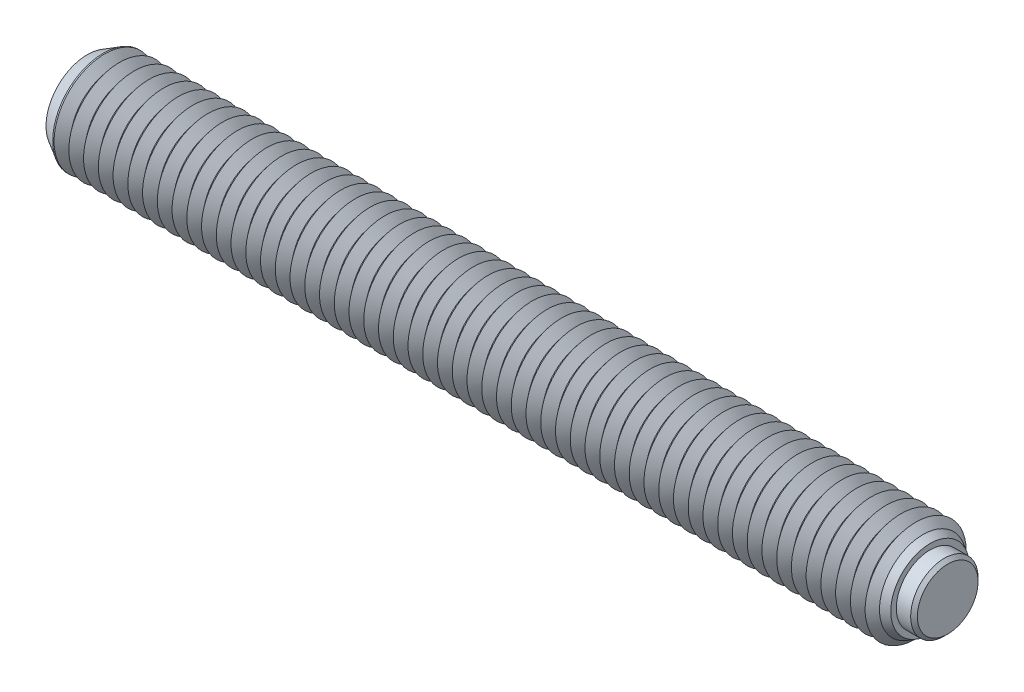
ISO-10303-21;
HEADER;
FILE_DESCRIPTION(('STEP AP214'),'2;1');
FILE_NAME('part.step','',(''),(''),'','','');
FILE_SCHEMA(('AUTOMOTIVE_DESIGN { 1 0 10303 214 1 1 1 1 }'));
ENDSEC;
DATA;
#1=APPLICATION_CONTEXT('core data for automotive mechanical design processes');
#2=APPLICATION_PROTOCOL_DEFINITION('international standard','automotive_design',2000,#1);
#3=PRODUCT_CONTEXT('',#1,'mechanical');
#4=PRODUCT('Part','Part','',(#3));
#5=PRODUCT_RELATED_PRODUCT_CATEGORY('part','',(#4));
#6=PRODUCT_DEFINITION_FORMATION('','',#4);
#7=PRODUCT_DEFINITION_CONTEXT('part definition',#1,'design');
#8=PRODUCT_DEFINITION('design','',#6,#7);
#9=PRODUCT_DEFINITION_SHAPE('','',#8);
#10=(LENGTH_UNIT() NAMED_UNIT(*) SI_UNIT(.MILLI.,.METRE.));
#11=(NAMED_UNIT(*) PLANE_ANGLE_UNIT() SI_UNIT($,.RADIAN.));
#12=(NAMED_UNIT(*) SI_UNIT($,.STERADIAN.) SOLID_ANGLE_UNIT());
#13=UNCERTAINTY_MEASURE_WITH_UNIT(LENGTH_MEASURE(1.E-05),#10,'distance_accuracy_value','');
#14=(GEOMETRIC_REPRESENTATION_CONTEXT(3) GLOBAL_UNCERTAINTY_ASSIGNED_CONTEXT((#13)) GLOBAL_UNIT_ASSIGNED_CONTEXT((#10,
#11,#12)) REPRESENTATION_CONTEXT('',''));
#15=CARTESIAN_POINT('',(0.,0.,0.));
#16=DIRECTION('',(0.,0.,1.));
#17=DIRECTION('',(1.,0.,0.));
#18=AXIS2_PLACEMENT_3D('',#15,#16,#17);
#19=CARTESIAN_POINT('',(2.95,0.,0.));
#20=DIRECTION('',(-1.,0.,0.));
#21=DIRECTION('',(0.,0.,1.));
#22=AXIS2_PLACEMENT_3D('',#19,#20,#21);
#23=CYLINDRICAL_SURFACE('',#22,4.);
#24=CARTESIAN_POINT('',(2.55,0.,0.));
#25=DIRECTION('',(1.,0.,0.));
#26=DIRECTION('',(0.,0.,-1.));
#27=AXIS2_PLACEMENT_3D('',#24,#25,#26);
#28=CIRCLE('',#27,4.);
#29=CARTESIAN_POINT('',(2.55,0.,4.));
#30=VERTEX_POINT('',#29);
#31=EDGE_CURVE('P0_E10',#30,#30,#28,.F.);
#32=ORIENTED_EDGE('',*,*,#31,.T.);
#33=EDGE_LOOP('',(#32));
#34=FACE_BOUND('',#33,.T.);
#35=CARTESIAN_POINT('',(-1.25,0.,0.));
#36=DIRECTION('',(1.,0.,0.));
#37=DIRECTION('',(0.,0.,-1.));
#38=AXIS2_PLACEMENT_3D('',#35,#36,#37);
#39=CIRCLE('',#38,4.);
#40=CARTESIAN_POINT('',(-1.25,0.,-4.));
#41=VERTEX_POINT('',#40);
#42=EDGE_CURVE('P0_E25',#41,#41,#39,.T.);
#43=ORIENTED_EDGE('',*,*,#42,.T.);
#44=EDGE_LOOP('',(#43));
#45=FACE_BOUND('',#44,.T.);
#46=ADVANCED_FACE('P0_F14',(#34,#45),#23,.T.);
#47=CARTESIAN_POINT('',(2.95,0.,0.));
#48=DIRECTION('',(1.,0.,0.));
#49=DIRECTION('',(0.,0.,-1.));
#50=AXIS2_PLACEMENT_3D('',#47,#48,#49);
#51=PLANE('',#50);
#52=CARTESIAN_POINT('',(2.95,0.,0.));
#53=DIRECTION('',(1.,0.,0.));
#54=DIRECTION('',(0.,0.,-1.));
#55=AXIS2_PLACEMENT_3D('',#52,#53,#54);
#56=CIRCLE('',#55,3.6);
#57=CARTESIAN_POINT('',(2.95,0.,3.6));
#58=VERTEX_POINT('',#57);
#59=EDGE_CURVE('P0_E21',#58,#58,#56,.T.);
#60=ORIENTED_EDGE('',*,*,#59,.T.);
#61=EDGE_LOOP('',(#60));
#62=FACE_BOUND('',#61,.T.);
#63=ADVANCED_FACE('P0_F35',(#62),#51,.T.);
#64=CARTESIAN_POINT('',(-1.25,0.,0.));
#65=DIRECTION('',(1.,0.,0.));
#66=DIRECTION('',(0.,0.,-1.));
#67=AXIS2_PLACEMENT_3D('',#64,#65,#66);
#68=PLANE('',#67);
#69=ORIENTED_EDGE('',*,*,#42,.F.);
#70=EDGE_LOOP('',(#69));
#71=FACE_BOUND('',#70,.T.);
#72=ADVANCED_FACE('P0_F33',(#71),#68,.F.);
#73=CARTESIAN_POINT('',(2.95,0.,0.));
#74=DIRECTION('',(-1.,0.,0.));
#75=DIRECTION('',(0.,0.,1.));
#76=AXIS2_PLACEMENT_3D('',#73,#74,#75);
#77=CONICAL_SURFACE('',#76,3.6,0.785398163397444);
#78=CARTESIAN_POINT('',(2.55,0.,4.));
#79=CARTESIAN_POINT('',(2.55416666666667,0.,3.99583333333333));
#80=CARTESIAN_POINT('',(2.55833333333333,0.,3.99166666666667));
#81=CARTESIAN_POINT('',(2.56666666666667,0.,3.98333333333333));
#82=CARTESIAN_POINT('',(2.57083333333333,0.,3.97916666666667));
#83=CARTESIAN_POINT('',(2.57916666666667,0.,3.97083333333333));
#84=CARTESIAN_POINT('',(2.58333333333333,0.,3.96666666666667));
#85=CARTESIAN_POINT('',(2.59166666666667,0.,3.95833333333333));
#86=CARTESIAN_POINT('',(2.59583333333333,0.,3.95416666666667));
#87=CARTESIAN_POINT('',(2.60416666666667,0.,3.94583333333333));
#88=CARTESIAN_POINT('',(2.60833333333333,0.,3.94166666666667));
#89=CARTESIAN_POINT('',(2.61666666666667,0.,3.93333333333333));
#90=CARTESIAN_POINT('',(2.62083333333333,0.,3.92916666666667));
#91=CARTESIAN_POINT('',(2.62916666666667,0.,3.92083333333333));
#92=CARTESIAN_POINT('',(2.63333333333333,0.,3.91666666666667));
#93=CARTESIAN_POINT('',(2.64166666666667,0.,3.90833333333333));
#94=CARTESIAN_POINT('',(2.64583333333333,0.,3.90416666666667));
#95=CARTESIAN_POINT('',(2.65416666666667,0.,3.89583333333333));
#96=CARTESIAN_POINT('',(2.65833333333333,0.,3.89166666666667));
#97=CARTESIAN_POINT('',(2.66666666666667,0.,3.88333333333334));
#98=CARTESIAN_POINT('',(2.67083333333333,0.,3.87916666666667));
#99=CARTESIAN_POINT('',(2.67916666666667,0.,3.87083333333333));
#100=CARTESIAN_POINT('',(2.68333333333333,0.,3.86666666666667));
#101=CARTESIAN_POINT('',(2.69166666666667,0.,3.85833333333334));
#102=CARTESIAN_POINT('',(2.69583333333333,0.,3.85416666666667));
#103=CARTESIAN_POINT('',(2.70416666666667,0.,3.84583333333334));
#104=CARTESIAN_POINT('',(2.70833333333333,0.,3.84166666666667));
#105=CARTESIAN_POINT('',(2.71666666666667,0.,3.83333333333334));
#106=CARTESIAN_POINT('',(2.72083333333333,0.,3.82916666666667));
#107=CARTESIAN_POINT('',(2.72916666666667,0.,3.82083333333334));
#108=CARTESIAN_POINT('',(2.73333333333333,0.,3.81666666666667));
#109=CARTESIAN_POINT('',(2.74166666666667,0.,3.80833333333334));
#110=CARTESIAN_POINT('',(2.74583333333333,0.,3.80416666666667));
#111=CARTESIAN_POINT('',(2.75416666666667,0.,3.79583333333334));
#112=CARTESIAN_POINT('',(2.75833333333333,0.,3.79166666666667));
#113=CARTESIAN_POINT('',(2.76666666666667,0.,3.78333333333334));
#114=CARTESIAN_POINT('',(2.77083333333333,0.,3.77916666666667));
#115=CARTESIAN_POINT('',(2.77916666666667,0.,3.77083333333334));
#116=CARTESIAN_POINT('',(2.78333333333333,0.,3.76666666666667));
#117=CARTESIAN_POINT('',(2.79166666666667,0.,3.75833333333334));
#118=CARTESIAN_POINT('',(2.79583333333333,0.,3.75416666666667));
#119=CARTESIAN_POINT('',(2.80416666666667,0.,3.74583333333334));
#120=CARTESIAN_POINT('',(2.80833333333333,0.,3.74166666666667));
#121=CARTESIAN_POINT('',(2.81666666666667,0.,3.73333333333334));
#122=CARTESIAN_POINT('',(2.82083333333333,0.,3.72916666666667));
#123=CARTESIAN_POINT('',(2.82916666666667,0.,3.72083333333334));
#124=CARTESIAN_POINT('',(2.83333333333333,0.,3.71666666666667));
#125=CARTESIAN_POINT('',(2.84166666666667,0.,3.70833333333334));
#126=CARTESIAN_POINT('',(2.84583333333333,0.,3.70416666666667));
#127=CARTESIAN_POINT('',(2.85416666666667,0.,3.69583333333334));
#128=CARTESIAN_POINT('',(2.85833333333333,0.,3.69166666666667));
#129=CARTESIAN_POINT('',(2.86666666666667,0.,3.68333333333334));
#130=CARTESIAN_POINT('',(2.87083333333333,0.,3.67916666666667));
#131=CARTESIAN_POINT('',(2.87916666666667,0.,3.67083333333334));
#132=CARTESIAN_POINT('',(2.88333333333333,0.,3.66666666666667));
#133=CARTESIAN_POINT('',(2.89166666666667,0.,3.65833333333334));
#134=CARTESIAN_POINT('',(2.89583333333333,0.,3.65416666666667));
#135=CARTESIAN_POINT('',(2.90416666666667,0.,3.64583333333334));
#136=CARTESIAN_POINT('',(2.90833333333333,0.,3.64166666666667));
#137=CARTESIAN_POINT('',(2.91666666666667,0.,3.63333333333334));
#138=CARTESIAN_POINT('',(2.92083333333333,0.,3.62916666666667));
#139=CARTESIAN_POINT('',(2.92916666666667,0.,3.62083333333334));
#140=CARTESIAN_POINT('',(2.93333333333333,0.,3.61666666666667));
#141=CARTESIAN_POINT('',(2.94166666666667,0.,3.60833333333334));
#142=CARTESIAN_POINT('',(2.94583333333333,0.,3.60416666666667));
#143=CARTESIAN_POINT('',(2.95,0.,3.6));
#144=B_SPLINE_CURVE_WITH_KNOTS('',3,(#78,#79,#80,#81,#82,#83,#84,#85,#86,#87,#88,#89,#90,#91,
#92,#93,#94,#95,#96,#97,#98,#99,#100,#101,#102,#103,#104,#105,#106,#107,#108,#109,#110,#111,
#112,#113,#114,#115,#116,#117,#118,#119,#120,#121,#122,#123,#124,#125,#126,#127,#128,#129,#130,
#131,#132,#133,#134,#135,#136,#137,#138,#139,#140,#141,#142,#143),.UNSPECIFIED.,.F.,.F.,(4,2,2,
2,2,2,2,2,2,2,2,2,2,2,2,2,2,2,2,2,2,2,2,2,2,2,2,2,2,2,2,2,4),(0.,0.0176776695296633,
0.0353553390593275,0.0530330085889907,0.070710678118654,0.0883883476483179,0.106066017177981,
0.123743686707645,0.141421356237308,0.159099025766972,0.176776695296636,0.194454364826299,
0.212132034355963,0.229809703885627,0.24748737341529,0.265165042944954,0.282842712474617,
0.300520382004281,0.318198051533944,0.335875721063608,0.353553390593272,0.371231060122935,
0.388908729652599,0.406586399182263,0.424264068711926,0.44194173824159,0.459619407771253,
0.477297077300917,0.49497474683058,0.512652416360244,0.530330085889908,0.548007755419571,
0.565685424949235),.UNSPECIFIED.);
#145=EDGE_CURVE('P0_BSEAM16',#30,#58,#144,.T.);
#146=ORIENTED_EDGE('',*,*,#31,.F.);
#147=ORIENTED_EDGE('',*,*,#59,.F.);
#148=ORIENTED_EDGE('',*,*,#145,.T.);
#149=ORIENTED_EDGE('',*,*,#145,.F.);
#150=EDGE_LOOP('',(#146,#148,#147,#149));
#151=FACE_BOUND('',#150,.T.);
#152=ADVANCED_FACE('P0_F16',(#151),#77,.T.);
#153=CLOSED_SHELL('',(#46,#63,#72,#152));
#154=MANIFOLD_SOLID_BREP('P0_B1',#153);
#155=CARTESIAN_POINT('',(-99.15,0.,0.));
#156=DIRECTION('',(1.,0.,0.));
#157=DIRECTION('',(0.,0.,-1.));
#158=AXIS2_PLACEMENT_3D('',#155,#156,#157);
#159=CYLINDRICAL_SURFACE('',#158,6.);
#160=CARTESIAN_POINT('',(-97.1,0.,0.));
#161=DIRECTION('',(1.,0.,0.));
#162=DIRECTION('',(0.,0.,-1.));
#163=AXIS2_PLACEMENT_3D('',#160,#161,#162);
#164=CIRCLE('',#163,6.);
#165=CARTESIAN_POINT('',(-97.1,0.,-6.));
#166=VERTEX_POINT('',#165);
#167=EDGE_CURVE('P1_E226',#166,#166,#164,.T.);
#168=CARTESIAN_POINT('',(-97.2570855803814,0.,0.));
#169=DIRECTION('',(1.,0.,0.));
#170=DIRECTION('',(0.,0.,-1.));
#171=AXIS2_PLACEMENT_3D('',#168,#169,#170);
#172=CIRCLE('',#171,6.);
#173=CARTESIAN_POINT('',(-97.2570855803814,0.,-6.));
#174=VERTEX_POINT('',#173);
#175=EDGE_CURVE('P1_E229',#174,#174,#172,.T.);
#176=CARTESIAN_POINT('',(-97.1,0.,-6.));
#177=CARTESIAN_POINT('',(-97.101636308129,0.,-6.));
#178=CARTESIAN_POINT('',(-97.103272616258,0.,-6.));
#179=CARTESIAN_POINT('',(-97.1065452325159,0.,-6.));
#180=CARTESIAN_POINT('',(-97.1081815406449,0.,-6.));
#181=CARTESIAN_POINT('',(-97.1114541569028,0.,-6.));
#182=CARTESIAN_POINT('',(-97.1130904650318,0.,-6.));
#183=CARTESIAN_POINT('',(-97.1163630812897,0.,-6.));
#184=CARTESIAN_POINT('',(-97.1179993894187,0.,-6.));
#185=CARTESIAN_POINT('',(-97.1212720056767,0.,-6.));
#186=CARTESIAN_POINT('',(-97.1229083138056,0.,-6.));
#187=CARTESIAN_POINT('',(-97.1261809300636,0.,-6.));
#188=CARTESIAN_POINT('',(-97.1278172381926,0.,-6.));
#189=CARTESIAN_POINT('',(-97.1310898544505,0.,-6.));
#190=CARTESIAN_POINT('',(-97.1327261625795,0.,-6.));
#191=CARTESIAN_POINT('',(-97.1359987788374,0.,-6.));
#192=CARTESIAN_POINT('',(-97.1376350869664,0.,-6.));
#193=CARTESIAN_POINT('',(-97.1409077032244,0.,-6.));
#194=CARTESIAN_POINT('',(-97.1425440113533,0.,-6.));
#195=CARTESIAN_POINT('',(-97.1458166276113,0.,-6.));
#196=CARTESIAN_POINT('',(-97.1474529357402,0.,-6.));
#197=CARTESIAN_POINT('',(-97.1507255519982,0.,-6.));
#198=CARTESIAN_POINT('',(-97.1523618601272,0.,-6.));
#199=CARTESIAN_POINT('',(-97.1556344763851,0.,-6.));
#200=CARTESIAN_POINT('',(-97.1572707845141,0.,-6.));
#201=CARTESIAN_POINT('',(-97.160543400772,0.,-6.));
#202=CARTESIAN_POINT('',(-97.162179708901,0.,-6.));
#203=CARTESIAN_POINT('',(-97.1654523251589,0.,-6.));
#204=CARTESIAN_POINT('',(-97.1670886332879,0.,-6.));
#205=CARTESIAN_POINT('',(-97.1703612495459,0.,-6.));
#206=CARTESIAN_POINT('',(-97.1719975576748,0.,-6.));
#207=CARTESIAN_POINT('',(-97.1752701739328,0.,-6.));
#208=CARTESIAN_POINT('',(-97.1769064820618,0.,-6.));
#209=CARTESIAN_POINT('',(-97.1801790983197,0.,-6.));
#210=CARTESIAN_POINT('',(-97.1818154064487,0.,-6.));
#211=CARTESIAN_POINT('',(-97.1850880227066,0.,-6.));
#212=CARTESIAN_POINT('',(-97.1867243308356,0.,-6.));
#213=CARTESIAN_POINT('',(-97.1899969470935,0.,-6.));
#214=CARTESIAN_POINT('',(-97.1916332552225,0.,-6.));
#215=CARTESIAN_POINT('',(-97.1949058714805,0.,-6.));
#216=CARTESIAN_POINT('',(-97.1965421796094,0.,-6.));
#217=CARTESIAN_POINT('',(-97.1998147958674,0.,-6.));
#218=CARTESIAN_POINT('',(-97.2014511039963,0.,-6.));
#219=CARTESIAN_POINT('',(-97.2047237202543,0.,-6.));
#220=CARTESIAN_POINT('',(-97.2063600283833,0.,-6.));
#221=CARTESIAN_POINT('',(-97.2096326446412,0.,-6.));
#222=CARTESIAN_POINT('',(-97.2112689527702,0.,-6.));
#223=CARTESIAN_POINT('',(-97.2145415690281,0.,-6.));
#224=CARTESIAN_POINT('',(-97.2161778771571,0.,-6.));
#225=CARTESIAN_POINT('',(-97.219450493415,0.,-6.));
#226=CARTESIAN_POINT('',(-97.221086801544,0.,-6.));
#227=CARTESIAN_POINT('',(-97.224359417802,0.,-6.));
#228=CARTESIAN_POINT('',(-97.2259957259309,0.,-6.));
#229=CARTESIAN_POINT('',(-97.2292683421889,0.,-6.));
#230=CARTESIAN_POINT('',(-97.2309046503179,0.,-6.));
#231=CARTESIAN_POINT('',(-97.2341772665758,0.,-6.));
#232=CARTESIAN_POINT('',(-97.2358135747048,0.,-6.));
#233=CARTESIAN_POINT('',(-97.2390861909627,0.,-6.));
#234=CARTESIAN_POINT('',(-97.2407224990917,0.,-6.));
#235=CARTESIAN_POINT('',(-97.2439951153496,0.,-6.));
#236=CARTESIAN_POINT('',(-97.2456314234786,0.,-6.));
#237=CARTESIAN_POINT('',(-97.2489040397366,0.,-6.));
#238=CARTESIAN_POINT('',(-97.2505403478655,0.,-6.));
#239=CARTESIAN_POINT('',(-97.2538129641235,0.,-6.));
#240=CARTESIAN_POINT('',(-97.2554492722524,0.,-6.));
#241=CARTESIAN_POINT('',(-97.2570855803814,0.,-6.));
#242=B_SPLINE_CURVE_WITH_KNOTS('',3,(#176,#177,#178,#179,#180,#181,#182,#183,#184,#185,#186,
#187,#188,#189,#190,#191,#192,#193,#194,#195,#196,#197,#198,#199,#200,#201,#202,#203,#204,#205,
#206,#207,#208,#209,#210,#211,#212,#213,#214,#215,#216,#217,#218,#219,#220,#221,#222,#223,#224,
#225,#226,#227,#228,#229,#230,#231,#232,#233,#234,#235,#236,#237,#238,#239,#240,#241),
.UNSPECIFIED.,.F.,.F.,(4,2,2,2,2,2,2,2,2,2,2,2,2,2,2,2,2,2,2,2,2,2,2,2,2,2,2,2,2,2,2,2,4),(0.,
0.00490892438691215,0.0098178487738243,0.0147267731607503,0.0196356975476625,0.0245446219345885,
0.0294535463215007,0.0343624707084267,0.0392713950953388,0.0441803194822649,0.049089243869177,
0.053998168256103,0.0589070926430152,0.0638160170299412,0.0687249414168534,0.0736338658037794,
0.0785427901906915,0.0834517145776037,0.0883606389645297,0.0932695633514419,0.0981784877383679,
0.10308741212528,0.107996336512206,0.112905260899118,0.117814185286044,0.122723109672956,
0.127632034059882,0.132540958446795,0.137449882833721,0.142358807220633,0.147267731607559,
0.152176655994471,0.157085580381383),.UNSPECIFIED.);
#243=EDGE_CURVE('P1_BSEAM15',#166,#174,#242,.T.);
#244=ORIENTED_EDGE('',*,*,#167,.F.);
#245=ORIENTED_EDGE('',*,*,#175,.T.);
#246=ORIENTED_EDGE('',*,*,#243,.T.);
#247=ORIENTED_EDGE('',*,*,#243,.F.);
#248=EDGE_LOOP('',(#244,#246,#245,#247));
#249=FACE_BOUND('',#248,.T.);
#250=ADVANCED_FACE('P1_F15',(#249),#159,.T.);
#251=CARTESIAN_POINT('',(-1.72500000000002,0.,0.));
#252=DIRECTION('',(1.,0.,0.));
#253=DIRECTION('',(0.,0.,-1.));
#254=AXIS2_PLACEMENT_3D('',#251,#252,#253);
#255=CONICAL_SURFACE('',#254,4.90712535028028,0.895664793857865);
#256=CARTESIAN_POINT('',(-0.850000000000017,0.,0.));
#257=DIRECTION('',(1.,0.,0.));
#258=DIRECTION('',(0.,0.,-1.));
#259=AXIS2_PLACEMENT_3D('',#256,#257,#258);
#260=CIRCLE('',#259,6.);
#261=CARTESIAN_POINT('',(-0.850000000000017,0.,-6.));
#262=VERTEX_POINT('',#261);
#263=EDGE_CURVE('P1_E284',#262,#262,#260,.T.);
#264=ORIENTED_EDGE('',*,*,#263,.F.);
#265=EDGE_LOOP('',(#264));
#266=FACE_BOUND('',#265,.T.);
#267=CARTESIAN_POINT('',(-1.72500000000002,0.,0.));
#268=DIRECTION('',(1.,0.,0.));
#269=DIRECTION('',(0.,0.,-1.));
#270=AXIS2_PLACEMENT_3D('',#267,#268,#269);
#271=CIRCLE('',#270,4.90712535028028);
#272=CARTESIAN_POINT('',(-1.72500000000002,0.,-4.90712535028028));
#273=VERTEX_POINT('',#272);
#274=EDGE_CURVE('P1_E289',#273,#273,#271,.T.);
#275=ORIENTED_EDGE('',*,*,#274,.T.);
#276=EDGE_LOOP('',(#275));
#277=FACE_BOUND('',#276,.T.);
#278=ADVANCED_FACE('P1_F214',(#266,#277),#255,.T.);
#279=CARTESIAN_POINT('',(-2.60000000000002,0.,0.));
#280=DIRECTION('',(-1.,0.,0.));
#281=DIRECTION('',(0.,0.,1.));
#282=AXIS2_PLACEMENT_3D('',#279,#280,#281);
#283=CONICAL_SURFACE('',#282,6.,0.895664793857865);
#284=ORIENTED_EDGE('',*,*,#274,.F.);
#285=EDGE_LOOP('',(#284));
#286=FACE_BOUND('',#285,.T.);
#287=CARTESIAN_POINT('',(-2.60000000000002,0.,0.));
#288=DIRECTION('',(1.,0.,0.));
#289=DIRECTION('',(0.,0.,-1.));
#290=AXIS2_PLACEMENT_3D('',#287,#288,#289);
#291=CIRCLE('',#290,6.);
#292=CARTESIAN_POINT('',(-2.60000000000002,0.,-6.));
#293=VERTEX_POINT('',#292);
#294=EDGE_CURVE('P1_E292',#293,#293,#291,.T.);
#295=ORIENTED_EDGE('',*,*,#294,.T.);
#296=EDGE_LOOP('',(#295));
#297=FACE_BOUND('',#296,.T.);
#298=ADVANCED_FACE('P1_F220',(#286,#297),#283,.T.);
#299=CARTESIAN_POINT('',(-1.25,0.,0.));
#300=DIRECTION('',(1.,0.,0.));
#301=DIRECTION('',(0.,1.,0.));
#302=AXIS2_PLACEMENT_3D('',#299,#300,#301);
#303=PLANE('',#302);
#304=CARTESIAN_POINT('',(-1.25,0.,0.));
#305=DIRECTION('',(1.,0.,0.));
#306=DIRECTION('',(0.,1.,0.));
#307=AXIS2_PLACEMENT_3D('',#304,#305,#306);
#308=CIRCLE('',#307,4.);
#309=CARTESIAN_POINT('',(-1.25,4.,0.));
#310=VERTEX_POINT('',#309);
#311=EDGE_CURVE('P1_E279',#310,#310,#308,.T.);
#312=ORIENTED_EDGE('',*,*,#311,.T.);
#313=EDGE_LOOP('',(#312));
#314=FACE_BOUND('',#313,.T.);
#315=ADVANCED_FACE('P1_F1053',(#314),#303,.T.);
#316=CARTESIAN_POINT('',(-1.25,0.,0.));
#317=DIRECTION('',(1.,0.,0.));
#318=DIRECTION('',(0.,1.,0.));
#319=AXIS2_PLACEMENT_3D('',#316,#317,#318);
#320=CYLINDRICAL_SURFACE('',#319,4.);
#321=ORIENTED_EDGE('',*,*,#311,.F.);
#322=EDGE_LOOP('',(#321));
#323=FACE_BOUND('',#322,.T.);
#324=CARTESIAN_POINT('',(0.85,0.,0.));
#325=DIRECTION('',(1.,0.,0.));
#326=DIRECTION('',(0.,1.,0.));
#327=AXIS2_PLACEMENT_3D('',#324,#325,#326);
#328=CIRCLE('',#327,4.);
#329=CARTESIAN_POINT('',(0.85,4.,0.));
#330=VERTEX_POINT('',#329);
#331=EDGE_CURVE('P1_E281',#330,#330,#328,.T.);
#332=ORIENTED_EDGE('',*,*,#331,.T.);
#333=EDGE_LOOP('',(#332));
#334=FACE_BOUND('',#333,.T.);
#335=ADVANCED_FACE('P1_F210',(#323,#334),#320,.F.);
#336=CARTESIAN_POINT('',(0.849999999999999,4.65925227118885,0.));
#337=DIRECTION('',(1.,0.,0.));
#338=DIRECTION('',(0.,1.,0.));
#339=AXIS2_PLACEMENT_3D('',#336,#337,#338);
#340=PLANE('',#339);
#341=ORIENTED_EDGE('',*,*,#331,.F.);
#342=EDGE_LOOP('',(#341));
#343=FACE_BOUND('',#342,.T.);
#344=CARTESIAN_POINT('',(0.85,0.,0.));
#345=DIRECTION('',(1.,0.,0.));
#346=DIRECTION('',(0.,1.,0.));
#347=AXIS2_PLACEMENT_3D('',#344,#345,#346);
#348=CIRCLE('',#347,4.65925227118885);
#349=CARTESIAN_POINT('',(0.849999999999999,4.65925227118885,0.));
#350=VERTEX_POINT('',#349);
#351=EDGE_CURVE('P1_E121',#350,#350,#348,.T.);
#352=ORIENTED_EDGE('',*,*,#351,.T.);
#353=EDGE_LOOP('',(#352));
#354=FACE_BOUND('',#353,.T.);
#355=ADVANCED_FACE('P1_F206',(#343,#354),#340,.T.);
#356=CARTESIAN_POINT('',(0.85,0.,0.));
#357=DIRECTION('',(-1.,0.,0.));
#358=DIRECTION('',(0.,-1.,0.));
#359=AXIS2_PLACEMENT_3D('',#356,#357,#358);
#360=CONICAL_SURFACE('',#359,4.65925227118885,0.523598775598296);
#361=CARTESIAN_POINT('',(0.,0.,0.));
#362=DIRECTION('',(1.,0.,0.));
#363=DIRECTION('',(0.,0.,-1.));
#364=AXIS2_PLACEMENT_3D('',#361,#362,#363);
#365=CIRCLE('',#364,5.15000000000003);
#366=CARTESIAN_POINT('',(0.,0.,-5.15000000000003));
#367=VERTEX_POINT('',#366);
#368=EDGE_CURVE('P1_E236',#367,#367,#365,.T.);
#369=ORIENTED_EDGE('',*,*,#368,.T.);
#370=EDGE_LOOP('',(#369));
#371=FACE_BOUND('',#370,.T.);
#372=ORIENTED_EDGE('',*,*,#351,.F.);
#373=EDGE_LOOP('',(#372));
#374=FACE_BOUND('',#373,.T.);
#375=ADVANCED_FACE('P1_F203',(#371,#374),#360,.T.);
#376=CARTESIAN_POINT('',(0.,0.,0.));
#377=DIRECTION('',(-1.,0.,0.));
#378=DIRECTION('',(0.,0.,1.));
#379=AXIS2_PLACEMENT_3D('',#376,#377,#378);
#380=CONICAL_SURFACE('',#379,5.15000000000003,0.785398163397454);
#381=ORIENTED_EDGE('',*,*,#263,.T.);
#382=EDGE_LOOP('',(#381));
#383=FACE_BOUND('',#382,.T.);
#384=ORIENTED_EDGE('',*,*,#368,.F.);
#385=EDGE_LOOP('',(#384));
#386=FACE_BOUND('',#385,.T.);
#387=ADVANCED_FACE('P1_F17',(#383,#386),#380,.T.);
#388=CARTESIAN_POINT('',(-3.47500000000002,0.,0.));
#389=DIRECTION('',(1.,0.,0.));
#390=DIRECTION('',(0.,0.,-1.));
#391=AXIS2_PLACEMENT_3D('',#388,#389,#390);
#392=CONICAL_SURFACE('',#391,4.90712535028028,0.895664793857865);
#393=ORIENTED_EDGE('',*,*,#294,.F.);
#394=EDGE_LOOP('',(#393));
#395=FACE_BOUND('',#394,.T.);
#396=CARTESIAN_POINT('',(-3.47500000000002,0.,0.));
#397=DIRECTION('',(1.,0.,0.));
#398=DIRECTION('',(0.,0.,-1.));
#399=AXIS2_PLACEMENT_3D('',#396,#397,#398);
#400=CIRCLE('',#399,4.90712535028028);
#401=CARTESIAN_POINT('',(-3.47500000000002,0.,-4.90712535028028));
#402=VERTEX_POINT('',#401);
#403=EDGE_CURVE('P1_E295',#402,#402,#400,.T.);
#404=ORIENTED_EDGE('',*,*,#403,.T.);
#405=EDGE_LOOP('',(#404));
#406=FACE_BOUND('',#405,.T.);
#407=ADVANCED_FACE('P1_F1047',(#395,#406),#392,.T.);
#408=CARTESIAN_POINT('',(-4.35000000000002,0.,0.));
#409=DIRECTION('',(-1.,0.,0.));
#410=DIRECTION('',(0.,0.,1.));
#411=AXIS2_PLACEMENT_3D('',#408,#409,#410);
#412=CONICAL_SURFACE('',#411,6.,0.895664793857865);
#413=ORIENTED_EDGE('',*,*,#403,.F.);
#414=EDGE_LOOP('',(#413));
#415=FACE_BOUND('',#414,.T.);
#416=CARTESIAN_POINT('',(-4.35000000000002,0.,0.));
#417=DIRECTION('',(1.,0.,0.));
#418=DIRECTION('',(0.,0.,-1.));
#419=AXIS2_PLACEMENT_3D('',#416,#417,#418);
#420=CIRCLE('',#419,6.);
#421=CARTESIAN_POINT('',(-4.35000000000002,0.,-6.));
#422=VERTEX_POINT('',#421);
#423=EDGE_CURVE('P1_E298',#422,#422,#420,.T.);
#424=ORIENTED_EDGE('',*,*,#423,.T.);
#425=EDGE_LOOP('',(#424));
#426=FACE_BOUND('',#425,.T.);
#427=ADVANCED_FACE('P1_F1043',(#415,#426),#412,.T.);
#428=CARTESIAN_POINT('',(-5.22500000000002,0.,0.));
#429=DIRECTION('',(1.,0.,0.));
#430=DIRECTION('',(0.,0.,-1.));
#431=AXIS2_PLACEMENT_3D('',#428,#429,#430);
#432=CONICAL_SURFACE('',#431,4.90712535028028,0.895664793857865);
#433=ORIENTED_EDGE('',*,*,#423,.F.);
#434=EDGE_LOOP('',(#433));
#435=FACE_BOUND('',#434,.T.);
#436=CARTESIAN_POINT('',(-5.22500000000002,0.,0.));
#437=DIRECTION('',(1.,0.,0.));
#438=DIRECTION('',(0.,0.,-1.));
#439=AXIS2_PLACEMENT_3D('',#436,#437,#438);
#440=CIRCLE('',#439,4.90712535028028);
#441=CARTESIAN_POINT('',(-5.22500000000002,0.,-4.90712535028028));
#442=VERTEX_POINT('',#441);
#443=EDGE_CURVE('P1_E301',#442,#442,#440,.T.);
#444=ORIENTED_EDGE('',*,*,#443,.T.);
#445=EDGE_LOOP('',(#444));
#446=FACE_BOUND('',#445,.T.);
#447=ADVANCED_FACE('P1_F1039',(#435,#446),#432,.T.);
#448=CARTESIAN_POINT('',(-6.10000000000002,0.,0.));
#449=DIRECTION('',(-1.,0.,0.));
#450=DIRECTION('',(0.,0.,1.));
#451=AXIS2_PLACEMENT_3D('',#448,#449,#450);
#452=CONICAL_SURFACE('',#451,6.,0.895664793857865);
#453=ORIENTED_EDGE('',*,*,#443,.F.);
#454=EDGE_LOOP('',(#453));
#455=FACE_BOUND('',#454,.T.);
#456=CARTESIAN_POINT('',(-6.10000000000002,0.,0.));
#457=DIRECTION('',(1.,0.,0.));
#458=DIRECTION('',(0.,0.,-1.));
#459=AXIS2_PLACEMENT_3D('',#456,#457,#458);
#460=CIRCLE('',#459,6.);
#461=CARTESIAN_POINT('',(-6.10000000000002,0.,-6.));
#462=VERTEX_POINT('',#461);
#463=EDGE_CURVE('P1_E304',#462,#462,#460,.T.);
#464=ORIENTED_EDGE('',*,*,#463,.T.);
#465=EDGE_LOOP('',(#464));
#466=FACE_BOUND('',#465,.T.);
#467=ADVANCED_FACE('P1_F1035',(#455,#466),#452,.T.);
#468=CARTESIAN_POINT('',(-6.97500000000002,0.,0.));
#469=DIRECTION('',(1.,0.,0.));
#470=DIRECTION('',(0.,0.,-1.));
#471=AXIS2_PLACEMENT_3D('',#468,#469,#470);
#472=CONICAL_SURFACE('',#471,4.90712535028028,0.895664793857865);
#473=ORIENTED_EDGE('',*,*,#463,.F.);
#474=EDGE_LOOP('',(#473));
#475=FACE_BOUND('',#474,.T.);
#476=CARTESIAN_POINT('',(-6.97500000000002,0.,0.));
#477=DIRECTION('',(1.,0.,0.));
#478=DIRECTION('',(0.,0.,-1.));
#479=AXIS2_PLACEMENT_3D('',#476,#477,#478);
#480=CIRCLE('',#479,4.90712535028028);
#481=CARTESIAN_POINT('',(-6.97500000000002,0.,-4.90712535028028));
#482=VERTEX_POINT('',#481);
#483=EDGE_CURVE('P1_E307',#482,#482,#480,.T.);
#484=ORIENTED_EDGE('',*,*,#483,.T.);
#485=EDGE_LOOP('',(#484));
#486=FACE_BOUND('',#485,.T.);
#487=ADVANCED_FACE('P1_F1031',(#475,#486),#472,.T.);
#488=CARTESIAN_POINT('',(-7.85000000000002,0.,0.));
#489=DIRECTION('',(-1.,0.,0.));
#490=DIRECTION('',(0.,0.,1.));
#491=AXIS2_PLACEMENT_3D('',#488,#489,#490);
#492=CONICAL_SURFACE('',#491,6.,0.895664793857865);
#493=ORIENTED_EDGE('',*,*,#483,.F.);
#494=EDGE_LOOP('',(#493));
#495=FACE_BOUND('',#494,.T.);
#496=CARTESIAN_POINT('',(-7.85000000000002,0.,0.));
#497=DIRECTION('',(1.,0.,0.));
#498=DIRECTION('',(0.,0.,-1.));
#499=AXIS2_PLACEMENT_3D('',#496,#497,#498);
#500=CIRCLE('',#499,6.);
#501=CARTESIAN_POINT('',(-7.85000000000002,0.,-6.));
#502=VERTEX_POINT('',#501);
#503=EDGE_CURVE('P1_E310',#502,#502,#500,.T.);
#504=ORIENTED_EDGE('',*,*,#503,.T.);
#505=EDGE_LOOP('',(#504));
#506=FACE_BOUND('',#505,.T.);
#507=ADVANCED_FACE('P1_F1027',(#495,#506),#492,.T.);
#508=CARTESIAN_POINT('',(-8.72500000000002,0.,0.));
#509=DIRECTION('',(1.,0.,0.));
#510=DIRECTION('',(0.,0.,-1.));
#511=AXIS2_PLACEMENT_3D('',#508,#509,#510);
#512=CONICAL_SURFACE('',#511,4.90712535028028,0.895664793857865);
#513=ORIENTED_EDGE('',*,*,#503,.F.);
#514=EDGE_LOOP('',(#513));
#515=FACE_BOUND('',#514,.T.);
#516=CARTESIAN_POINT('',(-8.72500000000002,0.,0.));
#517=DIRECTION('',(1.,0.,0.));
#518=DIRECTION('',(0.,0.,-1.));
#519=AXIS2_PLACEMENT_3D('',#516,#517,#518);
#520=CIRCLE('',#519,4.90712535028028);
#521=CARTESIAN_POINT('',(-8.72500000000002,0.,-4.90712535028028));
#522=VERTEX_POINT('',#521);
#523=EDGE_CURVE('P1_E313',#522,#522,#520,.T.);
#524=ORIENTED_EDGE('',*,*,#523,.T.);
#525=EDGE_LOOP('',(#524));
#526=FACE_BOUND('',#525,.T.);
#527=ADVANCED_FACE('P1_F1023',(#515,#526),#512,.T.);
#528=CARTESIAN_POINT('',(-9.60000000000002,0.,0.));
#529=DIRECTION('',(-1.,0.,0.));
#530=DIRECTION('',(0.,0.,1.));
#531=AXIS2_PLACEMENT_3D('',#528,#529,#530);
#532=CONICAL_SURFACE('',#531,6.,0.895664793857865);
#533=ORIENTED_EDGE('',*,*,#523,.F.);
#534=EDGE_LOOP('',(#533));
#535=FACE_BOUND('',#534,.T.);
#536=CARTESIAN_POINT('',(-9.60000000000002,0.,0.));
#537=DIRECTION('',(1.,0.,0.));
#538=DIRECTION('',(0.,0.,-1.));
#539=AXIS2_PLACEMENT_3D('',#536,#537,#538);
#540=CIRCLE('',#539,6.);
#541=CARTESIAN_POINT('',(-9.60000000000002,0.,-6.));
#542=VERTEX_POINT('',#541);
#543=EDGE_CURVE('P1_E316',#542,#542,#540,.T.);
#544=ORIENTED_EDGE('',*,*,#543,.T.);
#545=EDGE_LOOP('',(#544));
#546=FACE_BOUND('',#545,.T.);
#547=ADVANCED_FACE('P1_F1019',(#535,#546),#532,.T.);
#548=CARTESIAN_POINT('',(-10.475,0.,0.));
#549=DIRECTION('',(1.,0.,0.));
#550=DIRECTION('',(0.,0.,-1.));
#551=AXIS2_PLACEMENT_3D('',#548,#549,#550);
#552=CONICAL_SURFACE('',#551,4.90712535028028,0.895664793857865);
#553=ORIENTED_EDGE('',*,*,#543,.F.);
#554=EDGE_LOOP('',(#553));
#555=FACE_BOUND('',#554,.T.);
#556=CARTESIAN_POINT('',(-10.475,0.,0.));
#557=DIRECTION('',(1.,0.,0.));
#558=DIRECTION('',(0.,0.,-1.));
#559=AXIS2_PLACEMENT_3D('',#556,#557,#558);
#560=CIRCLE('',#559,4.90712535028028);
#561=CARTESIAN_POINT('',(-10.475,0.,-4.90712535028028));
#562=VERTEX_POINT('',#561);
#563=EDGE_CURVE('P1_E319',#562,#562,#560,.T.);
#564=ORIENTED_EDGE('',*,*,#563,.T.);
#565=EDGE_LOOP('',(#564));
#566=FACE_BOUND('',#565,.T.);
#567=ADVANCED_FACE('P1_F1015',(#555,#566),#552,.T.);
#568=CARTESIAN_POINT('',(-11.35,0.,0.));
#569=DIRECTION('',(-1.,0.,0.));
#570=DIRECTION('',(0.,0.,1.));
#571=AXIS2_PLACEMENT_3D('',#568,#569,#570);
#572=CONICAL_SURFACE('',#571,6.,0.895664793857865);
#573=ORIENTED_EDGE('',*,*,#563,.F.);
#574=EDGE_LOOP('',(#573));
#575=FACE_BOUND('',#574,.T.);
#576=CARTESIAN_POINT('',(-11.35,0.,0.));
#577=DIRECTION('',(1.,0.,0.));
#578=DIRECTION('',(0.,0.,-1.));
#579=AXIS2_PLACEMENT_3D('',#576,#577,#578);
#580=CIRCLE('',#579,6.);
#581=CARTESIAN_POINT('',(-11.35,0.,-6.));
#582=VERTEX_POINT('',#581);
#583=EDGE_CURVE('P1_E322',#582,#582,#580,.T.);
#584=ORIENTED_EDGE('',*,*,#583,.T.);
#585=EDGE_LOOP('',(#584));
#586=FACE_BOUND('',#585,.T.);
#587=ADVANCED_FACE('P1_F1011',(#575,#586),#572,.T.);
#588=CARTESIAN_POINT('',(-12.225,0.,0.));
#589=DIRECTION('',(1.,0.,0.));
#590=DIRECTION('',(0.,0.,-1.));
#591=AXIS2_PLACEMENT_3D('',#588,#589,#590);
#592=CONICAL_SURFACE('',#591,4.90712535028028,0.895664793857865);
#593=ORIENTED_EDGE('',*,*,#583,.F.);
#594=EDGE_LOOP('',(#593));
#595=FACE_BOUND('',#594,.T.);
#596=CARTESIAN_POINT('',(-12.225,0.,0.));
#597=DIRECTION('',(1.,0.,0.));
#598=DIRECTION('',(0.,0.,-1.));
#599=AXIS2_PLACEMENT_3D('',#596,#597,#598);
#600=CIRCLE('',#599,4.90712535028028);
#601=CARTESIAN_POINT('',(-12.225,0.,-4.90712535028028));
#602=VERTEX_POINT('',#601);
#603=EDGE_CURVE('P1_E325',#602,#602,#600,.T.);
#604=ORIENTED_EDGE('',*,*,#603,.T.);
#605=EDGE_LOOP('',(#604));
#606=FACE_BOUND('',#605,.T.);
#607=ADVANCED_FACE('P1_F1007',(#595,#606),#592,.T.);
#608=CARTESIAN_POINT('',(-13.1,0.,0.));
#609=DIRECTION('',(-1.,0.,0.));
#610=DIRECTION('',(0.,0.,1.));
#611=AXIS2_PLACEMENT_3D('',#608,#609,#610);
#612=CONICAL_SURFACE('',#611,6.,0.895664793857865);
#613=ORIENTED_EDGE('',*,*,#603,.F.);
#614=EDGE_LOOP('',(#613));
#615=FACE_BOUND('',#614,.T.);
#616=CARTESIAN_POINT('',(-13.1,0.,0.));
#617=DIRECTION('',(1.,0.,0.));
#618=DIRECTION('',(0.,0.,-1.));
#619=AXIS2_PLACEMENT_3D('',#616,#617,#618);
#620=CIRCLE('',#619,6.);
#621=CARTESIAN_POINT('',(-13.1,0.,-6.));
#622=VERTEX_POINT('',#621);
#623=EDGE_CURVE('P1_E328',#622,#622,#620,.T.);
#624=ORIENTED_EDGE('',*,*,#623,.T.);
#625=EDGE_LOOP('',(#624));
#626=FACE_BOUND('',#625,.T.);
#627=ADVANCED_FACE('P1_F1003',(#615,#626),#612,.T.);
#628=CARTESIAN_POINT('',(-13.975,0.,0.));
#629=DIRECTION('',(1.,0.,0.));
#630=DIRECTION('',(0.,0.,-1.));
#631=AXIS2_PLACEMENT_3D('',#628,#629,#630);
#632=CONICAL_SURFACE('',#631,4.90712535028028,0.895664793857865);
#633=ORIENTED_EDGE('',*,*,#623,.F.);
#634=EDGE_LOOP('',(#633));
#635=FACE_BOUND('',#634,.T.);
#636=CARTESIAN_POINT('',(-13.975,0.,0.));
#637=DIRECTION('',(1.,0.,0.));
#638=DIRECTION('',(0.,0.,-1.));
#639=AXIS2_PLACEMENT_3D('',#636,#637,#638);
#640=CIRCLE('',#639,4.90712535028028);
#641=CARTESIAN_POINT('',(-13.975,0.,-4.90712535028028));
#642=VERTEX_POINT('',#641);
#643=EDGE_CURVE('P1_E331',#642,#642,#640,.T.);
#644=ORIENTED_EDGE('',*,*,#643,.T.);
#645=EDGE_LOOP('',(#644));
#646=FACE_BOUND('',#645,.T.);
#647=ADVANCED_FACE('P1_F999',(#635,#646),#632,.T.);
#648=CARTESIAN_POINT('',(-14.85,0.,0.));
#649=DIRECTION('',(-1.,0.,0.));
#650=DIRECTION('',(0.,0.,1.));
#651=AXIS2_PLACEMENT_3D('',#648,#649,#650);
#652=CONICAL_SURFACE('',#651,6.,0.895664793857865);
#653=ORIENTED_EDGE('',*,*,#643,.F.);
#654=EDGE_LOOP('',(#653));
#655=FACE_BOUND('',#654,.T.);
#656=CARTESIAN_POINT('',(-14.85,0.,0.));
#657=DIRECTION('',(1.,0.,0.));
#658=DIRECTION('',(0.,0.,-1.));
#659=AXIS2_PLACEMENT_3D('',#656,#657,#658);
#660=CIRCLE('',#659,6.);
#661=CARTESIAN_POINT('',(-14.85,0.,-6.));
#662=VERTEX_POINT('',#661);
#663=EDGE_CURVE('P1_E334',#662,#662,#660,.T.);
#664=ORIENTED_EDGE('',*,*,#663,.T.);
#665=EDGE_LOOP('',(#664));
#666=FACE_BOUND('',#665,.T.);
#667=ADVANCED_FACE('P1_F995',(#655,#666),#652,.T.);
#668=CARTESIAN_POINT('',(-15.725,0.,0.));
#669=DIRECTION('',(1.,0.,0.));
#670=DIRECTION('',(0.,0.,-1.));
#671=AXIS2_PLACEMENT_3D('',#668,#669,#670);
#672=CONICAL_SURFACE('',#671,4.90712535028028,0.895664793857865);
#673=ORIENTED_EDGE('',*,*,#663,.F.);
#674=EDGE_LOOP('',(#673));
#675=FACE_BOUND('',#674,.T.);
#676=CARTESIAN_POINT('',(-15.725,0.,0.));
#677=DIRECTION('',(1.,0.,0.));
#678=DIRECTION('',(0.,0.,-1.));
#679=AXIS2_PLACEMENT_3D('',#676,#677,#678);
#680=CIRCLE('',#679,4.90712535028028);
#681=CARTESIAN_POINT('',(-15.725,0.,-4.90712535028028));
#682=VERTEX_POINT('',#681);
#683=EDGE_CURVE('P1_E337',#682,#682,#680,.T.);
#684=ORIENTED_EDGE('',*,*,#683,.T.);
#685=EDGE_LOOP('',(#684));
#686=FACE_BOUND('',#685,.T.);
#687=ADVANCED_FACE('P1_F991',(#675,#686),#672,.T.);
#688=CARTESIAN_POINT('',(-16.6,0.,0.));
#689=DIRECTION('',(-1.,0.,0.));
#690=DIRECTION('',(0.,0.,1.));
#691=AXIS2_PLACEMENT_3D('',#688,#689,#690);
#692=CONICAL_SURFACE('',#691,6.,0.895664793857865);
#693=ORIENTED_EDGE('',*,*,#683,.F.);
#694=EDGE_LOOP('',(#693));
#695=FACE_BOUND('',#694,.T.);
#696=CARTESIAN_POINT('',(-16.6,0.,0.));
#697=DIRECTION('',(1.,0.,0.));
#698=DIRECTION('',(0.,0.,-1.));
#699=AXIS2_PLACEMENT_3D('',#696,#697,#698);
#700=CIRCLE('',#699,6.);
#701=CARTESIAN_POINT('',(-16.6,0.,-6.));
#702=VERTEX_POINT('',#701);
#703=EDGE_CURVE('P1_E340',#702,#702,#700,.T.);
#704=ORIENTED_EDGE('',*,*,#703,.T.);
#705=EDGE_LOOP('',(#704));
#706=FACE_BOUND('',#705,.T.);
#707=ADVANCED_FACE('P1_F987',(#695,#706),#692,.T.);
#708=CARTESIAN_POINT('',(-17.475,0.,0.));
#709=DIRECTION('',(1.,0.,0.));
#710=DIRECTION('',(0.,0.,-1.));
#711=AXIS2_PLACEMENT_3D('',#708,#709,#710);
#712=CONICAL_SURFACE('',#711,4.90712535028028,0.895664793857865);
#713=ORIENTED_EDGE('',*,*,#703,.F.);
#714=EDGE_LOOP('',(#713));
#715=FACE_BOUND('',#714,.T.);
#716=CARTESIAN_POINT('',(-17.475,0.,0.));
#717=DIRECTION('',(1.,0.,0.));
#718=DIRECTION('',(0.,0.,-1.));
#719=AXIS2_PLACEMENT_3D('',#716,#717,#718);
#720=CIRCLE('',#719,4.90712535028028);
#721=CARTESIAN_POINT('',(-17.475,0.,-4.90712535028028));
#722=VERTEX_POINT('',#721);
#723=EDGE_CURVE('P1_E343',#722,#722,#720,.T.);
#724=ORIENTED_EDGE('',*,*,#723,.T.);
#725=EDGE_LOOP('',(#724));
#726=FACE_BOUND('',#725,.T.);
#727=ADVANCED_FACE('P1_F983',(#715,#726),#712,.T.);
#728=CARTESIAN_POINT('',(-18.35,0.,0.));
#729=DIRECTION('',(-1.,0.,0.));
#730=DIRECTION('',(0.,0.,1.));
#731=AXIS2_PLACEMENT_3D('',#728,#729,#730);
#732=CONICAL_SURFACE('',#731,6.,0.895664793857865);
#733=ORIENTED_EDGE('',*,*,#723,.F.);
#734=EDGE_LOOP('',(#733));
#735=FACE_BOUND('',#734,.T.);
#736=CARTESIAN_POINT('',(-18.35,0.,0.));
#737=DIRECTION('',(1.,0.,0.));
#738=DIRECTION('',(0.,0.,-1.));
#739=AXIS2_PLACEMENT_3D('',#736,#737,#738);
#740=CIRCLE('',#739,6.);
#741=CARTESIAN_POINT('',(-18.35,0.,-6.));
#742=VERTEX_POINT('',#741);
#743=EDGE_CURVE('P1_E346',#742,#742,#740,.T.);
#744=ORIENTED_EDGE('',*,*,#743,.T.);
#745=EDGE_LOOP('',(#744));
#746=FACE_BOUND('',#745,.T.);
#747=ADVANCED_FACE('P1_F979',(#735,#746),#732,.T.);
#748=CARTESIAN_POINT('',(-19.225,0.,0.));
#749=DIRECTION('',(1.,0.,0.));
#750=DIRECTION('',(0.,0.,-1.));
#751=AXIS2_PLACEMENT_3D('',#748,#749,#750);
#752=CONICAL_SURFACE('',#751,4.90712535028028,0.895664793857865);
#753=ORIENTED_EDGE('',*,*,#743,.F.);
#754=EDGE_LOOP('',(#753));
#755=FACE_BOUND('',#754,.T.);
#756=CARTESIAN_POINT('',(-19.225,0.,0.));
#757=DIRECTION('',(1.,0.,0.));
#758=DIRECTION('',(0.,0.,-1.));
#759=AXIS2_PLACEMENT_3D('',#756,#757,#758);
#760=CIRCLE('',#759,4.90712535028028);
#761=CARTESIAN_POINT('',(-19.225,0.,-4.90712535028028));
#762=VERTEX_POINT('',#761);
#763=EDGE_CURVE('P1_E349',#762,#762,#760,.T.);
#764=ORIENTED_EDGE('',*,*,#763,.T.);
#765=EDGE_LOOP('',(#764));
#766=FACE_BOUND('',#765,.T.);
#767=ADVANCED_FACE('P1_F975',(#755,#766),#752,.T.);
#768=CARTESIAN_POINT('',(-20.1,0.,0.));
#769=DIRECTION('',(-1.,0.,0.));
#770=DIRECTION('',(0.,0.,1.));
#771=AXIS2_PLACEMENT_3D('',#768,#769,#770);
#772=CONICAL_SURFACE('',#771,6.,0.895664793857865);
#773=ORIENTED_EDGE('',*,*,#763,.F.);
#774=EDGE_LOOP('',(#773));
#775=FACE_BOUND('',#774,.T.);
#776=CARTESIAN_POINT('',(-20.1,0.,0.));
#777=DIRECTION('',(1.,0.,0.));
#778=DIRECTION('',(0.,0.,-1.));
#779=AXIS2_PLACEMENT_3D('',#776,#777,#778);
#780=CIRCLE('',#779,6.);
#781=CARTESIAN_POINT('',(-20.1,0.,-6.));
#782=VERTEX_POINT('',#781);
#783=EDGE_CURVE('P1_E352',#782,#782,#780,.T.);
#784=ORIENTED_EDGE('',*,*,#783,.T.);
#785=EDGE_LOOP('',(#784));
#786=FACE_BOUND('',#785,.T.);
#787=ADVANCED_FACE('P1_F971',(#775,#786),#772,.T.);
#788=CARTESIAN_POINT('',(-20.975,0.,0.));
#789=DIRECTION('',(1.,0.,0.));
#790=DIRECTION('',(0.,0.,-1.));
#791=AXIS2_PLACEMENT_3D('',#788,#789,#790);
#792=CONICAL_SURFACE('',#791,4.90712535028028,0.895664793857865);
#793=ORIENTED_EDGE('',*,*,#783,.F.);
#794=EDGE_LOOP('',(#793));
#795=FACE_BOUND('',#794,.T.);
#796=CARTESIAN_POINT('',(-20.975,0.,0.));
#797=DIRECTION('',(1.,0.,0.));
#798=DIRECTION('',(0.,0.,-1.));
#799=AXIS2_PLACEMENT_3D('',#796,#797,#798);
#800=CIRCLE('',#799,4.90712535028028);
#801=CARTESIAN_POINT('',(-20.975,0.,-4.90712535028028));
#802=VERTEX_POINT('',#801);
#803=EDGE_CURVE('P1_E355',#802,#802,#800,.T.);
#804=ORIENTED_EDGE('',*,*,#803,.T.);
#805=EDGE_LOOP('',(#804));
#806=FACE_BOUND('',#805,.T.);
#807=ADVANCED_FACE('P1_F967',(#795,#806),#792,.T.);
#808=CARTESIAN_POINT('',(-21.85,0.,0.));
#809=DIRECTION('',(-1.,0.,0.));
#810=DIRECTION('',(0.,0.,1.));
#811=AXIS2_PLACEMENT_3D('',#808,#809,#810);
#812=CONICAL_SURFACE('',#811,6.,0.895664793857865);
#813=ORIENTED_EDGE('',*,*,#803,.F.);
#814=EDGE_LOOP('',(#813));
#815=FACE_BOUND('',#814,.T.);
#816=CARTESIAN_POINT('',(-21.85,0.,0.));
#817=DIRECTION('',(1.,0.,0.));
#818=DIRECTION('',(0.,0.,-1.));
#819=AXIS2_PLACEMENT_3D('',#816,#817,#818);
#820=CIRCLE('',#819,6.);
#821=CARTESIAN_POINT('',(-21.85,0.,-6.));
#822=VERTEX_POINT('',#821);
#823=EDGE_CURVE('P1_E358',#822,#822,#820,.T.);
#824=ORIENTED_EDGE('',*,*,#823,.T.);
#825=EDGE_LOOP('',(#824));
#826=FACE_BOUND('',#825,.T.);
#827=ADVANCED_FACE('P1_F963',(#815,#826),#812,.T.);
#828=CARTESIAN_POINT('',(-22.725,0.,0.));
#829=DIRECTION('',(1.,0.,0.));
#830=DIRECTION('',(0.,0.,-1.));
#831=AXIS2_PLACEMENT_3D('',#828,#829,#830);
#832=CONICAL_SURFACE('',#831,4.90712535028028,0.895664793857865);
#833=ORIENTED_EDGE('',*,*,#823,.F.);
#834=EDGE_LOOP('',(#833));
#835=FACE_BOUND('',#834,.T.);
#836=CARTESIAN_POINT('',(-22.725,0.,0.));
#837=DIRECTION('',(1.,0.,0.));
#838=DIRECTION('',(0.,0.,-1.));
#839=AXIS2_PLACEMENT_3D('',#836,#837,#838);
#840=CIRCLE('',#839,4.90712535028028);
#841=CARTESIAN_POINT('',(-22.725,0.,-4.90712535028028));
#842=VERTEX_POINT('',#841);
#843=EDGE_CURVE('P1_E361',#842,#842,#840,.T.);
#844=ORIENTED_EDGE('',*,*,#843,.T.);
#845=EDGE_LOOP('',(#844));
#846=FACE_BOUND('',#845,.T.);
#847=ADVANCED_FACE('P1_F959',(#835,#846),#832,.T.);
#848=CARTESIAN_POINT('',(-23.6,0.,0.));
#849=DIRECTION('',(-1.,0.,0.));
#850=DIRECTION('',(0.,0.,1.));
#851=AXIS2_PLACEMENT_3D('',#848,#849,#850);
#852=CONICAL_SURFACE('',#851,6.,0.895664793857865);
#853=ORIENTED_EDGE('',*,*,#843,.F.);
#854=EDGE_LOOP('',(#853));
#855=FACE_BOUND('',#854,.T.);
#856=CARTESIAN_POINT('',(-23.6,0.,0.));
#857=DIRECTION('',(1.,0.,0.));
#858=DIRECTION('',(0.,0.,-1.));
#859=AXIS2_PLACEMENT_3D('',#856,#857,#858);
#860=CIRCLE('',#859,6.);
#861=CARTESIAN_POINT('',(-23.6,0.,-6.));
#862=VERTEX_POINT('',#861);
#863=EDGE_CURVE('P1_E364',#862,#862,#860,.T.);
#864=ORIENTED_EDGE('',*,*,#863,.T.);
#865=EDGE_LOOP('',(#864));
#866=FACE_BOUND('',#865,.T.);
#867=ADVANCED_FACE('P1_F955',(#855,#866),#852,.T.);
#868=CARTESIAN_POINT('',(-24.475,0.,0.));
#869=DIRECTION('',(1.,0.,0.));
#870=DIRECTION('',(0.,0.,-1.));
#871=AXIS2_PLACEMENT_3D('',#868,#869,#870);
#872=CONICAL_SURFACE('',#871,4.90712535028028,0.895664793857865);
#873=ORIENTED_EDGE('',*,*,#863,.F.);
#874=EDGE_LOOP('',(#873));
#875=FACE_BOUND('',#874,.T.);
#876=CARTESIAN_POINT('',(-24.475,0.,0.));
#877=DIRECTION('',(1.,0.,0.));
#878=DIRECTION('',(0.,0.,-1.));
#879=AXIS2_PLACEMENT_3D('',#876,#877,#878);
#880=CIRCLE('',#879,4.90712535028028);
#881=CARTESIAN_POINT('',(-24.475,0.,-4.90712535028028));
#882=VERTEX_POINT('',#881);
#883=EDGE_CURVE('P1_E367',#882,#882,#880,.T.);
#884=ORIENTED_EDGE('',*,*,#883,.T.);
#885=EDGE_LOOP('',(#884));
#886=FACE_BOUND('',#885,.T.);
#887=ADVANCED_FACE('P1_F951',(#875,#886),#872,.T.);
#888=CARTESIAN_POINT('',(-25.35,0.,0.));
#889=DIRECTION('',(-1.,0.,0.));
#890=DIRECTION('',(0.,0.,1.));
#891=AXIS2_PLACEMENT_3D('',#888,#889,#890);
#892=CONICAL_SURFACE('',#891,6.,0.895664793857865);
#893=ORIENTED_EDGE('',*,*,#883,.F.);
#894=EDGE_LOOP('',(#893));
#895=FACE_BOUND('',#894,.T.);
#896=CARTESIAN_POINT('',(-25.35,0.,0.));
#897=DIRECTION('',(1.,0.,0.));
#898=DIRECTION('',(0.,0.,-1.));
#899=AXIS2_PLACEMENT_3D('',#896,#897,#898);
#900=CIRCLE('',#899,6.);
#901=CARTESIAN_POINT('',(-25.35,0.,-6.));
#902=VERTEX_POINT('',#901);
#903=EDGE_CURVE('P1_E370',#902,#902,#900,.T.);
#904=ORIENTED_EDGE('',*,*,#903,.T.);
#905=EDGE_LOOP('',(#904));
#906=FACE_BOUND('',#905,.T.);
#907=ADVANCED_FACE('P1_F947',(#895,#906),#892,.T.);
#908=CARTESIAN_POINT('',(-26.225,0.,0.));
#909=DIRECTION('',(1.,0.,0.));
#910=DIRECTION('',(0.,0.,-1.));
#911=AXIS2_PLACEMENT_3D('',#908,#909,#910);
#912=CONICAL_SURFACE('',#911,4.90712535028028,0.895664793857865);
#913=ORIENTED_EDGE('',*,*,#903,.F.);
#914=EDGE_LOOP('',(#913));
#915=FACE_BOUND('',#914,.T.);
#916=CARTESIAN_POINT('',(-26.225,0.,0.));
#917=DIRECTION('',(1.,0.,0.));
#918=DIRECTION('',(0.,0.,-1.));
#919=AXIS2_PLACEMENT_3D('',#916,#917,#918);
#920=CIRCLE('',#919,4.90712535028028);
#921=CARTESIAN_POINT('',(-26.225,0.,-4.90712535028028));
#922=VERTEX_POINT('',#921);
#923=EDGE_CURVE('P1_E373',#922,#922,#920,.T.);
#924=ORIENTED_EDGE('',*,*,#923,.T.);
#925=EDGE_LOOP('',(#924));
#926=FACE_BOUND('',#925,.T.);
#927=ADVANCED_FACE('P1_F943',(#915,#926),#912,.T.);
#928=CARTESIAN_POINT('',(-27.1,0.,0.));
#929=DIRECTION('',(-1.,0.,0.));
#930=DIRECTION('',(0.,0.,1.));
#931=AXIS2_PLACEMENT_3D('',#928,#929,#930);
#932=CONICAL_SURFACE('',#931,6.,0.895664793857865);
#933=ORIENTED_EDGE('',*,*,#923,.F.);
#934=EDGE_LOOP('',(#933));
#935=FACE_BOUND('',#934,.T.);
#936=CARTESIAN_POINT('',(-27.1,0.,0.));
#937=DIRECTION('',(1.,0.,0.));
#938=DIRECTION('',(0.,0.,-1.));
#939=AXIS2_PLACEMENT_3D('',#936,#937,#938);
#940=CIRCLE('',#939,6.);
#941=CARTESIAN_POINT('',(-27.1,0.,-6.));
#942=VERTEX_POINT('',#941);
#943=EDGE_CURVE('P1_E376',#942,#942,#940,.T.);
#944=ORIENTED_EDGE('',*,*,#943,.T.);
#945=EDGE_LOOP('',(#944));
#946=FACE_BOUND('',#945,.T.);
#947=ADVANCED_FACE('P1_F939',(#935,#946),#932,.T.);
#948=CARTESIAN_POINT('',(-27.975,0.,0.));
#949=DIRECTION('',(1.,0.,0.));
#950=DIRECTION('',(0.,0.,-1.));
#951=AXIS2_PLACEMENT_3D('',#948,#949,#950);
#952=CONICAL_SURFACE('',#951,4.90712535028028,0.895664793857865);
#953=ORIENTED_EDGE('',*,*,#943,.F.);
#954=EDGE_LOOP('',(#953));
#955=FACE_BOUND('',#954,.T.);
#956=CARTESIAN_POINT('',(-27.975,0.,0.));
#957=DIRECTION('',(1.,0.,0.));
#958=DIRECTION('',(0.,0.,-1.));
#959=AXIS2_PLACEMENT_3D('',#956,#957,#958);
#960=CIRCLE('',#959,4.90712535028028);
#961=CARTESIAN_POINT('',(-27.975,0.,-4.90712535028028));
#962=VERTEX_POINT('',#961);
#963=EDGE_CURVE('P1_E379',#962,#962,#960,.T.);
#964=ORIENTED_EDGE('',*,*,#963,.T.);
#965=EDGE_LOOP('',(#964));
#966=FACE_BOUND('',#965,.T.);
#967=ADVANCED_FACE('P1_F935',(#955,#966),#952,.T.);
#968=CARTESIAN_POINT('',(-28.85,0.,0.));
#969=DIRECTION('',(-1.,0.,0.));
#970=DIRECTION('',(0.,0.,1.));
#971=AXIS2_PLACEMENT_3D('',#968,#969,#970);
#972=CONICAL_SURFACE('',#971,6.,0.895664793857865);
#973=ORIENTED_EDGE('',*,*,#963,.F.);
#974=EDGE_LOOP('',(#973));
#975=FACE_BOUND('',#974,.T.);
#976=CARTESIAN_POINT('',(-28.85,0.,0.));
#977=DIRECTION('',(1.,0.,0.));
#978=DIRECTION('',(0.,0.,-1.));
#979=AXIS2_PLACEMENT_3D('',#976,#977,#978);
#980=CIRCLE('',#979,6.);
#981=CARTESIAN_POINT('',(-28.85,0.,-6.));
#982=VERTEX_POINT('',#981);
#983=EDGE_CURVE('P1_E382',#982,#982,#980,.T.);
#984=ORIENTED_EDGE('',*,*,#983,.T.);
#985=EDGE_LOOP('',(#984));
#986=FACE_BOUND('',#985,.T.);
#987=ADVANCED_FACE('P1_F931',(#975,#986),#972,.T.);
#988=CARTESIAN_POINT('',(-29.725,0.,0.));
#989=DIRECTION('',(1.,0.,0.));
#990=DIRECTION('',(0.,0.,-1.));
#991=AXIS2_PLACEMENT_3D('',#988,#989,#990);
#992=CONICAL_SURFACE('',#991,4.90712535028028,0.895664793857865);
#993=ORIENTED_EDGE('',*,*,#983,.F.);
#994=EDGE_LOOP('',(#993));
#995=FACE_BOUND('',#994,.T.);
#996=CARTESIAN_POINT('',(-29.725,0.,0.));
#997=DIRECTION('',(1.,0.,0.));
#998=DIRECTION('',(0.,0.,-1.));
#999=AXIS2_PLACEMENT_3D('',#996,#997,#998);
#1000=CIRCLE('',#999,4.90712535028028);
#1001=CARTESIAN_POINT('',(-29.725,0.,-4.90712535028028));
#1002=VERTEX_POINT('',#1001);
#1003=EDGE_CURVE('P1_E385',#1002,#1002,#1000,.T.);
#1004=ORIENTED_EDGE('',*,*,#1003,.T.);
#1005=EDGE_LOOP('',(#1004));
#1006=FACE_BOUND('',#1005,.T.);
#1007=ADVANCED_FACE('P1_F927',(#995,#1006),#992,.T.);
#1008=CARTESIAN_POINT('',(-30.6,0.,0.));
#1009=DIRECTION('',(-1.,0.,0.));
#1010=DIRECTION('',(0.,0.,1.));
#1011=AXIS2_PLACEMENT_3D('',#1008,#1009,#1010);
#1012=CONICAL_SURFACE('',#1011,6.,0.895664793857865);
#1013=ORIENTED_EDGE('',*,*,#1003,.F.);
#1014=EDGE_LOOP('',(#1013));
#1015=FACE_BOUND('',#1014,.T.);
#1016=CARTESIAN_POINT('',(-30.6,0.,0.));
#1017=DIRECTION('',(1.,0.,0.));
#1018=DIRECTION('',(0.,0.,-1.));
#1019=AXIS2_PLACEMENT_3D('',#1016,#1017,#1018);
#1020=CIRCLE('',#1019,6.);
#1021=CARTESIAN_POINT('',(-30.6,0.,-6.));
#1022=VERTEX_POINT('',#1021);
#1023=EDGE_CURVE('P1_E388',#1022,#1022,#1020,.T.);
#1024=ORIENTED_EDGE('',*,*,#1023,.T.);
#1025=EDGE_LOOP('',(#1024));
#1026=FACE_BOUND('',#1025,.T.);
#1027=ADVANCED_FACE('P1_F923',(#1015,#1026),#1012,.T.);
#1028=CARTESIAN_POINT('',(-31.475,0.,0.));
#1029=DIRECTION('',(1.,0.,0.));
#1030=DIRECTION('',(0.,0.,-1.));
#1031=AXIS2_PLACEMENT_3D('',#1028,#1029,#1030);
#1032=CONICAL_SURFACE('',#1031,4.90712535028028,0.895664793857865);
#1033=ORIENTED_EDGE('',*,*,#1023,.F.);
#1034=EDGE_LOOP('',(#1033));
#1035=FACE_BOUND('',#1034,.T.);
#1036=CARTESIAN_POINT('',(-31.475,0.,0.));
#1037=DIRECTION('',(1.,0.,0.));
#1038=DIRECTION('',(0.,0.,-1.));
#1039=AXIS2_PLACEMENT_3D('',#1036,#1037,#1038);
#1040=CIRCLE('',#1039,4.90712535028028);
#1041=CARTESIAN_POINT('',(-31.475,0.,-4.90712535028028));
#1042=VERTEX_POINT('',#1041);
#1043=EDGE_CURVE('P1_E391',#1042,#1042,#1040,.T.);
#1044=ORIENTED_EDGE('',*,*,#1043,.T.);
#1045=EDGE_LOOP('',(#1044));
#1046=FACE_BOUND('',#1045,.T.);
#1047=ADVANCED_FACE('P1_F919',(#1035,#1046),#1032,.T.);
#1048=CARTESIAN_POINT('',(-32.35,0.,0.));
#1049=DIRECTION('',(-1.,0.,0.));
#1050=DIRECTION('',(0.,0.,1.));
#1051=AXIS2_PLACEMENT_3D('',#1048,#1049,#1050);
#1052=CONICAL_SURFACE('',#1051,6.,0.895664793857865);
#1053=ORIENTED_EDGE('',*,*,#1043,.F.);
#1054=EDGE_LOOP('',(#1053));
#1055=FACE_BOUND('',#1054,.T.);
#1056=CARTESIAN_POINT('',(-32.35,0.,0.));
#1057=DIRECTION('',(1.,0.,0.));
#1058=DIRECTION('',(0.,0.,-1.));
#1059=AXIS2_PLACEMENT_3D('',#1056,#1057,#1058);
#1060=CIRCLE('',#1059,6.);
#1061=CARTESIAN_POINT('',(-32.35,0.,-6.));
#1062=VERTEX_POINT('',#1061);
#1063=EDGE_CURVE('P1_E394',#1062,#1062,#1060,.T.);
#1064=ORIENTED_EDGE('',*,*,#1063,.T.);
#1065=EDGE_LOOP('',(#1064));
#1066=FACE_BOUND('',#1065,.T.);
#1067=ADVANCED_FACE('P1_F915',(#1055,#1066),#1052,.T.);
#1068=CARTESIAN_POINT('',(-33.225,0.,0.));
#1069=DIRECTION('',(1.,0.,0.));
#1070=DIRECTION('',(0.,0.,-1.));
#1071=AXIS2_PLACEMENT_3D('',#1068,#1069,#1070);
#1072=CONICAL_SURFACE('',#1071,4.90712535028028,0.895664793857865);
#1073=ORIENTED_EDGE('',*,*,#1063,.F.);
#1074=EDGE_LOOP('',(#1073));
#1075=FACE_BOUND('',#1074,.T.);
#1076=CARTESIAN_POINT('',(-33.225,0.,0.));
#1077=DIRECTION('',(1.,0.,0.));
#1078=DIRECTION('',(0.,0.,-1.));
#1079=AXIS2_PLACEMENT_3D('',#1076,#1077,#1078);
#1080=CIRCLE('',#1079,4.90712535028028);
#1081=CARTESIAN_POINT('',(-33.225,0.,-4.90712535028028));
#1082=VERTEX_POINT('',#1081);
#1083=EDGE_CURVE('P1_E397',#1082,#1082,#1080,.T.);
#1084=ORIENTED_EDGE('',*,*,#1083,.T.);
#1085=EDGE_LOOP('',(#1084));
#1086=FACE_BOUND('',#1085,.T.);
#1087=ADVANCED_FACE('P1_F911',(#1075,#1086),#1072,.T.);
#1088=CARTESIAN_POINT('',(-34.1,0.,0.));
#1089=DIRECTION('',(-1.,0.,0.));
#1090=DIRECTION('',(0.,0.,1.));
#1091=AXIS2_PLACEMENT_3D('',#1088,#1089,#1090);
#1092=CONICAL_SURFACE('',#1091,6.,0.895664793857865);
#1093=ORIENTED_EDGE('',*,*,#1083,.F.);
#1094=EDGE_LOOP('',(#1093));
#1095=FACE_BOUND('',#1094,.T.);
#1096=CARTESIAN_POINT('',(-34.1,0.,0.));
#1097=DIRECTION('',(1.,0.,0.));
#1098=DIRECTION('',(0.,0.,-1.));
#1099=AXIS2_PLACEMENT_3D('',#1096,#1097,#1098);
#1100=CIRCLE('',#1099,6.);
#1101=CARTESIAN_POINT('',(-34.1,0.,-6.));
#1102=VERTEX_POINT('',#1101);
#1103=EDGE_CURVE('P1_E400',#1102,#1102,#1100,.T.);
#1104=ORIENTED_EDGE('',*,*,#1103,.T.);
#1105=EDGE_LOOP('',(#1104));
#1106=FACE_BOUND('',#1105,.T.);
#1107=ADVANCED_FACE('P1_F907',(#1095,#1106),#1092,.T.);
#1108=CARTESIAN_POINT('',(-34.975,0.,0.));
#1109=DIRECTION('',(1.,0.,0.));
#1110=DIRECTION('',(0.,0.,-1.));
#1111=AXIS2_PLACEMENT_3D('',#1108,#1109,#1110);
#1112=CONICAL_SURFACE('',#1111,4.90712535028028,0.895664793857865);
#1113=ORIENTED_EDGE('',*,*,#1103,.F.);
#1114=EDGE_LOOP('',(#1113));
#1115=FACE_BOUND('',#1114,.T.);
#1116=CARTESIAN_POINT('',(-34.975,0.,0.));
#1117=DIRECTION('',(1.,0.,0.));
#1118=DIRECTION('',(0.,0.,-1.));
#1119=AXIS2_PLACEMENT_3D('',#1116,#1117,#1118);
#1120=CIRCLE('',#1119,4.90712535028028);
#1121=CARTESIAN_POINT('',(-34.975,0.,-4.90712535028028));
#1122=VERTEX_POINT('',#1121);
#1123=EDGE_CURVE('P1_E403',#1122,#1122,#1120,.T.);
#1124=ORIENTED_EDGE('',*,*,#1123,.T.);
#1125=EDGE_LOOP('',(#1124));
#1126=FACE_BOUND('',#1125,.T.);
#1127=ADVANCED_FACE('P1_F903',(#1115,#1126),#1112,.T.);
#1128=CARTESIAN_POINT('',(-35.85,0.,0.));
#1129=DIRECTION('',(-1.,0.,0.));
#1130=DIRECTION('',(0.,0.,1.));
#1131=AXIS2_PLACEMENT_3D('',#1128,#1129,#1130);
#1132=CONICAL_SURFACE('',#1131,6.,0.895664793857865);
#1133=ORIENTED_EDGE('',*,*,#1123,.F.);
#1134=EDGE_LOOP('',(#1133));
#1135=FACE_BOUND('',#1134,.T.);
#1136=CARTESIAN_POINT('',(-35.85,0.,0.));
#1137=DIRECTION('',(1.,0.,0.));
#1138=DIRECTION('',(0.,0.,-1.));
#1139=AXIS2_PLACEMENT_3D('',#1136,#1137,#1138);
#1140=CIRCLE('',#1139,6.);
#1141=CARTESIAN_POINT('',(-35.85,0.,-6.));
#1142=VERTEX_POINT('',#1141);
#1143=EDGE_CURVE('P1_E406',#1142,#1142,#1140,.T.);
#1144=ORIENTED_EDGE('',*,*,#1143,.T.);
#1145=EDGE_LOOP('',(#1144));
#1146=FACE_BOUND('',#1145,.T.);
#1147=ADVANCED_FACE('P1_F899',(#1135,#1146),#1132,.T.);
#1148=CARTESIAN_POINT('',(-36.725,0.,0.));
#1149=DIRECTION('',(1.,0.,0.));
#1150=DIRECTION('',(0.,0.,-1.));
#1151=AXIS2_PLACEMENT_3D('',#1148,#1149,#1150);
#1152=CONICAL_SURFACE('',#1151,4.90712535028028,0.895664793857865);
#1153=ORIENTED_EDGE('',*,*,#1143,.F.);
#1154=EDGE_LOOP('',(#1153));
#1155=FACE_BOUND('',#1154,.T.);
#1156=CARTESIAN_POINT('',(-36.725,0.,0.));
#1157=DIRECTION('',(1.,0.,0.));
#1158=DIRECTION('',(0.,0.,-1.));
#1159=AXIS2_PLACEMENT_3D('',#1156,#1157,#1158);
#1160=CIRCLE('',#1159,4.90712535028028);
#1161=CARTESIAN_POINT('',(-36.725,0.,-4.90712535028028));
#1162=VERTEX_POINT('',#1161);
#1163=EDGE_CURVE('P1_E409',#1162,#1162,#1160,.T.);
#1164=ORIENTED_EDGE('',*,*,#1163,.T.);
#1165=EDGE_LOOP('',(#1164));
#1166=FACE_BOUND('',#1165,.T.);
#1167=ADVANCED_FACE('P1_F895',(#1155,#1166),#1152,.T.);
#1168=CARTESIAN_POINT('',(-37.6,0.,0.));
#1169=DIRECTION('',(-1.,0.,0.));
#1170=DIRECTION('',(0.,0.,1.));
#1171=AXIS2_PLACEMENT_3D('',#1168,#1169,#1170);
#1172=CONICAL_SURFACE('',#1171,6.,0.895664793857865);
#1173=ORIENTED_EDGE('',*,*,#1163,.F.);
#1174=EDGE_LOOP('',(#1173));
#1175=FACE_BOUND('',#1174,.T.);
#1176=CARTESIAN_POINT('',(-37.6,0.,0.));
#1177=DIRECTION('',(1.,0.,0.));
#1178=DIRECTION('',(0.,0.,-1.));
#1179=AXIS2_PLACEMENT_3D('',#1176,#1177,#1178);
#1180=CIRCLE('',#1179,6.);
#1181=CARTESIAN_POINT('',(-37.6,0.,-6.));
#1182=VERTEX_POINT('',#1181);
#1183=EDGE_CURVE('P1_E412',#1182,#1182,#1180,.T.);
#1184=ORIENTED_EDGE('',*,*,#1183,.T.);
#1185=EDGE_LOOP('',(#1184));
#1186=FACE_BOUND('',#1185,.T.);
#1187=ADVANCED_FACE('P1_F891',(#1175,#1186),#1172,.T.);
#1188=CARTESIAN_POINT('',(-38.475,0.,0.));
#1189=DIRECTION('',(1.,0.,0.));
#1190=DIRECTION('',(0.,0.,-1.));
#1191=AXIS2_PLACEMENT_3D('',#1188,#1189,#1190);
#1192=CONICAL_SURFACE('',#1191,4.90712535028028,0.895664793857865);
#1193=ORIENTED_EDGE('',*,*,#1183,.F.);
#1194=EDGE_LOOP('',(#1193));
#1195=FACE_BOUND('',#1194,.T.);
#1196=CARTESIAN_POINT('',(-38.475,0.,0.));
#1197=DIRECTION('',(1.,0.,0.));
#1198=DIRECTION('',(0.,0.,-1.));
#1199=AXIS2_PLACEMENT_3D('',#1196,#1197,#1198);
#1200=CIRCLE('',#1199,4.90712535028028);
#1201=CARTESIAN_POINT('',(-38.475,0.,-4.90712535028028));
#1202=VERTEX_POINT('',#1201);
#1203=EDGE_CURVE('P1_E415',#1202,#1202,#1200,.T.);
#1204=ORIENTED_EDGE('',*,*,#1203,.T.);
#1205=EDGE_LOOP('',(#1204));
#1206=FACE_BOUND('',#1205,.T.);
#1207=ADVANCED_FACE('P1_F887',(#1195,#1206),#1192,.T.);
#1208=CARTESIAN_POINT('',(-39.35,0.,0.));
#1209=DIRECTION('',(-1.,0.,0.));
#1210=DIRECTION('',(0.,0.,1.));
#1211=AXIS2_PLACEMENT_3D('',#1208,#1209,#1210);
#1212=CONICAL_SURFACE('',#1211,6.,0.895664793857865);
#1213=ORIENTED_EDGE('',*,*,#1203,.F.);
#1214=EDGE_LOOP('',(#1213));
#1215=FACE_BOUND('',#1214,.T.);
#1216=CARTESIAN_POINT('',(-39.35,0.,0.));
#1217=DIRECTION('',(1.,0.,0.));
#1218=DIRECTION('',(0.,0.,-1.));
#1219=AXIS2_PLACEMENT_3D('',#1216,#1217,#1218);
#1220=CIRCLE('',#1219,6.);
#1221=CARTESIAN_POINT('',(-39.35,0.,-6.));
#1222=VERTEX_POINT('',#1221);
#1223=EDGE_CURVE('P1_E418',#1222,#1222,#1220,.T.);
#1224=ORIENTED_EDGE('',*,*,#1223,.T.);
#1225=EDGE_LOOP('',(#1224));
#1226=FACE_BOUND('',#1225,.T.);
#1227=ADVANCED_FACE('P1_F883',(#1215,#1226),#1212,.T.);
#1228=CARTESIAN_POINT('',(-40.225,0.,0.));
#1229=DIRECTION('',(1.,0.,0.));
#1230=DIRECTION('',(0.,0.,-1.));
#1231=AXIS2_PLACEMENT_3D('',#1228,#1229,#1230);
#1232=CONICAL_SURFACE('',#1231,4.90712535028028,0.895664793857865);
#1233=ORIENTED_EDGE('',*,*,#1223,.F.);
#1234=EDGE_LOOP('',(#1233));
#1235=FACE_BOUND('',#1234,.T.);
#1236=CARTESIAN_POINT('',(-40.225,0.,0.));
#1237=DIRECTION('',(1.,0.,0.));
#1238=DIRECTION('',(0.,0.,-1.));
#1239=AXIS2_PLACEMENT_3D('',#1236,#1237,#1238);
#1240=CIRCLE('',#1239,4.90712535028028);
#1241=CARTESIAN_POINT('',(-40.225,0.,-4.90712535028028));
#1242=VERTEX_POINT('',#1241);
#1243=EDGE_CURVE('P1_E421',#1242,#1242,#1240,.T.);
#1244=ORIENTED_EDGE('',*,*,#1243,.T.);
#1245=EDGE_LOOP('',(#1244));
#1246=FACE_BOUND('',#1245,.T.);
#1247=ADVANCED_FACE('P1_F879',(#1235,#1246),#1232,.T.);
#1248=CARTESIAN_POINT('',(-41.1,0.,0.));
#1249=DIRECTION('',(-1.,0.,0.));
#1250=DIRECTION('',(0.,0.,1.));
#1251=AXIS2_PLACEMENT_3D('',#1248,#1249,#1250);
#1252=CONICAL_SURFACE('',#1251,6.,0.895664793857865);
#1253=ORIENTED_EDGE('',*,*,#1243,.F.);
#1254=EDGE_LOOP('',(#1253));
#1255=FACE_BOUND('',#1254,.T.);
#1256=CARTESIAN_POINT('',(-41.1,0.,0.));
#1257=DIRECTION('',(1.,0.,0.));
#1258=DIRECTION('',(0.,0.,-1.));
#1259=AXIS2_PLACEMENT_3D('',#1256,#1257,#1258);
#1260=CIRCLE('',#1259,6.);
#1261=CARTESIAN_POINT('',(-41.1,0.,-6.));
#1262=VERTEX_POINT('',#1261);
#1263=EDGE_CURVE('P1_E424',#1262,#1262,#1260,.T.);
#1264=ORIENTED_EDGE('',*,*,#1263,.T.);
#1265=EDGE_LOOP('',(#1264));
#1266=FACE_BOUND('',#1265,.T.);
#1267=ADVANCED_FACE('P1_F875',(#1255,#1266),#1252,.T.);
#1268=CARTESIAN_POINT('',(-41.975,0.,0.));
#1269=DIRECTION('',(1.,0.,0.));
#1270=DIRECTION('',(0.,0.,-1.));
#1271=AXIS2_PLACEMENT_3D('',#1268,#1269,#1270);
#1272=CONICAL_SURFACE('',#1271,4.90712535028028,0.895664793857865);
#1273=ORIENTED_EDGE('',*,*,#1263,.F.);
#1274=EDGE_LOOP('',(#1273));
#1275=FACE_BOUND('',#1274,.T.);
#1276=CARTESIAN_POINT('',(-41.975,0.,0.));
#1277=DIRECTION('',(1.,0.,0.));
#1278=DIRECTION('',(0.,0.,-1.));
#1279=AXIS2_PLACEMENT_3D('',#1276,#1277,#1278);
#1280=CIRCLE('',#1279,4.90712535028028);
#1281=CARTESIAN_POINT('',(-41.975,0.,-4.90712535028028));
#1282=VERTEX_POINT('',#1281);
#1283=EDGE_CURVE('P1_E427',#1282,#1282,#1280,.T.);
#1284=ORIENTED_EDGE('',*,*,#1283,.T.);
#1285=EDGE_LOOP('',(#1284));
#1286=FACE_BOUND('',#1285,.T.);
#1287=ADVANCED_FACE('P1_F871',(#1275,#1286),#1272,.T.);
#1288=CARTESIAN_POINT('',(-42.85,0.,0.));
#1289=DIRECTION('',(-1.,0.,0.));
#1290=DIRECTION('',(0.,0.,1.));
#1291=AXIS2_PLACEMENT_3D('',#1288,#1289,#1290);
#1292=CONICAL_SURFACE('',#1291,6.,0.895664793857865);
#1293=ORIENTED_EDGE('',*,*,#1283,.F.);
#1294=EDGE_LOOP('',(#1293));
#1295=FACE_BOUND('',#1294,.T.);
#1296=CARTESIAN_POINT('',(-42.85,0.,0.));
#1297=DIRECTION('',(1.,0.,0.));
#1298=DIRECTION('',(0.,0.,-1.));
#1299=AXIS2_PLACEMENT_3D('',#1296,#1297,#1298);
#1300=CIRCLE('',#1299,6.);
#1301=CARTESIAN_POINT('',(-42.85,0.,-6.));
#1302=VERTEX_POINT('',#1301);
#1303=EDGE_CURVE('P1_E430',#1302,#1302,#1300,.T.);
#1304=ORIENTED_EDGE('',*,*,#1303,.T.);
#1305=EDGE_LOOP('',(#1304));
#1306=FACE_BOUND('',#1305,.T.);
#1307=ADVANCED_FACE('P1_F867',(#1295,#1306),#1292,.T.);
#1308=CARTESIAN_POINT('',(-43.725,0.,0.));
#1309=DIRECTION('',(1.,0.,0.));
#1310=DIRECTION('',(0.,0.,-1.));
#1311=AXIS2_PLACEMENT_3D('',#1308,#1309,#1310);
#1312=CONICAL_SURFACE('',#1311,4.90712535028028,0.895664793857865);
#1313=ORIENTED_EDGE('',*,*,#1303,.F.);
#1314=EDGE_LOOP('',(#1313));
#1315=FACE_BOUND('',#1314,.T.);
#1316=CARTESIAN_POINT('',(-43.725,0.,0.));
#1317=DIRECTION('',(1.,0.,0.));
#1318=DIRECTION('',(0.,0.,-1.));
#1319=AXIS2_PLACEMENT_3D('',#1316,#1317,#1318);
#1320=CIRCLE('',#1319,4.90712535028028);
#1321=CARTESIAN_POINT('',(-43.725,0.,-4.90712535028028));
#1322=VERTEX_POINT('',#1321);
#1323=EDGE_CURVE('P1_E433',#1322,#1322,#1320,.T.);
#1324=ORIENTED_EDGE('',*,*,#1323,.T.);
#1325=EDGE_LOOP('',(#1324));
#1326=FACE_BOUND('',#1325,.T.);
#1327=ADVANCED_FACE('P1_F863',(#1315,#1326),#1312,.T.);
#1328=CARTESIAN_POINT('',(-44.6,0.,0.));
#1329=DIRECTION('',(-1.,0.,0.));
#1330=DIRECTION('',(0.,0.,1.));
#1331=AXIS2_PLACEMENT_3D('',#1328,#1329,#1330);
#1332=CONICAL_SURFACE('',#1331,6.,0.895664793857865);
#1333=ORIENTED_EDGE('',*,*,#1323,.F.);
#1334=EDGE_LOOP('',(#1333));
#1335=FACE_BOUND('',#1334,.T.);
#1336=CARTESIAN_POINT('',(-44.6,0.,0.));
#1337=DIRECTION('',(1.,0.,0.));
#1338=DIRECTION('',(0.,0.,-1.));
#1339=AXIS2_PLACEMENT_3D('',#1336,#1337,#1338);
#1340=CIRCLE('',#1339,6.);
#1341=CARTESIAN_POINT('',(-44.6,0.,-6.));
#1342=VERTEX_POINT('',#1341);
#1343=EDGE_CURVE('P1_E436',#1342,#1342,#1340,.T.);
#1344=ORIENTED_EDGE('',*,*,#1343,.T.);
#1345=EDGE_LOOP('',(#1344));
#1346=FACE_BOUND('',#1345,.T.);
#1347=ADVANCED_FACE('P1_F859',(#1335,#1346),#1332,.T.);
#1348=CARTESIAN_POINT('',(-45.475,0.,0.));
#1349=DIRECTION('',(1.,0.,0.));
#1350=DIRECTION('',(0.,0.,-1.));
#1351=AXIS2_PLACEMENT_3D('',#1348,#1349,#1350);
#1352=CONICAL_SURFACE('',#1351,4.90712535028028,0.895664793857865);
#1353=ORIENTED_EDGE('',*,*,#1343,.F.);
#1354=EDGE_LOOP('',(#1353));
#1355=FACE_BOUND('',#1354,.T.);
#1356=CARTESIAN_POINT('',(-45.475,0.,0.));
#1357=DIRECTION('',(1.,0.,0.));
#1358=DIRECTION('',(0.,0.,-1.));
#1359=AXIS2_PLACEMENT_3D('',#1356,#1357,#1358);
#1360=CIRCLE('',#1359,4.90712535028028);
#1361=CARTESIAN_POINT('',(-45.475,0.,-4.90712535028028));
#1362=VERTEX_POINT('',#1361);
#1363=EDGE_CURVE('P1_E439',#1362,#1362,#1360,.T.);
#1364=ORIENTED_EDGE('',*,*,#1363,.T.);
#1365=EDGE_LOOP('',(#1364));
#1366=FACE_BOUND('',#1365,.T.);
#1367=ADVANCED_FACE('P1_F855',(#1355,#1366),#1352,.T.);
#1368=CARTESIAN_POINT('',(-46.35,0.,0.));
#1369=DIRECTION('',(-1.,0.,0.));
#1370=DIRECTION('',(0.,0.,1.));
#1371=AXIS2_PLACEMENT_3D('',#1368,#1369,#1370);
#1372=CONICAL_SURFACE('',#1371,6.,0.895664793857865);
#1373=ORIENTED_EDGE('',*,*,#1363,.F.);
#1374=EDGE_LOOP('',(#1373));
#1375=FACE_BOUND('',#1374,.T.);
#1376=CARTESIAN_POINT('',(-46.35,0.,0.));
#1377=DIRECTION('',(1.,0.,0.));
#1378=DIRECTION('',(0.,0.,-1.));
#1379=AXIS2_PLACEMENT_3D('',#1376,#1377,#1378);
#1380=CIRCLE('',#1379,6.);
#1381=CARTESIAN_POINT('',(-46.35,0.,-6.));
#1382=VERTEX_POINT('',#1381);
#1383=EDGE_CURVE('P1_E442',#1382,#1382,#1380,.T.);
#1384=ORIENTED_EDGE('',*,*,#1383,.T.);
#1385=EDGE_LOOP('',(#1384));
#1386=FACE_BOUND('',#1385,.T.);
#1387=ADVANCED_FACE('P1_F851',(#1375,#1386),#1372,.T.);
#1388=CARTESIAN_POINT('',(-47.225,0.,0.));
#1389=DIRECTION('',(1.,0.,0.));
#1390=DIRECTION('',(0.,0.,-1.));
#1391=AXIS2_PLACEMENT_3D('',#1388,#1389,#1390);
#1392=CONICAL_SURFACE('',#1391,4.90712535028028,0.895664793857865);
#1393=ORIENTED_EDGE('',*,*,#1383,.F.);
#1394=EDGE_LOOP('',(#1393));
#1395=FACE_BOUND('',#1394,.T.);
#1396=CARTESIAN_POINT('',(-47.225,0.,0.));
#1397=DIRECTION('',(1.,0.,0.));
#1398=DIRECTION('',(0.,0.,-1.));
#1399=AXIS2_PLACEMENT_3D('',#1396,#1397,#1398);
#1400=CIRCLE('',#1399,4.90712535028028);
#1401=CARTESIAN_POINT('',(-47.225,0.,-4.90712535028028));
#1402=VERTEX_POINT('',#1401);
#1403=EDGE_CURVE('P1_E445',#1402,#1402,#1400,.T.);
#1404=ORIENTED_EDGE('',*,*,#1403,.T.);
#1405=EDGE_LOOP('',(#1404));
#1406=FACE_BOUND('',#1405,.T.);
#1407=ADVANCED_FACE('P1_F847',(#1395,#1406),#1392,.T.);
#1408=CARTESIAN_POINT('',(-48.1,0.,0.));
#1409=DIRECTION('',(-1.,0.,0.));
#1410=DIRECTION('',(0.,0.,1.));
#1411=AXIS2_PLACEMENT_3D('',#1408,#1409,#1410);
#1412=CONICAL_SURFACE('',#1411,6.,0.895664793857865);
#1413=ORIENTED_EDGE('',*,*,#1403,.F.);
#1414=EDGE_LOOP('',(#1413));
#1415=FACE_BOUND('',#1414,.T.);
#1416=CARTESIAN_POINT('',(-48.1,0.,0.));
#1417=DIRECTION('',(1.,0.,0.));
#1418=DIRECTION('',(0.,0.,-1.));
#1419=AXIS2_PLACEMENT_3D('',#1416,#1417,#1418);
#1420=CIRCLE('',#1419,6.);
#1421=CARTESIAN_POINT('',(-48.1,0.,-6.));
#1422=VERTEX_POINT('',#1421);
#1423=EDGE_CURVE('P1_E448',#1422,#1422,#1420,.T.);
#1424=ORIENTED_EDGE('',*,*,#1423,.T.);
#1425=EDGE_LOOP('',(#1424));
#1426=FACE_BOUND('',#1425,.T.);
#1427=ADVANCED_FACE('P1_F843',(#1415,#1426),#1412,.T.);
#1428=CARTESIAN_POINT('',(-48.975,0.,0.));
#1429=DIRECTION('',(1.,0.,0.));
#1430=DIRECTION('',(0.,0.,-1.));
#1431=AXIS2_PLACEMENT_3D('',#1428,#1429,#1430);
#1432=CONICAL_SURFACE('',#1431,4.90712535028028,0.895664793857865);
#1433=ORIENTED_EDGE('',*,*,#1423,.F.);
#1434=EDGE_LOOP('',(#1433));
#1435=FACE_BOUND('',#1434,.T.);
#1436=CARTESIAN_POINT('',(-48.975,0.,0.));
#1437=DIRECTION('',(1.,0.,0.));
#1438=DIRECTION('',(0.,0.,-1.));
#1439=AXIS2_PLACEMENT_3D('',#1436,#1437,#1438);
#1440=CIRCLE('',#1439,4.90712535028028);
#1441=CARTESIAN_POINT('',(-48.975,0.,-4.90712535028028));
#1442=VERTEX_POINT('',#1441);
#1443=EDGE_CURVE('P1_E451',#1442,#1442,#1440,.T.);
#1444=ORIENTED_EDGE('',*,*,#1443,.T.);
#1445=EDGE_LOOP('',(#1444));
#1446=FACE_BOUND('',#1445,.T.);
#1447=ADVANCED_FACE('P1_F839',(#1435,#1446),#1432,.T.);
#1448=CARTESIAN_POINT('',(-49.85,0.,0.));
#1449=DIRECTION('',(-1.,0.,0.));
#1450=DIRECTION('',(0.,0.,1.));
#1451=AXIS2_PLACEMENT_3D('',#1448,#1449,#1450);
#1452=CONICAL_SURFACE('',#1451,6.,0.895664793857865);
#1453=ORIENTED_EDGE('',*,*,#1443,.F.);
#1454=EDGE_LOOP('',(#1453));
#1455=FACE_BOUND('',#1454,.T.);
#1456=CARTESIAN_POINT('',(-49.85,0.,0.));
#1457=DIRECTION('',(1.,0.,0.));
#1458=DIRECTION('',(0.,0.,-1.));
#1459=AXIS2_PLACEMENT_3D('',#1456,#1457,#1458);
#1460=CIRCLE('',#1459,6.);
#1461=CARTESIAN_POINT('',(-49.85,0.,-6.));
#1462=VERTEX_POINT('',#1461);
#1463=EDGE_CURVE('P1_E454',#1462,#1462,#1460,.T.);
#1464=ORIENTED_EDGE('',*,*,#1463,.T.);
#1465=EDGE_LOOP('',(#1464));
#1466=FACE_BOUND('',#1465,.T.);
#1467=ADVANCED_FACE('P1_F835',(#1455,#1466),#1452,.T.);
#1468=CARTESIAN_POINT('',(-50.725,0.,0.));
#1469=DIRECTION('',(1.,0.,0.));
#1470=DIRECTION('',(0.,0.,-1.));
#1471=AXIS2_PLACEMENT_3D('',#1468,#1469,#1470);
#1472=CONICAL_SURFACE('',#1471,4.90712535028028,0.895664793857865);
#1473=ORIENTED_EDGE('',*,*,#1463,.F.);
#1474=EDGE_LOOP('',(#1473));
#1475=FACE_BOUND('',#1474,.T.);
#1476=CARTESIAN_POINT('',(-50.725,0.,0.));
#1477=DIRECTION('',(1.,0.,0.));
#1478=DIRECTION('',(0.,0.,-1.));
#1479=AXIS2_PLACEMENT_3D('',#1476,#1477,#1478);
#1480=CIRCLE('',#1479,4.90712535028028);
#1481=CARTESIAN_POINT('',(-50.725,0.,-4.90712535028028));
#1482=VERTEX_POINT('',#1481);
#1483=EDGE_CURVE('P1_E457',#1482,#1482,#1480,.T.);
#1484=ORIENTED_EDGE('',*,*,#1483,.T.);
#1485=EDGE_LOOP('',(#1484));
#1486=FACE_BOUND('',#1485,.T.);
#1487=ADVANCED_FACE('P1_F831',(#1475,#1486),#1472,.T.);
#1488=CARTESIAN_POINT('',(-51.6,0.,0.));
#1489=DIRECTION('',(-1.,0.,0.));
#1490=DIRECTION('',(0.,0.,1.));
#1491=AXIS2_PLACEMENT_3D('',#1488,#1489,#1490);
#1492=CONICAL_SURFACE('',#1491,6.,0.895664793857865);
#1493=ORIENTED_EDGE('',*,*,#1483,.F.);
#1494=EDGE_LOOP('',(#1493));
#1495=FACE_BOUND('',#1494,.T.);
#1496=CARTESIAN_POINT('',(-51.6,0.,0.));
#1497=DIRECTION('',(1.,0.,0.));
#1498=DIRECTION('',(0.,0.,-1.));
#1499=AXIS2_PLACEMENT_3D('',#1496,#1497,#1498);
#1500=CIRCLE('',#1499,6.);
#1501=CARTESIAN_POINT('',(-51.6,0.,-6.));
#1502=VERTEX_POINT('',#1501);
#1503=EDGE_CURVE('P1_E460',#1502,#1502,#1500,.T.);
#1504=ORIENTED_EDGE('',*,*,#1503,.T.);
#1505=EDGE_LOOP('',(#1504));
#1506=FACE_BOUND('',#1505,.T.);
#1507=ADVANCED_FACE('P1_F827',(#1495,#1506),#1492,.T.);
#1508=CARTESIAN_POINT('',(-52.475,0.,0.));
#1509=DIRECTION('',(1.,0.,0.));
#1510=DIRECTION('',(0.,0.,-1.));
#1511=AXIS2_PLACEMENT_3D('',#1508,#1509,#1510);
#1512=CONICAL_SURFACE('',#1511,4.90712535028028,0.895664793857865);
#1513=ORIENTED_EDGE('',*,*,#1503,.F.);
#1514=EDGE_LOOP('',(#1513));
#1515=FACE_BOUND('',#1514,.T.);
#1516=CARTESIAN_POINT('',(-52.475,0.,0.));
#1517=DIRECTION('',(1.,0.,0.));
#1518=DIRECTION('',(0.,0.,-1.));
#1519=AXIS2_PLACEMENT_3D('',#1516,#1517,#1518);
#1520=CIRCLE('',#1519,4.90712535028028);
#1521=CARTESIAN_POINT('',(-52.475,0.,-4.90712535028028));
#1522=VERTEX_POINT('',#1521);
#1523=EDGE_CURVE('P1_E463',#1522,#1522,#1520,.T.);
#1524=ORIENTED_EDGE('',*,*,#1523,.T.);
#1525=EDGE_LOOP('',(#1524));
#1526=FACE_BOUND('',#1525,.T.);
#1527=ADVANCED_FACE('P1_F823',(#1515,#1526),#1512,.T.);
#1528=CARTESIAN_POINT('',(-53.35,0.,0.));
#1529=DIRECTION('',(-1.,0.,0.));
#1530=DIRECTION('',(0.,0.,1.));
#1531=AXIS2_PLACEMENT_3D('',#1528,#1529,#1530);
#1532=CONICAL_SURFACE('',#1531,6.,0.895664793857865);
#1533=ORIENTED_EDGE('',*,*,#1523,.F.);
#1534=EDGE_LOOP('',(#1533));
#1535=FACE_BOUND('',#1534,.T.);
#1536=CARTESIAN_POINT('',(-53.35,0.,0.));
#1537=DIRECTION('',(1.,0.,0.));
#1538=DIRECTION('',(0.,0.,-1.));
#1539=AXIS2_PLACEMENT_3D('',#1536,#1537,#1538);
#1540=CIRCLE('',#1539,6.);
#1541=CARTESIAN_POINT('',(-53.35,0.,-6.));
#1542=VERTEX_POINT('',#1541);
#1543=EDGE_CURVE('P1_E466',#1542,#1542,#1540,.T.);
#1544=ORIENTED_EDGE('',*,*,#1543,.T.);
#1545=EDGE_LOOP('',(#1544));
#1546=FACE_BOUND('',#1545,.T.);
#1547=ADVANCED_FACE('P1_F819',(#1535,#1546),#1532,.T.);
#1548=CARTESIAN_POINT('',(-54.225,0.,0.));
#1549=DIRECTION('',(1.,0.,0.));
#1550=DIRECTION('',(0.,0.,-1.));
#1551=AXIS2_PLACEMENT_3D('',#1548,#1549,#1550);
#1552=CONICAL_SURFACE('',#1551,4.90712535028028,0.895664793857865);
#1553=ORIENTED_EDGE('',*,*,#1543,.F.);
#1554=EDGE_LOOP('',(#1553));
#1555=FACE_BOUND('',#1554,.T.);
#1556=CARTESIAN_POINT('',(-54.225,0.,0.));
#1557=DIRECTION('',(1.,0.,0.));
#1558=DIRECTION('',(0.,0.,-1.));
#1559=AXIS2_PLACEMENT_3D('',#1556,#1557,#1558);
#1560=CIRCLE('',#1559,4.90712535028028);
#1561=CARTESIAN_POINT('',(-54.225,0.,-4.90712535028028));
#1562=VERTEX_POINT('',#1561);
#1563=EDGE_CURVE('P1_E469',#1562,#1562,#1560,.T.);
#1564=ORIENTED_EDGE('',*,*,#1563,.T.);
#1565=EDGE_LOOP('',(#1564));
#1566=FACE_BOUND('',#1565,.T.);
#1567=ADVANCED_FACE('P1_F815',(#1555,#1566),#1552,.T.);
#1568=CARTESIAN_POINT('',(-55.1,0.,0.));
#1569=DIRECTION('',(-1.,0.,0.));
#1570=DIRECTION('',(0.,0.,1.));
#1571=AXIS2_PLACEMENT_3D('',#1568,#1569,#1570);
#1572=CONICAL_SURFACE('',#1571,6.,0.895664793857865);
#1573=ORIENTED_EDGE('',*,*,#1563,.F.);
#1574=EDGE_LOOP('',(#1573));
#1575=FACE_BOUND('',#1574,.T.);
#1576=CARTESIAN_POINT('',(-55.1,0.,0.));
#1577=DIRECTION('',(1.,0.,0.));
#1578=DIRECTION('',(0.,0.,-1.));
#1579=AXIS2_PLACEMENT_3D('',#1576,#1577,#1578);
#1580=CIRCLE('',#1579,6.);
#1581=CARTESIAN_POINT('',(-55.1,0.,-6.));
#1582=VERTEX_POINT('',#1581);
#1583=EDGE_CURVE('P1_E472',#1582,#1582,#1580,.T.);
#1584=ORIENTED_EDGE('',*,*,#1583,.T.);
#1585=EDGE_LOOP('',(#1584));
#1586=FACE_BOUND('',#1585,.T.);
#1587=ADVANCED_FACE('P1_F811',(#1575,#1586),#1572,.T.);
#1588=CARTESIAN_POINT('',(-55.975,0.,0.));
#1589=DIRECTION('',(1.,0.,0.));
#1590=DIRECTION('',(0.,0.,-1.));
#1591=AXIS2_PLACEMENT_3D('',#1588,#1589,#1590);
#1592=CONICAL_SURFACE('',#1591,4.90712535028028,0.895664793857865);
#1593=ORIENTED_EDGE('',*,*,#1583,.F.);
#1594=EDGE_LOOP('',(#1593));
#1595=FACE_BOUND('',#1594,.T.);
#1596=CARTESIAN_POINT('',(-55.975,0.,0.));
#1597=DIRECTION('',(1.,0.,0.));
#1598=DIRECTION('',(0.,0.,-1.));
#1599=AXIS2_PLACEMENT_3D('',#1596,#1597,#1598);
#1600=CIRCLE('',#1599,4.90712535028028);
#1601=CARTESIAN_POINT('',(-55.975,0.,-4.90712535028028));
#1602=VERTEX_POINT('',#1601);
#1603=EDGE_CURVE('P1_E475',#1602,#1602,#1600,.T.);
#1604=ORIENTED_EDGE('',*,*,#1603,.T.);
#1605=EDGE_LOOP('',(#1604));
#1606=FACE_BOUND('',#1605,.T.);
#1607=ADVANCED_FACE('P1_F807',(#1595,#1606),#1592,.T.);
#1608=CARTESIAN_POINT('',(-56.85,0.,0.));
#1609=DIRECTION('',(-1.,0.,0.));
#1610=DIRECTION('',(0.,0.,1.));
#1611=AXIS2_PLACEMENT_3D('',#1608,#1609,#1610);
#1612=CONICAL_SURFACE('',#1611,6.,0.895664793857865);
#1613=ORIENTED_EDGE('',*,*,#1603,.F.);
#1614=EDGE_LOOP('',(#1613));
#1615=FACE_BOUND('',#1614,.T.);
#1616=CARTESIAN_POINT('',(-56.85,0.,0.));
#1617=DIRECTION('',(1.,0.,0.));
#1618=DIRECTION('',(0.,0.,-1.));
#1619=AXIS2_PLACEMENT_3D('',#1616,#1617,#1618);
#1620=CIRCLE('',#1619,6.);
#1621=CARTESIAN_POINT('',(-56.85,0.,-6.));
#1622=VERTEX_POINT('',#1621);
#1623=EDGE_CURVE('P1_E478',#1622,#1622,#1620,.T.);
#1624=ORIENTED_EDGE('',*,*,#1623,.T.);
#1625=EDGE_LOOP('',(#1624));
#1626=FACE_BOUND('',#1625,.T.);
#1627=ADVANCED_FACE('P1_F803',(#1615,#1626),#1612,.T.);
#1628=CARTESIAN_POINT('',(-57.725,0.,0.));
#1629=DIRECTION('',(1.,0.,0.));
#1630=DIRECTION('',(0.,0.,-1.));
#1631=AXIS2_PLACEMENT_3D('',#1628,#1629,#1630);
#1632=CONICAL_SURFACE('',#1631,4.90712535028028,0.895664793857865);
#1633=ORIENTED_EDGE('',*,*,#1623,.F.);
#1634=EDGE_LOOP('',(#1633));
#1635=FACE_BOUND('',#1634,.T.);
#1636=CARTESIAN_POINT('',(-57.725,0.,0.));
#1637=DIRECTION('',(1.,0.,0.));
#1638=DIRECTION('',(0.,0.,-1.));
#1639=AXIS2_PLACEMENT_3D('',#1636,#1637,#1638);
#1640=CIRCLE('',#1639,4.90712535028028);
#1641=CARTESIAN_POINT('',(-57.725,0.,-4.90712535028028));
#1642=VERTEX_POINT('',#1641);
#1643=EDGE_CURVE('P1_E481',#1642,#1642,#1640,.T.);
#1644=ORIENTED_EDGE('',*,*,#1643,.T.);
#1645=EDGE_LOOP('',(#1644));
#1646=FACE_BOUND('',#1645,.T.);
#1647=ADVANCED_FACE('P1_F799',(#1635,#1646),#1632,.T.);
#1648=CARTESIAN_POINT('',(-58.6,0.,0.));
#1649=DIRECTION('',(-1.,0.,0.));
#1650=DIRECTION('',(0.,0.,1.));
#1651=AXIS2_PLACEMENT_3D('',#1648,#1649,#1650);
#1652=CONICAL_SURFACE('',#1651,6.,0.895664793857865);
#1653=ORIENTED_EDGE('',*,*,#1643,.F.);
#1654=EDGE_LOOP('',(#1653));
#1655=FACE_BOUND('',#1654,.T.);
#1656=CARTESIAN_POINT('',(-58.6,0.,0.));
#1657=DIRECTION('',(1.,0.,0.));
#1658=DIRECTION('',(0.,0.,-1.));
#1659=AXIS2_PLACEMENT_3D('',#1656,#1657,#1658);
#1660=CIRCLE('',#1659,6.);
#1661=CARTESIAN_POINT('',(-58.6,0.,-6.));
#1662=VERTEX_POINT('',#1661);
#1663=EDGE_CURVE('P1_E484',#1662,#1662,#1660,.T.);
#1664=ORIENTED_EDGE('',*,*,#1663,.T.);
#1665=EDGE_LOOP('',(#1664));
#1666=FACE_BOUND('',#1665,.T.);
#1667=ADVANCED_FACE('P1_F795',(#1655,#1666),#1652,.T.);
#1668=CARTESIAN_POINT('',(-59.475,0.,0.));
#1669=DIRECTION('',(1.,0.,0.));
#1670=DIRECTION('',(0.,0.,-1.));
#1671=AXIS2_PLACEMENT_3D('',#1668,#1669,#1670);
#1672=CONICAL_SURFACE('',#1671,4.90712535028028,0.895664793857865);
#1673=ORIENTED_EDGE('',*,*,#1663,.F.);
#1674=EDGE_LOOP('',(#1673));
#1675=FACE_BOUND('',#1674,.T.);
#1676=CARTESIAN_POINT('',(-59.475,0.,0.));
#1677=DIRECTION('',(1.,0.,0.));
#1678=DIRECTION('',(0.,0.,-1.));
#1679=AXIS2_PLACEMENT_3D('',#1676,#1677,#1678);
#1680=CIRCLE('',#1679,4.90712535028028);
#1681=CARTESIAN_POINT('',(-59.475,0.,-4.90712535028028));
#1682=VERTEX_POINT('',#1681);
#1683=EDGE_CURVE('P1_E487',#1682,#1682,#1680,.T.);
#1684=ORIENTED_EDGE('',*,*,#1683,.T.);
#1685=EDGE_LOOP('',(#1684));
#1686=FACE_BOUND('',#1685,.T.);
#1687=ADVANCED_FACE('P1_F791',(#1675,#1686),#1672,.T.);
#1688=CARTESIAN_POINT('',(-60.35,0.,0.));
#1689=DIRECTION('',(-1.,0.,0.));
#1690=DIRECTION('',(0.,0.,1.));
#1691=AXIS2_PLACEMENT_3D('',#1688,#1689,#1690);
#1692=CONICAL_SURFACE('',#1691,6.,0.895664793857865);
#1693=ORIENTED_EDGE('',*,*,#1683,.F.);
#1694=EDGE_LOOP('',(#1693));
#1695=FACE_BOUND('',#1694,.T.);
#1696=CARTESIAN_POINT('',(-60.35,0.,0.));
#1697=DIRECTION('',(1.,0.,0.));
#1698=DIRECTION('',(0.,0.,-1.));
#1699=AXIS2_PLACEMENT_3D('',#1696,#1697,#1698);
#1700=CIRCLE('',#1699,6.);
#1701=CARTESIAN_POINT('',(-60.35,0.,-6.));
#1702=VERTEX_POINT('',#1701);
#1703=EDGE_CURVE('P1_E490',#1702,#1702,#1700,.T.);
#1704=ORIENTED_EDGE('',*,*,#1703,.T.);
#1705=EDGE_LOOP('',(#1704));
#1706=FACE_BOUND('',#1705,.T.);
#1707=ADVANCED_FACE('P1_F787',(#1695,#1706),#1692,.T.);
#1708=CARTESIAN_POINT('',(-61.225,0.,0.));
#1709=DIRECTION('',(1.,0.,0.));
#1710=DIRECTION('',(0.,0.,-1.));
#1711=AXIS2_PLACEMENT_3D('',#1708,#1709,#1710);
#1712=CONICAL_SURFACE('',#1711,4.90712535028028,0.895664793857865);
#1713=ORIENTED_EDGE('',*,*,#1703,.F.);
#1714=EDGE_LOOP('',(#1713));
#1715=FACE_BOUND('',#1714,.T.);
#1716=CARTESIAN_POINT('',(-61.225,0.,0.));
#1717=DIRECTION('',(1.,0.,0.));
#1718=DIRECTION('',(0.,0.,-1.));
#1719=AXIS2_PLACEMENT_3D('',#1716,#1717,#1718);
#1720=CIRCLE('',#1719,4.90712535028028);
#1721=CARTESIAN_POINT('',(-61.225,0.,-4.90712535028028));
#1722=VERTEX_POINT('',#1721);
#1723=EDGE_CURVE('P1_E493',#1722,#1722,#1720,.T.);
#1724=ORIENTED_EDGE('',*,*,#1723,.T.);
#1725=EDGE_LOOP('',(#1724));
#1726=FACE_BOUND('',#1725,.T.);
#1727=ADVANCED_FACE('P1_F783',(#1715,#1726),#1712,.T.);
#1728=CARTESIAN_POINT('',(-62.1,0.,0.));
#1729=DIRECTION('',(-1.,0.,0.));
#1730=DIRECTION('',(0.,0.,1.));
#1731=AXIS2_PLACEMENT_3D('',#1728,#1729,#1730);
#1732=CONICAL_SURFACE('',#1731,6.,0.895664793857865);
#1733=ORIENTED_EDGE('',*,*,#1723,.F.);
#1734=EDGE_LOOP('',(#1733));
#1735=FACE_BOUND('',#1734,.T.);
#1736=CARTESIAN_POINT('',(-62.1,0.,0.));
#1737=DIRECTION('',(1.,0.,0.));
#1738=DIRECTION('',(0.,0.,-1.));
#1739=AXIS2_PLACEMENT_3D('',#1736,#1737,#1738);
#1740=CIRCLE('',#1739,6.);
#1741=CARTESIAN_POINT('',(-62.1,0.,-6.));
#1742=VERTEX_POINT('',#1741);
#1743=EDGE_CURVE('P1_E496',#1742,#1742,#1740,.T.);
#1744=ORIENTED_EDGE('',*,*,#1743,.T.);
#1745=EDGE_LOOP('',(#1744));
#1746=FACE_BOUND('',#1745,.T.);
#1747=ADVANCED_FACE('P1_F779',(#1735,#1746),#1732,.T.);
#1748=CARTESIAN_POINT('',(-62.975,0.,0.));
#1749=DIRECTION('',(1.,0.,0.));
#1750=DIRECTION('',(0.,0.,-1.));
#1751=AXIS2_PLACEMENT_3D('',#1748,#1749,#1750);
#1752=CONICAL_SURFACE('',#1751,4.90712535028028,0.895664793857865);
#1753=ORIENTED_EDGE('',*,*,#1743,.F.);
#1754=EDGE_LOOP('',(#1753));
#1755=FACE_BOUND('',#1754,.T.);
#1756=CARTESIAN_POINT('',(-62.975,0.,0.));
#1757=DIRECTION('',(1.,0.,0.));
#1758=DIRECTION('',(0.,0.,-1.));
#1759=AXIS2_PLACEMENT_3D('',#1756,#1757,#1758);
#1760=CIRCLE('',#1759,4.90712535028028);
#1761=CARTESIAN_POINT('',(-62.975,0.,-4.90712535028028));
#1762=VERTEX_POINT('',#1761);
#1763=EDGE_CURVE('P1_E499',#1762,#1762,#1760,.T.);
#1764=ORIENTED_EDGE('',*,*,#1763,.T.);
#1765=EDGE_LOOP('',(#1764));
#1766=FACE_BOUND('',#1765,.T.);
#1767=ADVANCED_FACE('P1_F775',(#1755,#1766),#1752,.T.);
#1768=CARTESIAN_POINT('',(-63.85,0.,0.));
#1769=DIRECTION('',(-1.,0.,0.));
#1770=DIRECTION('',(0.,0.,1.));
#1771=AXIS2_PLACEMENT_3D('',#1768,#1769,#1770);
#1772=CONICAL_SURFACE('',#1771,6.,0.895664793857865);
#1773=ORIENTED_EDGE('',*,*,#1763,.F.);
#1774=EDGE_LOOP('',(#1773));
#1775=FACE_BOUND('',#1774,.T.);
#1776=CARTESIAN_POINT('',(-63.85,0.,0.));
#1777=DIRECTION('',(1.,0.,0.));
#1778=DIRECTION('',(0.,0.,-1.));
#1779=AXIS2_PLACEMENT_3D('',#1776,#1777,#1778);
#1780=CIRCLE('',#1779,6.);
#1781=CARTESIAN_POINT('',(-63.85,0.,-6.));
#1782=VERTEX_POINT('',#1781);
#1783=EDGE_CURVE('P1_E502',#1782,#1782,#1780,.T.);
#1784=ORIENTED_EDGE('',*,*,#1783,.T.);
#1785=EDGE_LOOP('',(#1784));
#1786=FACE_BOUND('',#1785,.T.);
#1787=ADVANCED_FACE('P1_F771',(#1775,#1786),#1772,.T.);
#1788=CARTESIAN_POINT('',(-64.725,0.,0.));
#1789=DIRECTION('',(1.,0.,0.));
#1790=DIRECTION('',(0.,0.,-1.));
#1791=AXIS2_PLACEMENT_3D('',#1788,#1789,#1790);
#1792=CONICAL_SURFACE('',#1791,4.90712535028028,0.895664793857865);
#1793=ORIENTED_EDGE('',*,*,#1783,.F.);
#1794=EDGE_LOOP('',(#1793));
#1795=FACE_BOUND('',#1794,.T.);
#1796=CARTESIAN_POINT('',(-64.725,0.,0.));
#1797=DIRECTION('',(1.,0.,0.));
#1798=DIRECTION('',(0.,0.,-1.));
#1799=AXIS2_PLACEMENT_3D('',#1796,#1797,#1798);
#1800=CIRCLE('',#1799,4.90712535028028);
#1801=CARTESIAN_POINT('',(-64.725,0.,-4.90712535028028));
#1802=VERTEX_POINT('',#1801);
#1803=EDGE_CURVE('P1_E505',#1802,#1802,#1800,.T.);
#1804=ORIENTED_EDGE('',*,*,#1803,.T.);
#1805=EDGE_LOOP('',(#1804));
#1806=FACE_BOUND('',#1805,.T.);
#1807=ADVANCED_FACE('P1_F767',(#1795,#1806),#1792,.T.);
#1808=CARTESIAN_POINT('',(-65.6,0.,0.));
#1809=DIRECTION('',(-1.,0.,0.));
#1810=DIRECTION('',(0.,0.,1.));
#1811=AXIS2_PLACEMENT_3D('',#1808,#1809,#1810);
#1812=CONICAL_SURFACE('',#1811,6.,0.895664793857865);
#1813=ORIENTED_EDGE('',*,*,#1803,.F.);
#1814=EDGE_LOOP('',(#1813));
#1815=FACE_BOUND('',#1814,.T.);
#1816=CARTESIAN_POINT('',(-65.6,0.,0.));
#1817=DIRECTION('',(1.,0.,0.));
#1818=DIRECTION('',(0.,0.,-1.));
#1819=AXIS2_PLACEMENT_3D('',#1816,#1817,#1818);
#1820=CIRCLE('',#1819,6.);
#1821=CARTESIAN_POINT('',(-65.6,0.,-6.));
#1822=VERTEX_POINT('',#1821);
#1823=EDGE_CURVE('P1_E508',#1822,#1822,#1820,.T.);
#1824=ORIENTED_EDGE('',*,*,#1823,.T.);
#1825=EDGE_LOOP('',(#1824));
#1826=FACE_BOUND('',#1825,.T.);
#1827=ADVANCED_FACE('P1_F763',(#1815,#1826),#1812,.T.);
#1828=CARTESIAN_POINT('',(-66.475,0.,0.));
#1829=DIRECTION('',(1.,0.,0.));
#1830=DIRECTION('',(0.,0.,-1.));
#1831=AXIS2_PLACEMENT_3D('',#1828,#1829,#1830);
#1832=CONICAL_SURFACE('',#1831,4.90712535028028,0.895664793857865);
#1833=ORIENTED_EDGE('',*,*,#1823,.F.);
#1834=EDGE_LOOP('',(#1833));
#1835=FACE_BOUND('',#1834,.T.);
#1836=CARTESIAN_POINT('',(-66.475,0.,0.));
#1837=DIRECTION('',(1.,0.,0.));
#1838=DIRECTION('',(0.,0.,-1.));
#1839=AXIS2_PLACEMENT_3D('',#1836,#1837,#1838);
#1840=CIRCLE('',#1839,4.90712535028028);
#1841=CARTESIAN_POINT('',(-66.475,0.,-4.90712535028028));
#1842=VERTEX_POINT('',#1841);
#1843=EDGE_CURVE('P1_E511',#1842,#1842,#1840,.T.);
#1844=ORIENTED_EDGE('',*,*,#1843,.T.);
#1845=EDGE_LOOP('',(#1844));
#1846=FACE_BOUND('',#1845,.T.);
#1847=ADVANCED_FACE('P1_F759',(#1835,#1846),#1832,.T.);
#1848=CARTESIAN_POINT('',(-67.35,0.,0.));
#1849=DIRECTION('',(-1.,0.,0.));
#1850=DIRECTION('',(0.,0.,1.));
#1851=AXIS2_PLACEMENT_3D('',#1848,#1849,#1850);
#1852=CONICAL_SURFACE('',#1851,6.,0.895664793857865);
#1853=ORIENTED_EDGE('',*,*,#1843,.F.);
#1854=EDGE_LOOP('',(#1853));
#1855=FACE_BOUND('',#1854,.T.);
#1856=CARTESIAN_POINT('',(-67.35,0.,0.));
#1857=DIRECTION('',(1.,0.,0.));
#1858=DIRECTION('',(0.,0.,-1.));
#1859=AXIS2_PLACEMENT_3D('',#1856,#1857,#1858);
#1860=CIRCLE('',#1859,6.);
#1861=CARTESIAN_POINT('',(-67.35,0.,-6.));
#1862=VERTEX_POINT('',#1861);
#1863=EDGE_CURVE('P1_E514',#1862,#1862,#1860,.T.);
#1864=ORIENTED_EDGE('',*,*,#1863,.T.);
#1865=EDGE_LOOP('',(#1864));
#1866=FACE_BOUND('',#1865,.T.);
#1867=ADVANCED_FACE('P1_F755',(#1855,#1866),#1852,.T.);
#1868=CARTESIAN_POINT('',(-68.225,0.,0.));
#1869=DIRECTION('',(1.,0.,0.));
#1870=DIRECTION('',(0.,0.,-1.));
#1871=AXIS2_PLACEMENT_3D('',#1868,#1869,#1870);
#1872=CONICAL_SURFACE('',#1871,4.90712535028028,0.895664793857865);
#1873=ORIENTED_EDGE('',*,*,#1863,.F.);
#1874=EDGE_LOOP('',(#1873));
#1875=FACE_BOUND('',#1874,.T.);
#1876=CARTESIAN_POINT('',(-68.225,0.,0.));
#1877=DIRECTION('',(1.,0.,0.));
#1878=DIRECTION('',(0.,0.,-1.));
#1879=AXIS2_PLACEMENT_3D('',#1876,#1877,#1878);
#1880=CIRCLE('',#1879,4.90712535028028);
#1881=CARTESIAN_POINT('',(-68.225,0.,-4.90712535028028));
#1882=VERTEX_POINT('',#1881);
#1883=EDGE_CURVE('P1_E517',#1882,#1882,#1880,.T.);
#1884=ORIENTED_EDGE('',*,*,#1883,.T.);
#1885=EDGE_LOOP('',(#1884));
#1886=FACE_BOUND('',#1885,.T.);
#1887=ADVANCED_FACE('P1_F751',(#1875,#1886),#1872,.T.);
#1888=CARTESIAN_POINT('',(-69.1,0.,0.));
#1889=DIRECTION('',(-1.,0.,0.));
#1890=DIRECTION('',(0.,0.,1.));
#1891=AXIS2_PLACEMENT_3D('',#1888,#1889,#1890);
#1892=CONICAL_SURFACE('',#1891,6.,0.895664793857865);
#1893=ORIENTED_EDGE('',*,*,#1883,.F.);
#1894=EDGE_LOOP('',(#1893));
#1895=FACE_BOUND('',#1894,.T.);
#1896=CARTESIAN_POINT('',(-69.1,0.,0.));
#1897=DIRECTION('',(1.,0.,0.));
#1898=DIRECTION('',(0.,0.,-1.));
#1899=AXIS2_PLACEMENT_3D('',#1896,#1897,#1898);
#1900=CIRCLE('',#1899,6.);
#1901=CARTESIAN_POINT('',(-69.1,0.,-6.));
#1902=VERTEX_POINT('',#1901);
#1903=EDGE_CURVE('P1_E520',#1902,#1902,#1900,.T.);
#1904=ORIENTED_EDGE('',*,*,#1903,.T.);
#1905=EDGE_LOOP('',(#1904));
#1906=FACE_BOUND('',#1905,.T.);
#1907=ADVANCED_FACE('P1_F747',(#1895,#1906),#1892,.T.);
#1908=CARTESIAN_POINT('',(-69.975,0.,0.));
#1909=DIRECTION('',(1.,0.,0.));
#1910=DIRECTION('',(0.,0.,-1.));
#1911=AXIS2_PLACEMENT_3D('',#1908,#1909,#1910);
#1912=CONICAL_SURFACE('',#1911,4.90712535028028,0.895664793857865);
#1913=ORIENTED_EDGE('',*,*,#1903,.F.);
#1914=EDGE_LOOP('',(#1913));
#1915=FACE_BOUND('',#1914,.T.);
#1916=CARTESIAN_POINT('',(-69.975,0.,0.));
#1917=DIRECTION('',(1.,0.,0.));
#1918=DIRECTION('',(0.,0.,-1.));
#1919=AXIS2_PLACEMENT_3D('',#1916,#1917,#1918);
#1920=CIRCLE('',#1919,4.90712535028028);
#1921=CARTESIAN_POINT('',(-69.975,0.,-4.90712535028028));
#1922=VERTEX_POINT('',#1921);
#1923=EDGE_CURVE('P1_E523',#1922,#1922,#1920,.T.);
#1924=ORIENTED_EDGE('',*,*,#1923,.T.);
#1925=EDGE_LOOP('',(#1924));
#1926=FACE_BOUND('',#1925,.T.);
#1927=ADVANCED_FACE('P1_F743',(#1915,#1926),#1912,.T.);
#1928=CARTESIAN_POINT('',(-70.85,0.,0.));
#1929=DIRECTION('',(-1.,0.,0.));
#1930=DIRECTION('',(0.,0.,1.));
#1931=AXIS2_PLACEMENT_3D('',#1928,#1929,#1930);
#1932=CONICAL_SURFACE('',#1931,6.,0.895664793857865);
#1933=ORIENTED_EDGE('',*,*,#1923,.F.);
#1934=EDGE_LOOP('',(#1933));
#1935=FACE_BOUND('',#1934,.T.);
#1936=CARTESIAN_POINT('',(-70.85,0.,0.));
#1937=DIRECTION('',(1.,0.,0.));
#1938=DIRECTION('',(0.,0.,-1.));
#1939=AXIS2_PLACEMENT_3D('',#1936,#1937,#1938);
#1940=CIRCLE('',#1939,6.);
#1941=CARTESIAN_POINT('',(-70.85,0.,-6.));
#1942=VERTEX_POINT('',#1941);
#1943=EDGE_CURVE('P1_E526',#1942,#1942,#1940,.T.);
#1944=ORIENTED_EDGE('',*,*,#1943,.T.);
#1945=EDGE_LOOP('',(#1944));
#1946=FACE_BOUND('',#1945,.T.);
#1947=ADVANCED_FACE('P1_F739',(#1935,#1946),#1932,.T.);
#1948=CARTESIAN_POINT('',(-71.725,0.,0.));
#1949=DIRECTION('',(1.,0.,0.));
#1950=DIRECTION('',(0.,0.,-1.));
#1951=AXIS2_PLACEMENT_3D('',#1948,#1949,#1950);
#1952=CONICAL_SURFACE('',#1951,4.90712535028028,0.895664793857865);
#1953=ORIENTED_EDGE('',*,*,#1943,.F.);
#1954=EDGE_LOOP('',(#1953));
#1955=FACE_BOUND('',#1954,.T.);
#1956=CARTESIAN_POINT('',(-71.725,0.,0.));
#1957=DIRECTION('',(1.,0.,0.));
#1958=DIRECTION('',(0.,0.,-1.));
#1959=AXIS2_PLACEMENT_3D('',#1956,#1957,#1958);
#1960=CIRCLE('',#1959,4.90712535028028);
#1961=CARTESIAN_POINT('',(-71.725,0.,-4.90712535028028));
#1962=VERTEX_POINT('',#1961);
#1963=EDGE_CURVE('P1_E529',#1962,#1962,#1960,.T.);
#1964=ORIENTED_EDGE('',*,*,#1963,.T.);
#1965=EDGE_LOOP('',(#1964));
#1966=FACE_BOUND('',#1965,.T.);
#1967=ADVANCED_FACE('P1_F735',(#1955,#1966),#1952,.T.);
#1968=CARTESIAN_POINT('',(-72.6,0.,0.));
#1969=DIRECTION('',(-1.,0.,0.));
#1970=DIRECTION('',(0.,0.,1.));
#1971=AXIS2_PLACEMENT_3D('',#1968,#1969,#1970);
#1972=CONICAL_SURFACE('',#1971,6.,0.895664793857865);
#1973=ORIENTED_EDGE('',*,*,#1963,.F.);
#1974=EDGE_LOOP('',(#1973));
#1975=FACE_BOUND('',#1974,.T.);
#1976=CARTESIAN_POINT('',(-72.6,0.,0.));
#1977=DIRECTION('',(1.,0.,0.));
#1978=DIRECTION('',(0.,0.,-1.));
#1979=AXIS2_PLACEMENT_3D('',#1976,#1977,#1978);
#1980=CIRCLE('',#1979,6.);
#1981=CARTESIAN_POINT('',(-72.6,0.,-6.));
#1982=VERTEX_POINT('',#1981);
#1983=EDGE_CURVE('P1_E532',#1982,#1982,#1980,.T.);
#1984=ORIENTED_EDGE('',*,*,#1983,.T.);
#1985=EDGE_LOOP('',(#1984));
#1986=FACE_BOUND('',#1985,.T.);
#1987=ADVANCED_FACE('P1_F731',(#1975,#1986),#1972,.T.);
#1988=CARTESIAN_POINT('',(-73.475,0.,0.));
#1989=DIRECTION('',(1.,0.,0.));
#1990=DIRECTION('',(0.,0.,-1.));
#1991=AXIS2_PLACEMENT_3D('',#1988,#1989,#1990);
#1992=CONICAL_SURFACE('',#1991,4.90712535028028,0.895664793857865);
#1993=ORIENTED_EDGE('',*,*,#1983,.F.);
#1994=EDGE_LOOP('',(#1993));
#1995=FACE_BOUND('',#1994,.T.);
#1996=CARTESIAN_POINT('',(-73.475,0.,0.));
#1997=DIRECTION('',(1.,0.,0.));
#1998=DIRECTION('',(0.,0.,-1.));
#1999=AXIS2_PLACEMENT_3D('',#1996,#1997,#1998);
#2000=CIRCLE('',#1999,4.90712535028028);
#2001=CARTESIAN_POINT('',(-73.475,0.,-4.90712535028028));
#2002=VERTEX_POINT('',#2001);
#2003=EDGE_CURVE('P1_E535',#2002,#2002,#2000,.T.);
#2004=ORIENTED_EDGE('',*,*,#2003,.T.);
#2005=EDGE_LOOP('',(#2004));
#2006=FACE_BOUND('',#2005,.T.);
#2007=ADVANCED_FACE('P1_F727',(#1995,#2006),#1992,.T.);
#2008=CARTESIAN_POINT('',(-74.35,0.,0.));
#2009=DIRECTION('',(-1.,0.,0.));
#2010=DIRECTION('',(0.,0.,1.));
#2011=AXIS2_PLACEMENT_3D('',#2008,#2009,#2010);
#2012=CONICAL_SURFACE('',#2011,6.,0.895664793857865);
#2013=ORIENTED_EDGE('',*,*,#2003,.F.);
#2014=EDGE_LOOP('',(#2013));
#2015=FACE_BOUND('',#2014,.T.);
#2016=CARTESIAN_POINT('',(-74.35,0.,0.));
#2017=DIRECTION('',(1.,0.,0.));
#2018=DIRECTION('',(0.,0.,-1.));
#2019=AXIS2_PLACEMENT_3D('',#2016,#2017,#2018);
#2020=CIRCLE('',#2019,6.);
#2021=CARTESIAN_POINT('',(-74.35,0.,-6.));
#2022=VERTEX_POINT('',#2021);
#2023=EDGE_CURVE('P1_E538',#2022,#2022,#2020,.T.);
#2024=ORIENTED_EDGE('',*,*,#2023,.T.);
#2025=EDGE_LOOP('',(#2024));
#2026=FACE_BOUND('',#2025,.T.);
#2027=ADVANCED_FACE('P1_F723',(#2015,#2026),#2012,.T.);
#2028=CARTESIAN_POINT('',(-75.225,0.,0.));
#2029=DIRECTION('',(1.,0.,0.));
#2030=DIRECTION('',(0.,0.,-1.));
#2031=AXIS2_PLACEMENT_3D('',#2028,#2029,#2030);
#2032=CONICAL_SURFACE('',#2031,4.90712535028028,0.895664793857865);
#2033=ORIENTED_EDGE('',*,*,#2023,.F.);
#2034=EDGE_LOOP('',(#2033));
#2035=FACE_BOUND('',#2034,.T.);
#2036=CARTESIAN_POINT('',(-75.225,0.,0.));
#2037=DIRECTION('',(1.,0.,0.));
#2038=DIRECTION('',(0.,0.,-1.));
#2039=AXIS2_PLACEMENT_3D('',#2036,#2037,#2038);
#2040=CIRCLE('',#2039,4.90712535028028);
#2041=CARTESIAN_POINT('',(-75.225,0.,-4.90712535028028));
#2042=VERTEX_POINT('',#2041);
#2043=EDGE_CURVE('P1_E541',#2042,#2042,#2040,.T.);
#2044=ORIENTED_EDGE('',*,*,#2043,.T.);
#2045=EDGE_LOOP('',(#2044));
#2046=FACE_BOUND('',#2045,.T.);
#2047=ADVANCED_FACE('P1_F719',(#2035,#2046),#2032,.T.);
#2048=CARTESIAN_POINT('',(-76.1,0.,0.));
#2049=DIRECTION('',(-1.,0.,0.));
#2050=DIRECTION('',(0.,0.,1.));
#2051=AXIS2_PLACEMENT_3D('',#2048,#2049,#2050);
#2052=CONICAL_SURFACE('',#2051,6.,0.895664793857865);
#2053=ORIENTED_EDGE('',*,*,#2043,.F.);
#2054=EDGE_LOOP('',(#2053));
#2055=FACE_BOUND('',#2054,.T.);
#2056=CARTESIAN_POINT('',(-76.1,0.,0.));
#2057=DIRECTION('',(1.,0.,0.));
#2058=DIRECTION('',(0.,0.,-1.));
#2059=AXIS2_PLACEMENT_3D('',#2056,#2057,#2058);
#2060=CIRCLE('',#2059,6.);
#2061=CARTESIAN_POINT('',(-76.1,0.,-6.));
#2062=VERTEX_POINT('',#2061);
#2063=EDGE_CURVE('P1_E544',#2062,#2062,#2060,.T.);
#2064=ORIENTED_EDGE('',*,*,#2063,.T.);
#2065=EDGE_LOOP('',(#2064));
#2066=FACE_BOUND('',#2065,.T.);
#2067=ADVANCED_FACE('P1_F715',(#2055,#2066),#2052,.T.);
#2068=CARTESIAN_POINT('',(-76.975,0.,0.));
#2069=DIRECTION('',(1.,0.,0.));
#2070=DIRECTION('',(0.,0.,-1.));
#2071=AXIS2_PLACEMENT_3D('',#2068,#2069,#2070);
#2072=CONICAL_SURFACE('',#2071,4.90712535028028,0.895664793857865);
#2073=ORIENTED_EDGE('',*,*,#2063,.F.);
#2074=EDGE_LOOP('',(#2073));
#2075=FACE_BOUND('',#2074,.T.);
#2076=CARTESIAN_POINT('',(-76.975,0.,0.));
#2077=DIRECTION('',(1.,0.,0.));
#2078=DIRECTION('',(0.,0.,-1.));
#2079=AXIS2_PLACEMENT_3D('',#2076,#2077,#2078);
#2080=CIRCLE('',#2079,4.90712535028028);
#2081=CARTESIAN_POINT('',(-76.975,0.,-4.90712535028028));
#2082=VERTEX_POINT('',#2081);
#2083=EDGE_CURVE('P1_E547',#2082,#2082,#2080,.T.);
#2084=ORIENTED_EDGE('',*,*,#2083,.T.);
#2085=EDGE_LOOP('',(#2084));
#2086=FACE_BOUND('',#2085,.T.);
#2087=ADVANCED_FACE('P1_F711',(#2075,#2086),#2072,.T.);
#2088=CARTESIAN_POINT('',(-77.85,0.,0.));
#2089=DIRECTION('',(-1.,0.,0.));
#2090=DIRECTION('',(0.,0.,1.));
#2091=AXIS2_PLACEMENT_3D('',#2088,#2089,#2090);
#2092=CONICAL_SURFACE('',#2091,6.,0.895664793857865);
#2093=ORIENTED_EDGE('',*,*,#2083,.F.);
#2094=EDGE_LOOP('',(#2093));
#2095=FACE_BOUND('',#2094,.T.);
#2096=CARTESIAN_POINT('',(-77.85,0.,0.));
#2097=DIRECTION('',(1.,0.,0.));
#2098=DIRECTION('',(0.,0.,-1.));
#2099=AXIS2_PLACEMENT_3D('',#2096,#2097,#2098);
#2100=CIRCLE('',#2099,6.);
#2101=CARTESIAN_POINT('',(-77.85,0.,-6.));
#2102=VERTEX_POINT('',#2101);
#2103=EDGE_CURVE('P1_E550',#2102,#2102,#2100,.T.);
#2104=ORIENTED_EDGE('',*,*,#2103,.T.);
#2105=EDGE_LOOP('',(#2104));
#2106=FACE_BOUND('',#2105,.T.);
#2107=ADVANCED_FACE('P1_F707',(#2095,#2106),#2092,.T.);
#2108=CARTESIAN_POINT('',(-78.725,0.,0.));
#2109=DIRECTION('',(1.,0.,0.));
#2110=DIRECTION('',(0.,0.,-1.));
#2111=AXIS2_PLACEMENT_3D('',#2108,#2109,#2110);
#2112=CONICAL_SURFACE('',#2111,4.90712535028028,0.895664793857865);
#2113=ORIENTED_EDGE('',*,*,#2103,.F.);
#2114=EDGE_LOOP('',(#2113));
#2115=FACE_BOUND('',#2114,.T.);
#2116=CARTESIAN_POINT('',(-78.725,0.,0.));
#2117=DIRECTION('',(1.,0.,0.));
#2118=DIRECTION('',(0.,0.,-1.));
#2119=AXIS2_PLACEMENT_3D('',#2116,#2117,#2118);
#2120=CIRCLE('',#2119,4.90712535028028);
#2121=CARTESIAN_POINT('',(-78.725,0.,-4.90712535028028));
#2122=VERTEX_POINT('',#2121);
#2123=EDGE_CURVE('P1_E553',#2122,#2122,#2120,.T.);
#2124=ORIENTED_EDGE('',*,*,#2123,.T.);
#2125=EDGE_LOOP('',(#2124));
#2126=FACE_BOUND('',#2125,.T.);
#2127=ADVANCED_FACE('P1_F703',(#2115,#2126),#2112,.T.);
#2128=CARTESIAN_POINT('',(-79.6,0.,0.));
#2129=DIRECTION('',(-1.,0.,0.));
#2130=DIRECTION('',(0.,0.,1.));
#2131=AXIS2_PLACEMENT_3D('',#2128,#2129,#2130);
#2132=CONICAL_SURFACE('',#2131,6.,0.895664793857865);
#2133=ORIENTED_EDGE('',*,*,#2123,.F.);
#2134=EDGE_LOOP('',(#2133));
#2135=FACE_BOUND('',#2134,.T.);
#2136=CARTESIAN_POINT('',(-79.6,0.,0.));
#2137=DIRECTION('',(1.,0.,0.));
#2138=DIRECTION('',(0.,0.,-1.));
#2139=AXIS2_PLACEMENT_3D('',#2136,#2137,#2138);
#2140=CIRCLE('',#2139,6.);
#2141=CARTESIAN_POINT('',(-79.6,0.,-6.));
#2142=VERTEX_POINT('',#2141);
#2143=EDGE_CURVE('P1_E556',#2142,#2142,#2140,.T.);
#2144=ORIENTED_EDGE('',*,*,#2143,.T.);
#2145=EDGE_LOOP('',(#2144));
#2146=FACE_BOUND('',#2145,.T.);
#2147=ADVANCED_FACE('P1_F699',(#2135,#2146),#2132,.T.);
#2148=CARTESIAN_POINT('',(-80.475,0.,0.));
#2149=DIRECTION('',(1.,0.,0.));
#2150=DIRECTION('',(0.,0.,-1.));
#2151=AXIS2_PLACEMENT_3D('',#2148,#2149,#2150);
#2152=CONICAL_SURFACE('',#2151,4.90712535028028,0.895664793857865);
#2153=ORIENTED_EDGE('',*,*,#2143,.F.);
#2154=EDGE_LOOP('',(#2153));
#2155=FACE_BOUND('',#2154,.T.);
#2156=CARTESIAN_POINT('',(-80.475,0.,0.));
#2157=DIRECTION('',(1.,0.,0.));
#2158=DIRECTION('',(0.,0.,-1.));
#2159=AXIS2_PLACEMENT_3D('',#2156,#2157,#2158);
#2160=CIRCLE('',#2159,4.90712535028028);
#2161=CARTESIAN_POINT('',(-80.475,0.,-4.90712535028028));
#2162=VERTEX_POINT('',#2161);
#2163=EDGE_CURVE('P1_E559',#2162,#2162,#2160,.T.);
#2164=ORIENTED_EDGE('',*,*,#2163,.T.);
#2165=EDGE_LOOP('',(#2164));
#2166=FACE_BOUND('',#2165,.T.);
#2167=ADVANCED_FACE('P1_F695',(#2155,#2166),#2152,.T.);
#2168=CARTESIAN_POINT('',(-81.35,0.,0.));
#2169=DIRECTION('',(-1.,0.,0.));
#2170=DIRECTION('',(0.,0.,1.));
#2171=AXIS2_PLACEMENT_3D('',#2168,#2169,#2170);
#2172=CONICAL_SURFACE('',#2171,6.,0.895664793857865);
#2173=ORIENTED_EDGE('',*,*,#2163,.F.);
#2174=EDGE_LOOP('',(#2173));
#2175=FACE_BOUND('',#2174,.T.);
#2176=CARTESIAN_POINT('',(-81.35,0.,0.));
#2177=DIRECTION('',(1.,0.,0.));
#2178=DIRECTION('',(0.,0.,-1.));
#2179=AXIS2_PLACEMENT_3D('',#2176,#2177,#2178);
#2180=CIRCLE('',#2179,6.);
#2181=CARTESIAN_POINT('',(-81.35,0.,-6.));
#2182=VERTEX_POINT('',#2181);
#2183=EDGE_CURVE('P1_E562',#2182,#2182,#2180,.T.);
#2184=ORIENTED_EDGE('',*,*,#2183,.T.);
#2185=EDGE_LOOP('',(#2184));
#2186=FACE_BOUND('',#2185,.T.);
#2187=ADVANCED_FACE('P1_F691',(#2175,#2186),#2172,.T.);
#2188=CARTESIAN_POINT('',(-82.225,0.,0.));
#2189=DIRECTION('',(1.,0.,0.));
#2190=DIRECTION('',(0.,0.,-1.));
#2191=AXIS2_PLACEMENT_3D('',#2188,#2189,#2190);
#2192=CONICAL_SURFACE('',#2191,4.90712535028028,0.895664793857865);
#2193=ORIENTED_EDGE('',*,*,#2183,.F.);
#2194=EDGE_LOOP('',(#2193));
#2195=FACE_BOUND('',#2194,.T.);
#2196=CARTESIAN_POINT('',(-82.225,0.,0.));
#2197=DIRECTION('',(1.,0.,0.));
#2198=DIRECTION('',(0.,0.,-1.));
#2199=AXIS2_PLACEMENT_3D('',#2196,#2197,#2198);
#2200=CIRCLE('',#2199,4.90712535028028);
#2201=CARTESIAN_POINT('',(-82.225,0.,-4.90712535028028));
#2202=VERTEX_POINT('',#2201);
#2203=EDGE_CURVE('P1_E565',#2202,#2202,#2200,.T.);
#2204=ORIENTED_EDGE('',*,*,#2203,.T.);
#2205=EDGE_LOOP('',(#2204));
#2206=FACE_BOUND('',#2205,.T.);
#2207=ADVANCED_FACE('P1_F687',(#2195,#2206),#2192,.T.);
#2208=CARTESIAN_POINT('',(-83.1,0.,0.));
#2209=DIRECTION('',(-1.,0.,0.));
#2210=DIRECTION('',(0.,0.,1.));
#2211=AXIS2_PLACEMENT_3D('',#2208,#2209,#2210);
#2212=CONICAL_SURFACE('',#2211,6.,0.895664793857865);
#2213=ORIENTED_EDGE('',*,*,#2203,.F.);
#2214=EDGE_LOOP('',(#2213));
#2215=FACE_BOUND('',#2214,.T.);
#2216=CARTESIAN_POINT('',(-83.1,0.,0.));
#2217=DIRECTION('',(1.,0.,0.));
#2218=DIRECTION('',(0.,0.,-1.));
#2219=AXIS2_PLACEMENT_3D('',#2216,#2217,#2218);
#2220=CIRCLE('',#2219,6.);
#2221=CARTESIAN_POINT('',(-83.1,0.,-6.));
#2222=VERTEX_POINT('',#2221);
#2223=EDGE_CURVE('P1_E568',#2222,#2222,#2220,.T.);
#2224=ORIENTED_EDGE('',*,*,#2223,.T.);
#2225=EDGE_LOOP('',(#2224));
#2226=FACE_BOUND('',#2225,.T.);
#2227=ADVANCED_FACE('P1_F683',(#2215,#2226),#2212,.T.);
#2228=CARTESIAN_POINT('',(-83.975,0.,0.));
#2229=DIRECTION('',(1.,0.,0.));
#2230=DIRECTION('',(0.,0.,-1.));
#2231=AXIS2_PLACEMENT_3D('',#2228,#2229,#2230);
#2232=CONICAL_SURFACE('',#2231,4.90712535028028,0.895664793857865);
#2233=ORIENTED_EDGE('',*,*,#2223,.F.);
#2234=EDGE_LOOP('',(#2233));
#2235=FACE_BOUND('',#2234,.T.);
#2236=CARTESIAN_POINT('',(-83.975,0.,0.));
#2237=DIRECTION('',(1.,0.,0.));
#2238=DIRECTION('',(0.,0.,-1.));
#2239=AXIS2_PLACEMENT_3D('',#2236,#2237,#2238);
#2240=CIRCLE('',#2239,4.90712535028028);
#2241=CARTESIAN_POINT('',(-83.975,0.,-4.90712535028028));
#2242=VERTEX_POINT('',#2241);
#2243=EDGE_CURVE('P1_E571',#2242,#2242,#2240,.T.);
#2244=ORIENTED_EDGE('',*,*,#2243,.T.);
#2245=EDGE_LOOP('',(#2244));
#2246=FACE_BOUND('',#2245,.T.);
#2247=ADVANCED_FACE('P1_F679',(#2235,#2246),#2232,.T.);
#2248=CARTESIAN_POINT('',(-84.85,0.,0.));
#2249=DIRECTION('',(-1.,0.,0.));
#2250=DIRECTION('',(0.,0.,1.));
#2251=AXIS2_PLACEMENT_3D('',#2248,#2249,#2250);
#2252=CONICAL_SURFACE('',#2251,6.,0.895664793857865);
#2253=ORIENTED_EDGE('',*,*,#2243,.F.);
#2254=EDGE_LOOP('',(#2253));
#2255=FACE_BOUND('',#2254,.T.);
#2256=CARTESIAN_POINT('',(-84.85,0.,0.));
#2257=DIRECTION('',(1.,0.,0.));
#2258=DIRECTION('',(0.,0.,-1.));
#2259=AXIS2_PLACEMENT_3D('',#2256,#2257,#2258);
#2260=CIRCLE('',#2259,6.);
#2261=CARTESIAN_POINT('',(-84.85,0.,-6.));
#2262=VERTEX_POINT('',#2261);
#2263=EDGE_CURVE('P1_E574',#2262,#2262,#2260,.T.);
#2264=ORIENTED_EDGE('',*,*,#2263,.T.);
#2265=EDGE_LOOP('',(#2264));
#2266=FACE_BOUND('',#2265,.T.);
#2267=ADVANCED_FACE('P1_F675',(#2255,#2266),#2252,.T.);
#2268=CARTESIAN_POINT('',(-85.725,0.,0.));
#2269=DIRECTION('',(1.,0.,0.));
#2270=DIRECTION('',(0.,0.,-1.));
#2271=AXIS2_PLACEMENT_3D('',#2268,#2269,#2270);
#2272=CONICAL_SURFACE('',#2271,4.90712535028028,0.895664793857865);
#2273=ORIENTED_EDGE('',*,*,#2263,.F.);
#2274=EDGE_LOOP('',(#2273));
#2275=FACE_BOUND('',#2274,.T.);
#2276=CARTESIAN_POINT('',(-85.725,0.,0.));
#2277=DIRECTION('',(1.,0.,0.));
#2278=DIRECTION('',(0.,0.,-1.));
#2279=AXIS2_PLACEMENT_3D('',#2276,#2277,#2278);
#2280=CIRCLE('',#2279,4.90712535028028);
#2281=CARTESIAN_POINT('',(-85.725,0.,-4.90712535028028));
#2282=VERTEX_POINT('',#2281);
#2283=EDGE_CURVE('P1_E577',#2282,#2282,#2280,.T.);
#2284=ORIENTED_EDGE('',*,*,#2283,.T.);
#2285=EDGE_LOOP('',(#2284));
#2286=FACE_BOUND('',#2285,.T.);
#2287=ADVANCED_FACE('P1_F671',(#2275,#2286),#2272,.T.);
#2288=CARTESIAN_POINT('',(-86.6,0.,0.));
#2289=DIRECTION('',(-1.,0.,0.));
#2290=DIRECTION('',(0.,0.,1.));
#2291=AXIS2_PLACEMENT_3D('',#2288,#2289,#2290);
#2292=CONICAL_SURFACE('',#2291,6.,0.895664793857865);
#2293=ORIENTED_EDGE('',*,*,#2283,.F.);
#2294=EDGE_LOOP('',(#2293));
#2295=FACE_BOUND('',#2294,.T.);
#2296=CARTESIAN_POINT('',(-86.6,0.,0.));
#2297=DIRECTION('',(1.,0.,0.));
#2298=DIRECTION('',(0.,0.,-1.));
#2299=AXIS2_PLACEMENT_3D('',#2296,#2297,#2298);
#2300=CIRCLE('',#2299,6.);
#2301=CARTESIAN_POINT('',(-86.6,0.,-6.));
#2302=VERTEX_POINT('',#2301);
#2303=EDGE_CURVE('P1_E580',#2302,#2302,#2300,.T.);
#2304=ORIENTED_EDGE('',*,*,#2303,.T.);
#2305=EDGE_LOOP('',(#2304));
#2306=FACE_BOUND('',#2305,.T.);
#2307=ADVANCED_FACE('P1_F667',(#2295,#2306),#2292,.T.);
#2308=CARTESIAN_POINT('',(-87.475,0.,0.));
#2309=DIRECTION('',(1.,0.,0.));
#2310=DIRECTION('',(0.,0.,-1.));
#2311=AXIS2_PLACEMENT_3D('',#2308,#2309,#2310);
#2312=CONICAL_SURFACE('',#2311,4.90712535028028,0.895664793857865);
#2313=ORIENTED_EDGE('',*,*,#2303,.F.);
#2314=EDGE_LOOP('',(#2313));
#2315=FACE_BOUND('',#2314,.T.);
#2316=CARTESIAN_POINT('',(-87.475,0.,0.));
#2317=DIRECTION('',(1.,0.,0.));
#2318=DIRECTION('',(0.,0.,-1.));
#2319=AXIS2_PLACEMENT_3D('',#2316,#2317,#2318);
#2320=CIRCLE('',#2319,4.90712535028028);
#2321=CARTESIAN_POINT('',(-87.475,0.,-4.90712535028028));
#2322=VERTEX_POINT('',#2321);
#2323=EDGE_CURVE('P1_E583',#2322,#2322,#2320,.T.);
#2324=ORIENTED_EDGE('',*,*,#2323,.T.);
#2325=EDGE_LOOP('',(#2324));
#2326=FACE_BOUND('',#2325,.T.);
#2327=ADVANCED_FACE('P1_F663',(#2315,#2326),#2312,.T.);
#2328=CARTESIAN_POINT('',(-88.35,0.,0.));
#2329=DIRECTION('',(-1.,0.,0.));
#2330=DIRECTION('',(0.,0.,1.));
#2331=AXIS2_PLACEMENT_3D('',#2328,#2329,#2330);
#2332=CONICAL_SURFACE('',#2331,6.,0.895664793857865);
#2333=ORIENTED_EDGE('',*,*,#2323,.F.);
#2334=EDGE_LOOP('',(#2333));
#2335=FACE_BOUND('',#2334,.T.);
#2336=CARTESIAN_POINT('',(-88.35,0.,0.));
#2337=DIRECTION('',(1.,0.,0.));
#2338=DIRECTION('',(0.,0.,-1.));
#2339=AXIS2_PLACEMENT_3D('',#2336,#2337,#2338);
#2340=CIRCLE('',#2339,6.);
#2341=CARTESIAN_POINT('',(-88.35,0.,-6.));
#2342=VERTEX_POINT('',#2341);
#2343=EDGE_CURVE('P1_E586',#2342,#2342,#2340,.T.);
#2344=ORIENTED_EDGE('',*,*,#2343,.T.);
#2345=EDGE_LOOP('',(#2344));
#2346=FACE_BOUND('',#2345,.T.);
#2347=ADVANCED_FACE('P1_F659',(#2335,#2346),#2332,.T.);
#2348=CARTESIAN_POINT('',(-89.225,0.,0.));
#2349=DIRECTION('',(1.,0.,0.));
#2350=DIRECTION('',(0.,0.,-1.));
#2351=AXIS2_PLACEMENT_3D('',#2348,#2349,#2350);
#2352=CONICAL_SURFACE('',#2351,4.90712535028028,0.895664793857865);
#2353=ORIENTED_EDGE('',*,*,#2343,.F.);
#2354=EDGE_LOOP('',(#2353));
#2355=FACE_BOUND('',#2354,.T.);
#2356=CARTESIAN_POINT('',(-89.225,0.,0.));
#2357=DIRECTION('',(1.,0.,0.));
#2358=DIRECTION('',(0.,0.,-1.));
#2359=AXIS2_PLACEMENT_3D('',#2356,#2357,#2358);
#2360=CIRCLE('',#2359,4.90712535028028);
#2361=CARTESIAN_POINT('',(-89.225,0.,-4.90712535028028));
#2362=VERTEX_POINT('',#2361);
#2363=EDGE_CURVE('P1_E589',#2362,#2362,#2360,.T.);
#2364=ORIENTED_EDGE('',*,*,#2363,.T.);
#2365=EDGE_LOOP('',(#2364));
#2366=FACE_BOUND('',#2365,.T.);
#2367=ADVANCED_FACE('P1_F655',(#2355,#2366),#2352,.T.);
#2368=CARTESIAN_POINT('',(-90.1,0.,0.));
#2369=DIRECTION('',(-1.,0.,0.));
#2370=DIRECTION('',(0.,0.,1.));
#2371=AXIS2_PLACEMENT_3D('',#2368,#2369,#2370);
#2372=CONICAL_SURFACE('',#2371,6.,0.895664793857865);
#2373=ORIENTED_EDGE('',*,*,#2363,.F.);
#2374=EDGE_LOOP('',(#2373));
#2375=FACE_BOUND('',#2374,.T.);
#2376=CARTESIAN_POINT('',(-90.1,0.,0.));
#2377=DIRECTION('',(1.,0.,0.));
#2378=DIRECTION('',(0.,0.,-1.));
#2379=AXIS2_PLACEMENT_3D('',#2376,#2377,#2378);
#2380=CIRCLE('',#2379,6.);
#2381=CARTESIAN_POINT('',(-90.1,0.,-6.));
#2382=VERTEX_POINT('',#2381);
#2383=EDGE_CURVE('P1_E592',#2382,#2382,#2380,.T.);
#2384=ORIENTED_EDGE('',*,*,#2383,.T.);
#2385=EDGE_LOOP('',(#2384));
#2386=FACE_BOUND('',#2385,.T.);
#2387=ADVANCED_FACE('P1_F651',(#2375,#2386),#2372,.T.);
#2388=CARTESIAN_POINT('',(-90.975,0.,0.));
#2389=DIRECTION('',(1.,0.,0.));
#2390=DIRECTION('',(0.,0.,-1.));
#2391=AXIS2_PLACEMENT_3D('',#2388,#2389,#2390);
#2392=CONICAL_SURFACE('',#2391,4.90712535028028,0.895664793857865);
#2393=ORIENTED_EDGE('',*,*,#2383,.F.);
#2394=EDGE_LOOP('',(#2393));
#2395=FACE_BOUND('',#2394,.T.);
#2396=CARTESIAN_POINT('',(-90.975,0.,0.));
#2397=DIRECTION('',(1.,0.,0.));
#2398=DIRECTION('',(0.,0.,-1.));
#2399=AXIS2_PLACEMENT_3D('',#2396,#2397,#2398);
#2400=CIRCLE('',#2399,4.90712535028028);
#2401=CARTESIAN_POINT('',(-90.975,0.,-4.90712535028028));
#2402=VERTEX_POINT('',#2401);
#2403=EDGE_CURVE('P1_E595',#2402,#2402,#2400,.T.);
#2404=ORIENTED_EDGE('',*,*,#2403,.T.);
#2405=EDGE_LOOP('',(#2404));
#2406=FACE_BOUND('',#2405,.T.);
#2407=ADVANCED_FACE('P1_F647',(#2395,#2406),#2392,.T.);
#2408=CARTESIAN_POINT('',(-91.85,0.,0.));
#2409=DIRECTION('',(-1.,0.,0.));
#2410=DIRECTION('',(0.,0.,1.));
#2411=AXIS2_PLACEMENT_3D('',#2408,#2409,#2410);
#2412=CONICAL_SURFACE('',#2411,6.,0.895664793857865);
#2413=ORIENTED_EDGE('',*,*,#2403,.F.);
#2414=EDGE_LOOP('',(#2413));
#2415=FACE_BOUND('',#2414,.T.);
#2416=CARTESIAN_POINT('',(-91.85,0.,0.));
#2417=DIRECTION('',(1.,0.,0.));
#2418=DIRECTION('',(0.,0.,-1.));
#2419=AXIS2_PLACEMENT_3D('',#2416,#2417,#2418);
#2420=CIRCLE('',#2419,6.);
#2421=CARTESIAN_POINT('',(-91.85,0.,-6.));
#2422=VERTEX_POINT('',#2421);
#2423=EDGE_CURVE('P1_E598',#2422,#2422,#2420,.T.);
#2424=ORIENTED_EDGE('',*,*,#2423,.T.);
#2425=EDGE_LOOP('',(#2424));
#2426=FACE_BOUND('',#2425,.T.);
#2427=ADVANCED_FACE('P1_F643',(#2415,#2426),#2412,.T.);
#2428=CARTESIAN_POINT('',(-92.725,0.,0.));
#2429=DIRECTION('',(1.,0.,0.));
#2430=DIRECTION('',(0.,0.,-1.));
#2431=AXIS2_PLACEMENT_3D('',#2428,#2429,#2430);
#2432=CONICAL_SURFACE('',#2431,4.90712535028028,0.895664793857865);
#2433=ORIENTED_EDGE('',*,*,#2423,.F.);
#2434=EDGE_LOOP('',(#2433));
#2435=FACE_BOUND('',#2434,.T.);
#2436=CARTESIAN_POINT('',(-92.725,0.,0.));
#2437=DIRECTION('',(1.,0.,0.));
#2438=DIRECTION('',(0.,0.,-1.));
#2439=AXIS2_PLACEMENT_3D('',#2436,#2437,#2438);
#2440=CIRCLE('',#2439,4.90712535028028);
#2441=CARTESIAN_POINT('',(-92.725,0.,-4.90712535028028));
#2442=VERTEX_POINT('',#2441);
#2443=EDGE_CURVE('P1_E601',#2442,#2442,#2440,.T.);
#2444=ORIENTED_EDGE('',*,*,#2443,.T.);
#2445=EDGE_LOOP('',(#2444));
#2446=FACE_BOUND('',#2445,.T.);
#2447=ADVANCED_FACE('P1_F639',(#2435,#2446),#2432,.T.);
#2448=CARTESIAN_POINT('',(-93.6,0.,0.));
#2449=DIRECTION('',(-1.,0.,0.));
#2450=DIRECTION('',(0.,0.,1.));
#2451=AXIS2_PLACEMENT_3D('',#2448,#2449,#2450);
#2452=CONICAL_SURFACE('',#2451,6.,0.895664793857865);
#2453=ORIENTED_EDGE('',*,*,#2443,.F.);
#2454=EDGE_LOOP('',(#2453));
#2455=FACE_BOUND('',#2454,.T.);
#2456=CARTESIAN_POINT('',(-93.6,0.,0.));
#2457=DIRECTION('',(1.,0.,0.));
#2458=DIRECTION('',(0.,0.,-1.));
#2459=AXIS2_PLACEMENT_3D('',#2456,#2457,#2458);
#2460=CIRCLE('',#2459,6.);
#2461=CARTESIAN_POINT('',(-93.6,0.,-6.));
#2462=VERTEX_POINT('',#2461);
#2463=EDGE_CURVE('P1_E604',#2462,#2462,#2460,.T.);
#2464=ORIENTED_EDGE('',*,*,#2463,.T.);
#2465=EDGE_LOOP('',(#2464));
#2466=FACE_BOUND('',#2465,.T.);
#2467=ADVANCED_FACE('P1_F635',(#2455,#2466),#2452,.T.);
#2468=CARTESIAN_POINT('',(-94.475,0.,0.));
#2469=DIRECTION('',(1.,0.,0.));
#2470=DIRECTION('',(0.,0.,-1.));
#2471=AXIS2_PLACEMENT_3D('',#2468,#2469,#2470);
#2472=CONICAL_SURFACE('',#2471,4.90712535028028,0.895664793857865);
#2473=ORIENTED_EDGE('',*,*,#2463,.F.);
#2474=EDGE_LOOP('',(#2473));
#2475=FACE_BOUND('',#2474,.T.);
#2476=CARTESIAN_POINT('',(-94.475,0.,0.));
#2477=DIRECTION('',(1.,0.,0.));
#2478=DIRECTION('',(0.,0.,-1.));
#2479=AXIS2_PLACEMENT_3D('',#2476,#2477,#2478);
#2480=CIRCLE('',#2479,4.90712535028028);
#2481=CARTESIAN_POINT('',(-94.475,0.,-4.90712535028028));
#2482=VERTEX_POINT('',#2481);
#2483=EDGE_CURVE('P1_E607',#2482,#2482,#2480,.T.);
#2484=ORIENTED_EDGE('',*,*,#2483,.T.);
#2485=EDGE_LOOP('',(#2484));
#2486=FACE_BOUND('',#2485,.T.);
#2487=ADVANCED_FACE('P1_F631',(#2475,#2486),#2472,.T.);
#2488=CARTESIAN_POINT('',(-95.35,0.,0.));
#2489=DIRECTION('',(-1.,0.,0.));
#2490=DIRECTION('',(0.,0.,1.));
#2491=AXIS2_PLACEMENT_3D('',#2488,#2489,#2490);
#2492=CONICAL_SURFACE('',#2491,6.,0.895664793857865);
#2493=ORIENTED_EDGE('',*,*,#2483,.F.);
#2494=EDGE_LOOP('',(#2493));
#2495=FACE_BOUND('',#2494,.T.);
#2496=CARTESIAN_POINT('',(-95.35,0.,0.));
#2497=DIRECTION('',(1.,0.,0.));
#2498=DIRECTION('',(0.,0.,-1.));
#2499=AXIS2_PLACEMENT_3D('',#2496,#2497,#2498);
#2500=CIRCLE('',#2499,6.);
#2501=CARTESIAN_POINT('',(-95.35,0.,-6.));
#2502=VERTEX_POINT('',#2501);
#2503=EDGE_CURVE('P1_E610',#2502,#2502,#2500,.T.);
#2504=ORIENTED_EDGE('',*,*,#2503,.T.);
#2505=EDGE_LOOP('',(#2504));
#2506=FACE_BOUND('',#2505,.T.);
#2507=ADVANCED_FACE('P1_F625',(#2495,#2506),#2492,.T.);
#2508=CARTESIAN_POINT('',(-96.225,0.,0.));
#2509=DIRECTION('',(1.,0.,0.));
#2510=DIRECTION('',(0.,0.,-1.));
#2511=AXIS2_PLACEMENT_3D('',#2508,#2509,#2510);
#2512=CONICAL_SURFACE('',#2511,4.90712535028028,0.895664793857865);
#2513=ORIENTED_EDGE('',*,*,#2503,.F.);
#2514=EDGE_LOOP('',(#2513));
#2515=FACE_BOUND('',#2514,.T.);
#2516=CARTESIAN_POINT('',(-96.225,0.,0.));
#2517=DIRECTION('',(1.,0.,0.));
#2518=DIRECTION('',(0.,0.,-1.));
#2519=AXIS2_PLACEMENT_3D('',#2516,#2517,#2518);
#2520=CIRCLE('',#2519,4.90712535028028);
#2521=CARTESIAN_POINT('',(-96.225,0.,-4.90712535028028));
#2522=VERTEX_POINT('',#2521);
#2523=EDGE_CURVE('P1_E232',#2522,#2522,#2520,.T.);
#2524=ORIENTED_EDGE('',*,*,#2523,.T.);
#2525=EDGE_LOOP('',(#2524));
#2526=FACE_BOUND('',#2525,.T.);
#2527=ADVANCED_FACE('P1_F616',(#2515,#2526),#2512,.T.);
#2528=CARTESIAN_POINT('',(-97.1,0.,0.));
#2529=DIRECTION('',(-1.,0.,0.));
#2530=DIRECTION('',(0.,0.,1.));
#2531=AXIS2_PLACEMENT_3D('',#2528,#2529,#2530);
#2532=CONICAL_SURFACE('',#2531,6.,0.895664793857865);
#2533=ORIENTED_EDGE('',*,*,#2523,.F.);
#2534=EDGE_LOOP('',(#2533));
#2535=FACE_BOUND('',#2534,.T.);
#2536=ORIENTED_EDGE('',*,*,#167,.T.);
#2537=EDGE_LOOP('',(#2536));
#2538=FACE_BOUND('',#2537,.T.);
#2539=ADVANCED_FACE('P1_F618',(#2535,#2538),#2532,.T.);
#2540=CARTESIAN_POINT('',(-99.15,0.,0.));
#2541=DIRECTION('',(1.,0.,0.));
#2542=DIRECTION('',(0.,0.,1.));
#2543=AXIS2_PLACEMENT_3D('',#2540,#2541,#2542);
#2544=CONICAL_SURFACE('',#2543,4.90712535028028,0.5235987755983);
#2545=ORIENTED_EDGE('',*,*,#175,.F.);
#2546=EDGE_LOOP('',(#2545));
#2547=FACE_BOUND('',#2546,.T.);
#2548=CARTESIAN_POINT('',(-99.15,0.,0.));
#2549=DIRECTION('',(-1.,0.,0.));
#2550=DIRECTION('',(0.,0.,1.));
#2551=AXIS2_PLACEMENT_3D('',#2548,#2549,#2550);
#2552=CIRCLE('',#2551,4.90712535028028);
#2553=CARTESIAN_POINT('',(-99.15,0.,4.90712535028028));
#2554=VERTEX_POINT('',#2553);
#2555=EDGE_CURVE('P1_E231',#2554,#2554,#2552,.T.);
#2556=ORIENTED_EDGE('',*,*,#2555,.F.);
#2557=EDGE_LOOP('',(#2556));
#2558=FACE_BOUND('',#2557,.T.);
#2559=ADVANCED_FACE('P1_F159',(#2547,#2558),#2544,.T.);
#2560=CARTESIAN_POINT('',(-99.15,0.,0.));
#2561=DIRECTION('',(1.,0.,0.));
#2562=DIRECTION('',(0.,0.,-1.));
#2563=AXIS2_PLACEMENT_3D('',#2560,#2561,#2562);
#2564=PLANE('',#2563);
#2565=CARTESIAN_POINT('',(-99.15,0.,0.));
#2566=DIRECTION('',(1.,0.,0.));
#2567=DIRECTION('',(0.,0.,-1.));
#2568=AXIS2_PLACEMENT_3D('',#2565,#2566,#2567);
#2569=CIRCLE('',#2568,3.46410161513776);
#2570=CARTESIAN_POINT('',(-99.15,-3.,-1.73205080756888));
#2571=VERTEX_POINT('',#2570);
#2572=CARTESIAN_POINT('',(-99.15,0.,-3.46410161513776));
#2573=VERTEX_POINT('',#2572);
#2574=EDGE_CURVE('P1_E19',#2571,#2573,#2569,.T.);
#2575=ORIENTED_EDGE('',*,*,#2574,.T.);
#2576=CARTESIAN_POINT('',(-99.15,3.,-1.73205080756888));
#2577=VERTEX_POINT('',#2576);
#2578=EDGE_CURVE('P1_E10',#2573,#2577,#2569,.T.);
#2579=ORIENTED_EDGE('',*,*,#2578,.T.);
#2580=CARTESIAN_POINT('',(-99.15,3.,1.73205080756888));
#2581=VERTEX_POINT('',#2580);
#2582=EDGE_CURVE('P1_E24',#2577,#2581,#2569,.T.);
#2583=ORIENTED_EDGE('',*,*,#2582,.T.);
#2584=CARTESIAN_POINT('',(-99.15,0.,0.));
#2585=DIRECTION('',(-1.,0.,0.));
#2586=DIRECTION('',(0.,0.,1.));
#2587=AXIS2_PLACEMENT_3D('',#2584,#2585,#2586);
#2588=CIRCLE('',#2587,3.46410161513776);
#2589=CARTESIAN_POINT('',(-99.15,0.,3.46410161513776));
#2590=VERTEX_POINT('',#2589);
#2591=EDGE_CURVE('P1_E92',#2590,#2581,#2588,.T.);
#2592=ORIENTED_EDGE('',*,*,#2591,.F.);
#2593=CARTESIAN_POINT('',(-99.15,-3.,1.73205080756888));
#2594=VERTEX_POINT('',#2593);
#2595=EDGE_CURVE('P1_E101',#2590,#2594,#2569,.T.);
#2596=ORIENTED_EDGE('',*,*,#2595,.T.);
#2597=EDGE_CURVE('P1_E107',#2594,#2571,#2569,.T.);
#2598=ORIENTED_EDGE('',*,*,#2597,.T.);
#2599=EDGE_LOOP('',(#2575,#2579,#2583,#2592,#2596,#2598));
#2600=FACE_BOUND('',#2599,.T.);
#2601=ORIENTED_EDGE('',*,*,#2555,.T.);
#2602=EDGE_LOOP('',(#2601));
#2603=FACE_BOUND('',#2602,.T.);
#2604=ADVANCED_FACE('P1_F108',(#2600,#2603),#2564,.F.);
#2605=CARTESIAN_POINT('',(-99.15,0.,0.));
#2606=DIRECTION('',(-1.,0.,0.));
#2607=DIRECTION('',(0.,0.,1.));
#2608=AXIS2_PLACEMENT_3D('',#2605,#2606,#2607);
#2609=CONICAL_SURFACE('',#2608,3.46410161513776,1.0471975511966);
#2610=ORIENTED_EDGE('',*,*,#2574,.F.);
#2611=CARTESIAN_POINT('',(-99.1500666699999,0.000199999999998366,-3.46421708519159));
#2612=CARTESIAN_POINT('',(-99.1061045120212,-0.131635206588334,-3.38810199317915));
#2613=CARTESIAN_POINT('',(-99.0661223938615,-0.264608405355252,-3.31132988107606));
#2614=CARTESIAN_POINT('',(-98.9963328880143,-0.532857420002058,-3.15645624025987));
#2615=CARTESIAN_POINT('',(-98.9665501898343,-0.668138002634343,-3.078351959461));
#2616=CARTESIAN_POINT('',(-98.9201886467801,-0.937022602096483,-2.92311136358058));
#2617=CARTESIAN_POINT('',(-98.9033012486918,-1.07058524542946,-2.84599893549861));
#2618=CARTESIAN_POINT('',(-98.8831404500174,-1.33833905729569,-2.6914112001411));
#2619=CARTESIAN_POINT('',(-98.87985035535,-1.47252925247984,-2.61393645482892));
#2620=CARTESIAN_POINT('',(-98.8866913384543,-1.7232755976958,-2.46916798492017));
#2621=CARTESIAN_POINT('',(-98.8951427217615,-1.83986926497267,-2.40185259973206));
#2622=CARTESIAN_POINT('',(-98.9219297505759,-2.07229698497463,-2.2676603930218));
#2623=CARTESIAN_POINT('',(-98.9402745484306,-2.18813023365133,-2.2007840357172));
#2624=CARTESIAN_POINT('',(-98.9861355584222,-2.42103725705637,-2.06631510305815));
#2625=CARTESIAN_POINT('',(-99.013846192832,-2.53808155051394,-1.99873954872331));
#2626=CARTESIAN_POINT('',(-99.0767386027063,-2.77042435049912,-1.86459637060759));
#2627=CARTESIAN_POINT('',(-99.1119055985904,-2.8857258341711,-1.79802702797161));
#2628=CARTESIAN_POINT('',(-99.1500666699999,-3.0002,-1.73193533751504));
#2629=B_SPLINE_CURVE_WITH_KNOTS('',3,(#2611,#2612,#2613,#2614,#2615,#2616,#2617,#2618,#2619,
#2620,#2621,#2622,#2623,#2624,#2625,#2626,#2627,#2628),.UNSPECIFIED.,.F.,.F.,(4,2,2,2,2,2,2,2,
4),(0.,0.475539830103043,0.952222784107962,1.41710776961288,1.88142182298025,2.2857243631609,
2.69040156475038,3.10405572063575,3.5168974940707),.UNSPECIFIED.);
#2630=EDGE_CURVE('P1_E130',#2573,#2571,#2629,.T.);
#2631=ORIENTED_EDGE('',*,*,#2630,.F.);
#2632=EDGE_LOOP('',(#2610,#2631));
#2633=FACE_BOUND('',#2632,.T.);
#2634=ADVANCED_FACE('P1_F158',(#2633),#2609,.F.);
#2635=ORIENTED_EDGE('',*,*,#2597,.F.);
#2636=CARTESIAN_POINT('',(-100.265505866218,-3.,-4.4854353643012));
#2637=CARTESIAN_POINT('',(-100.203352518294,-3.,-4.35588503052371));
#2638=CARTESIAN_POINT('',(-100.141844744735,-3.,-4.22601909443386));
#2639=CARTESIAN_POINT('',(-100.020486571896,-3.,-3.96548781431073));
#2640=CARTESIAN_POINT('',(-99.9606364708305,-3.,-3.83482233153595));
#2641=CARTESIAN_POINT('',(-99.8426255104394,-3.,-3.57177454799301));
#2642=CARTESIAN_POINT('',(-99.7844771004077,-3.,-3.43938664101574));
#2643=CARTESIAN_POINT('',(-99.670787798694,-3.,-3.1734999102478));
#2644=CARTESIAN_POINT('',(-99.6152467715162,-3.,-3.04000114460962));
#2645=CARTESIAN_POINT('',(-99.5060522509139,-3.,-2.76816374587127));
#2646=CARTESIAN_POINT('',(-99.4524860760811,-3.,-2.62978983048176));
#2647=CARTESIAN_POINT('',(-99.3498072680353,-3.,-2.35136827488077));
#2648=CARTESIAN_POINT('',(-99.3006951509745,-3.,-2.2113204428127));
#2649=CARTESIAN_POINT('',(-99.2083268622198,-3.,-1.92964550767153));
#2650=CARTESIAN_POINT('',(-99.1650573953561,-3.,-1.78802281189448));
#2651=CARTESIAN_POINT('',(-99.0858603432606,-3.,-1.50276021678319));
#2652=CARTESIAN_POINT('',(-99.0499302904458,-3.,-1.35912101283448));
#2653=CARTESIAN_POINT('',(-98.9873211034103,-3.,-1.07010604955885));
#2654=CARTESIAN_POINT('',(-98.9606233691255,-3.,-0.924734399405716));
#2655=CARTESIAN_POINT('',(-98.9182292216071,-3.,-0.632364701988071));
#2656=CARTESIAN_POINT('',(-98.9025320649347,-3.,-0.485366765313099));
#2657=CARTESIAN_POINT('',(-98.8835954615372,-3.,-0.192319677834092));
#2658=CARTESIAN_POINT('',(-98.8802090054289,-3.,-0.0462802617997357));
#2659=CARTESIAN_POINT('',(-98.885802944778,-3.,0.245570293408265));
#2660=CARTESIAN_POINT('',(-98.8947841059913,-3.,0.391381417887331));
#2661=CARTESIAN_POINT('',(-98.9204392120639,-3.,0.643869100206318));
#2662=CARTESIAN_POINT('',(-98.9344927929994,-3.,0.750824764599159));
#2663=CARTESIAN_POINT('',(-98.968287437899,-3.,0.963840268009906));
#2664=CARTESIAN_POINT('',(-98.9880294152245,-3.,1.0698999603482));
#2665=CARTESIAN_POINT('',(-99.0547377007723,-3.,1.38665295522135));
#2666=CARTESIAN_POINT('',(-99.1091709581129,-3.,1.59578522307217));
#2667=CARTESIAN_POINT('',(-99.2021590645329,-3.,1.90847552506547));
#2668=CARTESIAN_POINT('',(-99.2354739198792,-3.,2.01368216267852));
#2669=CARTESIAN_POINT('',(-99.3052056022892,-3.,2.2230723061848));
#2670=CARTESIAN_POINT('',(-99.3416224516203,-3.,2.32725580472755));
#2671=CARTESIAN_POINT('',(-99.4170037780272,-3.,2.53464131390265));
#2672=CARTESIAN_POINT('',(-99.4559672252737,-3.,2.63784370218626));
#2673=CARTESIAN_POINT('',(-99.5360193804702,-3.,2.84341663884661));
#2674=CARTESIAN_POINT('',(-99.5771080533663,-3.,2.94578720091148));
#2675=CARTESIAN_POINT('',(-99.6846253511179,-3.,3.20710093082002));
#2676=CARTESIAN_POINT('',(-99.7523232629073,-3.,3.36552117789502));
#2677=CARTESIAN_POINT('',(-99.8909758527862,-3.,3.68093440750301));
#2678=CARTESIAN_POINT('',(-99.9619307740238,-3.,3.83792728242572));
#2679=CARTESIAN_POINT('',(-100.106362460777,-3.,4.15079104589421));
#2680=CARTESIAN_POINT('',(-100.179839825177,-3.,4.30666165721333));
#2681=CARTESIAN_POINT('',(-100.328756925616,-3.,4.61746411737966));
#2682=CARTESIAN_POINT('',(-100.404196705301,-3.,4.77239594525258));
#2683=CARTESIAN_POINT('',(-100.633004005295,-3.,5.23641467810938));
#2684=CARTESIAN_POINT('',(-100.788687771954,-3.,5.54435835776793));
#2685=CARTESIAN_POINT('',(-101.104034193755,-3.,6.1581320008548));
#2686=CARTESIAN_POINT('',(-101.263696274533,-3.,6.46396226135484));
#2687=CARTESIAN_POINT('',(-101.570584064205,-3.,7.04536657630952));
#2688=CARTESIAN_POINT('',(-101.717561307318,-3.,7.32107199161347));
#2689=CARTESIAN_POINT('',(-102.01318994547,-3.,7.87159754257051));
#2690=CARTESIAN_POINT('',(-102.161841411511,-3.,8.14641764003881));
#2691=CARTESIAN_POINT('',(-102.460019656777,-3.,8.69467637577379));
#2692=CARTESIAN_POINT('',(-102.609543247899,-3.,8.96811674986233));
#2693=CARTESIAN_POINT('',(-102.909562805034,-3.,9.51444318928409));
#2694=CARTESIAN_POINT('',(-103.060058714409,-3.,9.78732928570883));
#2695=CARTESIAN_POINT('',(-103.210911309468,-3.,10.0600167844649));
#2696=B_SPLINE_CURVE_WITH_KNOTS('',3,(#2636,#2637,#2638,#2639,#2640,#2641,#2642,#2643,#2644,
#2645,#2646,#2647,#2648,#2649,#2650,#2651,#2652,#2653,#2654,#2655,#2656,#2657,#2658,#2659,#2660,
#2661,#2662,#2663,#2664,#2665,#2666,#2667,#2668,#2669,#2670,#2671,#2672,#2673,#2674,#2675,#2676,
#2677,#2678,#2679,#2680,#2681,#2682,#2683,#2684,#2685,#2686,#2687,#2688,#2689,#2690,#2691,#2692,
#2693,#2694,#2695),.UNSPECIFIED.,.F.,.F.,(4,2,2,2,2,2,2,2,2,2,2,2,2,2,2,2,2,2,2,2,2,2,2,2,2,2,2,
2,2,4),(0.,0.431071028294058,0.862219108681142,1.2959825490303,1.72972342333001,
2.17480475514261,2.61993759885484,3.06403981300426,3.50799246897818,3.95104542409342,
4.39406843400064,4.83178333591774,5.26952534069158,5.5929904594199,5.91650754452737,
6.56394740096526,6.89499029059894,7.22603555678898,7.55694776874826,7.88785452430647,
8.40463803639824,8.92146019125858,9.43840591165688,9.95536313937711,10.9904914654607,
12.0254712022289,12.9627691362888,13.9001069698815,14.8350606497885,15.7699603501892),.UNSPECIFIED.);
#2697=EDGE_CURVE('P1_E128',#2571,#2594,#2696,.T.);
#2698=ORIENTED_EDGE('',*,*,#2697,.F.);
#2699=EDGE_LOOP('',(#2635,#2698));
#2700=FACE_BOUND('',#2699,.T.);
#2701=ADVANCED_FACE('P1_F1105',(#2700),#2609,.F.);
#2702=ORIENTED_EDGE('',*,*,#2595,.F.);
#2703=CARTESIAN_POINT('',(-99.1500666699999,-3.0002,1.73193533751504));
#2704=CARTESIAN_POINT('',(-99.1061045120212,-2.86836479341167,1.80805042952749));
#2705=CARTESIAN_POINT('',(-99.0661223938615,-2.73539159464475,1.88482254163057));
#2706=CARTESIAN_POINT('',(-98.9963328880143,-2.46714257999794,2.03969618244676));
#2707=CARTESIAN_POINT('',(-98.9665501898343,-2.33186199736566,2.11780046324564));
#2708=CARTESIAN_POINT('',(-98.9201886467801,-2.06297739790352,2.27304105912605));
#2709=CARTESIAN_POINT('',(-98.9033012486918,-1.92941475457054,2.35015348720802));
#2710=CARTESIAN_POINT('',(-98.8831404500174,-1.66166094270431,2.50474122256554));
#2711=CARTESIAN_POINT('',(-98.87985035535,-1.52747074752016,2.58221596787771));
#2712=CARTESIAN_POINT('',(-98.8866913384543,-1.2767244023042,2.72698443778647));
#2713=CARTESIAN_POINT('',(-98.8951427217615,-1.16013073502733,2.79429982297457));
#2714=CARTESIAN_POINT('',(-98.9219297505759,-0.927703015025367,2.92849202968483));
#2715=CARTESIAN_POINT('',(-98.9402745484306,-0.811869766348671,2.99536838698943));
#2716=CARTESIAN_POINT('',(-98.9861355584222,-0.578962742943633,3.12983731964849));
#2717=CARTESIAN_POINT('',(-99.013846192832,-0.46191844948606,3.19741287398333));
#2718=CARTESIAN_POINT('',(-99.0767386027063,-0.229575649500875,3.33155605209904));
#2719=CARTESIAN_POINT('',(-99.1119055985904,-0.114274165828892,3.39812539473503));
#2720=CARTESIAN_POINT('',(-99.1500666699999,0.000200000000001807,3.4642170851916));
#2721=B_SPLINE_CURVE_WITH_KNOTS('',3,(#2703,#2704,#2705,#2706,#2707,#2708,#2709,#2710,#2711,
#2712,#2713,#2714,#2715,#2716,#2717,#2718,#2719,#2720),.UNSPECIFIED.,.F.,.F.,(4,2,2,2,2,2,2,2,
4),(0.,0.475539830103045,0.952222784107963,1.41710776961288,1.88142182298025,2.28572436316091,
2.69040156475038,3.10405572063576,3.5168974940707),.UNSPECIFIED.);
#2722=EDGE_CURVE('P1_E96',#2594,#2590,#2721,.T.);
#2723=ORIENTED_EDGE('',*,*,#2722,.F.);
#2724=EDGE_LOOP('',(#2702,#2723));
#2725=FACE_BOUND('',#2724,.T.);
#2726=ADVANCED_FACE('P1_F102',(#2725),#2609,.F.);
#2727=ORIENTED_EDGE('',*,*,#2591,.T.);
#2728=CARTESIAN_POINT('',(-99.1500666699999,-0.000200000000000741,3.4642170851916));
#2729=CARTESIAN_POINT('',(-99.1061045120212,0.131635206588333,3.38810199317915));
#2730=CARTESIAN_POINT('',(-99.0661223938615,0.264608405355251,3.31132988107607));
#2731=CARTESIAN_POINT('',(-98.9963328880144,0.532857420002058,3.15645624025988));
#2732=CARTESIAN_POINT('',(-98.9665501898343,0.668138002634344,3.078351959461));
#2733=CARTESIAN_POINT('',(-98.9201886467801,0.937022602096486,2.92311136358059));
#2734=CARTESIAN_POINT('',(-98.9033012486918,1.07058524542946,2.84599893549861));
#2735=CARTESIAN_POINT('',(-98.8831404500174,1.3383390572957,2.6914112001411));
#2736=CARTESIAN_POINT('',(-98.87985035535,1.47252925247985,2.61393645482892));
#2737=CARTESIAN_POINT('',(-98.8866913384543,1.72327559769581,2.46916798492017));
#2738=CARTESIAN_POINT('',(-98.8951427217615,1.83986926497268,2.40185259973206));
#2739=CARTESIAN_POINT('',(-98.9219297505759,2.07229698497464,2.2676603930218));
#2740=CARTESIAN_POINT('',(-98.9402745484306,2.18813023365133,2.2007840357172));
#2741=CARTESIAN_POINT('',(-98.9861355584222,2.42103725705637,2.06631510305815));
#2742=CARTESIAN_POINT('',(-99.013846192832,2.53808155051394,1.99873954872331));
#2743=CARTESIAN_POINT('',(-99.0767386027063,2.77042435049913,1.86459637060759));
#2744=CARTESIAN_POINT('',(-99.1119055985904,2.88572583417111,1.79802702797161));
#2745=CARTESIAN_POINT('',(-99.1500666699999,3.0002,1.73193533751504));
#2746=B_SPLINE_CURVE_WITH_KNOTS('',3,(#2728,#2729,#2730,#2731,#2732,#2733,#2734,#2735,#2736,
#2737,#2738,#2739,#2740,#2741,#2742,#2743,#2744,#2745),.UNSPECIFIED.,.F.,.F.,(4,2,2,2,2,2,2,2,
4),(0.,0.475539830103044,0.95222278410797,1.41710776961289,1.88142182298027,2.28572436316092,
2.69040156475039,3.10405572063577,3.51689749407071),.UNSPECIFIED.);
#2747=EDGE_CURVE('P1_E88',#2590,#2581,#2746,.T.);
#2748=ORIENTED_EDGE('',*,*,#2747,.F.);
#2749=EDGE_LOOP('',(#2727,#2748));
#2750=FACE_BOUND('',#2749,.T.);
#2751=ADVANCED_FACE('P1_F90',(#2750),#2609,.F.);
#2752=ORIENTED_EDGE('',*,*,#2582,.F.);
#2753=CARTESIAN_POINT('',(-100.265505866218,3.,-4.4854353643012));
#2754=CARTESIAN_POINT('',(-100.203352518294,3.,-4.35588503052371));
#2755=CARTESIAN_POINT('',(-100.141844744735,3.,-4.22601909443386));
#2756=CARTESIAN_POINT('',(-100.020486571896,3.,-3.96548781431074));
#2757=CARTESIAN_POINT('',(-99.9606364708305,3.,-3.83482233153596));
#2758=CARTESIAN_POINT('',(-99.8426255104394,3.,-3.57177454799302));
#2759=CARTESIAN_POINT('',(-99.7844771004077,3.,-3.43938664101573));
#2760=CARTESIAN_POINT('',(-99.670787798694,3.,-3.17349991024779));
#2761=CARTESIAN_POINT('',(-99.6152467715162,3.,-3.04000114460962));
#2762=CARTESIAN_POINT('',(-99.5060522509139,3.,-2.76816374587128));
#2763=CARTESIAN_POINT('',(-99.4524860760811,3.,-2.62978983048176));
#2764=CARTESIAN_POINT('',(-99.3498072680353,3.,-2.35136827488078));
#2765=CARTESIAN_POINT('',(-99.3006951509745,3.,-2.21132044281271));
#2766=CARTESIAN_POINT('',(-99.2083268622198,3.,-1.92964550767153));
#2767=CARTESIAN_POINT('',(-99.1650573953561,3.,-1.78802281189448));
#2768=CARTESIAN_POINT('',(-99.0858603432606,3.,-1.50276021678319));
#2769=CARTESIAN_POINT('',(-99.0499302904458,3.,-1.35912101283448));
#2770=CARTESIAN_POINT('',(-98.9873211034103,3.,-1.07010604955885));
#2771=CARTESIAN_POINT('',(-98.9606233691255,3.,-0.924734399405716));
#2772=CARTESIAN_POINT('',(-98.9182292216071,3.,-0.63236470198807));
#2773=CARTESIAN_POINT('',(-98.9025320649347,3.,-0.485366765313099));
#2774=CARTESIAN_POINT('',(-98.8835954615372,3.,-0.192319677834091));
#2775=CARTESIAN_POINT('',(-98.8802090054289,3.,-0.0462802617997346));
#2776=CARTESIAN_POINT('',(-98.8858029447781,3.,0.245570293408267));
#2777=CARTESIAN_POINT('',(-98.8947841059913,3.,0.391381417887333));
#2778=CARTESIAN_POINT('',(-98.9204392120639,3.,0.643869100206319));
#2779=CARTESIAN_POINT('',(-98.9344927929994,3.,0.750824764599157));
#2780=CARTESIAN_POINT('',(-98.968287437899,3.,0.963840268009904));
#2781=CARTESIAN_POINT('',(-98.9880294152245,3.,1.0698999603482));
#2782=CARTESIAN_POINT('',(-99.0547377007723,3.,1.38665295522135));
#2783=CARTESIAN_POINT('',(-99.1091709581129,3.,1.59578522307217));
#2784=CARTESIAN_POINT('',(-99.2021590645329,3.,1.90847552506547));
#2785=CARTESIAN_POINT('',(-99.2354739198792,3.,2.01368216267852));
#2786=CARTESIAN_POINT('',(-99.3052056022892,3.,2.2230723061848));
#2787=CARTESIAN_POINT('',(-99.3416224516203,3.,2.32725580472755));
#2788=CARTESIAN_POINT('',(-99.4170037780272,3.,2.53464131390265));
#2789=CARTESIAN_POINT('',(-99.4559672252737,3.,2.63784370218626));
#2790=CARTESIAN_POINT('',(-99.5360193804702,3.,2.84341663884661));
#2791=CARTESIAN_POINT('',(-99.5771080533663,3.,2.94578720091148));
#2792=CARTESIAN_POINT('',(-99.6846253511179,3.,3.20710093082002));
#2793=CARTESIAN_POINT('',(-99.7523232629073,3.,3.36552117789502));
#2794=CARTESIAN_POINT('',(-99.8909758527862,3.,3.68093440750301));
#2795=CARTESIAN_POINT('',(-99.9619307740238,3.,3.83792728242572));
#2796=CARTESIAN_POINT('',(-100.106362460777,3.,4.15079104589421));
#2797=CARTESIAN_POINT('',(-100.179839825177,3.,4.30666165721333));
#2798=CARTESIAN_POINT('',(-100.328756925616,3.,4.61746411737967));
#2799=CARTESIAN_POINT('',(-100.404196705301,3.,4.77239594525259));
#2800=CARTESIAN_POINT('',(-100.633004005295,3.,5.23641467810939));
#2801=CARTESIAN_POINT('',(-100.788687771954,3.,5.54435835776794));
#2802=CARTESIAN_POINT('',(-101.104034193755,3.,6.1581320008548));
#2803=CARTESIAN_POINT('',(-101.263696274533,3.,6.46396226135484));
#2804=CARTESIAN_POINT('',(-101.570584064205,3.,7.04536657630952));
#2805=CARTESIAN_POINT('',(-101.717561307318,3.,7.32107199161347));
#2806=CARTESIAN_POINT('',(-102.01318994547,3.,7.87159754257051));
#2807=CARTESIAN_POINT('',(-102.161841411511,3.,8.14641764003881));
#2808=CARTESIAN_POINT('',(-102.460019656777,3.,8.6946763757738));
#2809=CARTESIAN_POINT('',(-102.609543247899,3.,8.96811674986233));
#2810=CARTESIAN_POINT('',(-102.909562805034,3.,9.51444318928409));
#2811=CARTESIAN_POINT('',(-103.060058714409,3.,9.78732928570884));
#2812=CARTESIAN_POINT('',(-103.210911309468,3.,10.060016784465));
#2813=B_SPLINE_CURVE_WITH_KNOTS('',3,(#2753,#2754,#2755,#2756,#2757,#2758,#2759,#2760,#2761,
#2762,#2763,#2764,#2765,#2766,#2767,#2768,#2769,#2770,#2771,#2772,#2773,#2774,#2775,#2776,#2777,
#2778,#2779,#2780,#2781,#2782,#2783,#2784,#2785,#2786,#2787,#2788,#2789,#2790,#2791,#2792,#2793,
#2794,#2795,#2796,#2797,#2798,#2799,#2800,#2801,#2802,#2803,#2804,#2805,#2806,#2807,#2808,#2809,
#2810,#2811,#2812),.UNSPECIFIED.,.F.,.F.,(4,2,2,2,2,2,2,2,2,2,2,2,2,2,2,2,2,2,2,2,2,2,2,2,2,2,2,
2,2,4),(0.,0.431071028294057,0.862219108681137,1.29598254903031,1.72972342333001,
2.1748047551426,2.61993759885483,3.06403981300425,3.50799246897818,3.95104542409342,
4.39406843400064,4.83178333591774,5.26952534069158,5.59299045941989,5.91650754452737,
6.56394740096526,6.89499029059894,7.22603555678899,7.55694776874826,7.88785452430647,
8.40463803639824,8.92146019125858,9.4384059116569,9.95536313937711,10.9904914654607,
12.0254712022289,12.9627691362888,13.9001069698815,14.8350606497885,15.7699603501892),.UNSPECIFIED.);
#2814=EDGE_CURVE('P1_E97',#2581,#2577,#2813,.F.);
#2815=ORIENTED_EDGE('',*,*,#2814,.F.);
#2816=EDGE_LOOP('',(#2752,#2815));
#2817=FACE_BOUND('',#2816,.T.);
#2818=ADVANCED_FACE('P1_F157',(#2817),#2609,.F.);
#2819=ORIENTED_EDGE('',*,*,#2578,.F.);
#2820=CARTESIAN_POINT('',(-99.1500666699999,3.0002,-1.73193533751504));
#2821=CARTESIAN_POINT('',(-99.1061045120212,2.86836479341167,-1.80805042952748));
#2822=CARTESIAN_POINT('',(-99.0661223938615,2.73539159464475,-1.88482254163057));
#2823=CARTESIAN_POINT('',(-98.9963328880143,2.46714257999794,-2.03969618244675));
#2824=CARTESIAN_POINT('',(-98.9665501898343,2.33186199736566,-2.11780046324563));
#2825=CARTESIAN_POINT('',(-98.9201886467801,2.06297739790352,-2.27304105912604));
#2826=CARTESIAN_POINT('',(-98.9033012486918,1.92941475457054,-2.35015348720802));
#2827=CARTESIAN_POINT('',(-98.8831404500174,1.66166094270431,-2.50474122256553));
#2828=CARTESIAN_POINT('',(-98.87985035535,1.52747074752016,-2.58221596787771));
#2829=CARTESIAN_POINT('',(-98.8866913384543,1.2767244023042,-2.72698443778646));
#2830=CARTESIAN_POINT('',(-98.8951427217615,1.16013073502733,-2.79429982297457));
#2831=CARTESIAN_POINT('',(-98.9219297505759,0.927703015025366,-2.92849202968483));
#2832=CARTESIAN_POINT('',(-98.9402745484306,0.81186976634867,-2.99536838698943));
#2833=CARTESIAN_POINT('',(-98.9861355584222,0.578962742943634,-3.12983731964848));
#2834=CARTESIAN_POINT('',(-99.013846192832,0.461918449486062,-3.19741287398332));
#2835=CARTESIAN_POINT('',(-99.0767386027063,0.229575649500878,-3.33155605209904));
#2836=CARTESIAN_POINT('',(-99.1119055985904,0.114274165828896,-3.39812539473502));
#2837=CARTESIAN_POINT('',(-99.1500666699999,-0.000199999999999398,-3.46421708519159));
#2838=B_SPLINE_CURVE_WITH_KNOTS('',3,(#2820,#2821,#2822,#2823,#2824,#2825,#2826,#2827,#2828,
#2829,#2830,#2831,#2832,#2833,#2834,#2835,#2836,#2837),.UNSPECIFIED.,.F.,.F.,(4,2,2,2,2,2,2,2,
4),(0.,0.475539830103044,0.952222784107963,1.41710776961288,1.88142182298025,2.2857243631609,
2.69040156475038,3.10405572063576,3.5168974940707),.UNSPECIFIED.);
#2839=EDGE_CURVE('P1_E178',#2577,#2573,#2838,.T.);
#2840=ORIENTED_EDGE('',*,*,#2839,.F.);
#2841=EDGE_LOOP('',(#2819,#2840));
#2842=FACE_BOUND('',#2841,.T.);
#2843=ADVANCED_FACE('P1_F152',(#2842),#2609,.F.);
#2844=CARTESIAN_POINT('',(-91.4179491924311,0.,0.));
#2845=DIRECTION('',(-1.,0.,0.));
#2846=DIRECTION('',(0.,-1.,0.));
#2847=AXIS2_PLACEMENT_3D('',#2844,#2845,#2846);
#2848=CONICAL_SURFACE('',#2847,0.,1.0471975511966);
#2849=CARTESIAN_POINT('',(-93.15,0.,0.));
#2850=DIRECTION('',(1.,0.,0.));
#2851=DIRECTION('',(0.,1.,0.));
#2852=AXIS2_PLACEMENT_3D('',#2849,#2850,#2851);
#2853=CIRCLE('',#2852,3.00000000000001);
#2854=CARTESIAN_POINT('',(-93.15,3.,0.));
#2855=VERTEX_POINT('',#2854);
#2856=CARTESIAN_POINT('',(-93.15,1.5,2.59807621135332));
#2857=VERTEX_POINT('',#2856);
#2858=EDGE_CURVE('P1_E276',#2855,#2857,#2853,.T.);
#2859=ORIENTED_EDGE('',*,*,#2858,.F.);
#2860=CARTESIAN_POINT('',(-93.15,1.49999999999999,-2.59807621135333));
#2861=VERTEX_POINT('',#2860);
#2862=EDGE_CURVE('P1_E239',#2861,#2855,#2853,.T.);
#2863=ORIENTED_EDGE('',*,*,#2862,.F.);
#2864=CARTESIAN_POINT('',(-93.15,-1.50000000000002,-2.59807621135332));
#2865=VERTEX_POINT('',#2864);
#2866=EDGE_CURVE('P1_E1083',#2865,#2861,#2853,.T.);
#2867=ORIENTED_EDGE('',*,*,#2866,.F.);
#2868=CARTESIAN_POINT('',(-93.15,-3.00000000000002,0.));
#2869=VERTEX_POINT('',#2868);
#2870=EDGE_CURVE('P1_E1084',#2869,#2865,#2853,.T.);
#2871=ORIENTED_EDGE('',*,*,#2870,.F.);
#2872=CARTESIAN_POINT('',(-93.15,-1.50000000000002,2.59807621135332));
#2873=VERTEX_POINT('',#2872);
#2874=EDGE_CURVE('P1_E1088',#2873,#2869,#2853,.T.);
#2875=ORIENTED_EDGE('',*,*,#2874,.F.);
#2876=EDGE_CURVE('P1_E280',#2857,#2873,#2853,.T.);
#2877=ORIENTED_EDGE('',*,*,#2876,.F.);
#2878=EDGE_LOOP('',(#2859,#2863,#2867,#2871,#2875,#2877));
#2879=FACE_BOUND('',#2878,.T.);
#2880=CARTESIAN_POINT('',(-91.4179491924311,0.,0.));
#2881=VERTEX_POINT('',#2880);
#2882=VERTEX_LOOP('',#2881);
#2883=FACE_BOUND('',#2882,.T.);
#2884=ADVANCED_FACE('P1_F156',(#2879,#2883),#2848,.F.);
#2885=CARTESIAN_POINT('',(-93.15,3.,1.73205080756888));
#2886=DIRECTION('',(-1.,0.,0.));
#2887=DIRECTION('',(0.,0.,1.));
#2888=AXIS2_PLACEMENT_3D('',#2885,#2886,#2887);
#2889=PLANE('',#2888);
#2890=DIRECTION('',(0.,-0.866025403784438,0.5));
#2891=VECTOR('',#2890,1.);
#2892=CARTESIAN_POINT('',(-93.15,0.,-3.46410161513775));
#2893=LINE('',#2892,#2891);
#2894=CARTESIAN_POINT('',(-93.15,0.,-3.46410161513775));
#2895=VERTEX_POINT('',#2894);
#2896=EDGE_CURVE('P1_E262',#2895,#2865,#2893,.T.);
#2897=ORIENTED_EDGE('',*,*,#2896,.T.);
#2898=ORIENTED_EDGE('',*,*,#2866,.T.);
#2899=DIRECTION('',(0.,-0.866025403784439,-0.5));
#2900=VECTOR('',#2899,1.);
#2901=CARTESIAN_POINT('',(-93.15,3.,-1.73205080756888));
#2902=LINE('',#2901,#2900);
#2903=EDGE_CURVE('P1_E269',#2861,#2895,#2902,.T.);
#2904=ORIENTED_EDGE('',*,*,#2903,.T.);
#2905=EDGE_LOOP('',(#2897,#2898,#2904));
#2906=FACE_BOUND('',#2905,.T.);
#2907=ADVANCED_FACE('P1_F1063',(#2906),#2889,.T.);
#2908=DIRECTION('',(0.,0.,1.));
#2909=VECTOR('',#2908,1.);
#2910=CARTESIAN_POINT('',(-93.15,-3.,-1.73205080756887));
#2911=LINE('',#2910,#2909);
#2912=CARTESIAN_POINT('',(-93.15,-3.,-1.73205080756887));
#2913=VERTEX_POINT('',#2912);
#2914=EDGE_CURVE('P1_E258',#2913,#2869,#2911,.T.);
#2915=ORIENTED_EDGE('',*,*,#2914,.T.);
#2916=ORIENTED_EDGE('',*,*,#2870,.T.);
#2917=EDGE_CURVE('P1_E265',#2865,#2913,#2893,.T.);
#2918=ORIENTED_EDGE('',*,*,#2917,.T.);
#2919=EDGE_LOOP('',(#2915,#2916,#2918));
#2920=FACE_BOUND('',#2919,.T.);
#2921=ADVANCED_FACE('P1_F1121',(#2920),#2889,.T.);
#2922=DIRECTION('',(0.,0.866025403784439,0.5));
#2923=VECTOR('',#2922,1.);
#2924=CARTESIAN_POINT('',(-93.15,-3.,1.73205080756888));
#2925=LINE('',#2924,#2923);
#2926=CARTESIAN_POINT('',(-93.15,-3.,1.73205080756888));
#2927=VERTEX_POINT('',#2926);
#2928=EDGE_CURVE('P1_E245',#2927,#2873,#2925,.T.);
#2929=ORIENTED_EDGE('',*,*,#2928,.T.);
#2930=ORIENTED_EDGE('',*,*,#2874,.T.);
#2931=EDGE_CURVE('P1_E261',#2869,#2927,#2911,.T.);
#2932=ORIENTED_EDGE('',*,*,#2931,.T.);
#2933=EDGE_LOOP('',(#2929,#2930,#2932));
#2934=FACE_BOUND('',#2933,.T.);
#2935=ADVANCED_FACE('P1_F1074',(#2934),#2889,.T.);
#2936=DIRECTION('',(0.,0.866025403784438,-0.5));
#2937=VECTOR('',#2936,1.);
#2938=CARTESIAN_POINT('',(-93.15,0.,3.46410161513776));
#2939=LINE('',#2938,#2937);
#2940=CARTESIAN_POINT('',(-93.15,0.,3.46410161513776));
#2941=VERTEX_POINT('',#2940);
#2942=EDGE_CURVE('P1_E118',#2941,#2857,#2939,.T.);
#2943=ORIENTED_EDGE('',*,*,#2942,.T.);
#2944=ORIENTED_EDGE('',*,*,#2876,.T.);
#2945=EDGE_CURVE('P1_E257',#2873,#2941,#2925,.T.);
#2946=ORIENTED_EDGE('',*,*,#2945,.T.);
#2947=EDGE_LOOP('',(#2943,#2944,#2946));
#2948=FACE_BOUND('',#2947,.T.);
#2949=ADVANCED_FACE('P1_F1067',(#2948),#2889,.T.);
#2950=DIRECTION('',(0.,0.,-1.));
#2951=VECTOR('',#2950,1.);
#2952=CARTESIAN_POINT('',(-93.15,3.,1.73205080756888));
#2953=LINE('',#2952,#2951);
#2954=CARTESIAN_POINT('',(-93.15,3.,1.73205080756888));
#2955=VERTEX_POINT('',#2954);
#2956=EDGE_CURVE('P1_E270',#2955,#2855,#2953,.T.);
#2957=ORIENTED_EDGE('',*,*,#2956,.T.);
#2958=ORIENTED_EDGE('',*,*,#2858,.T.);
#2959=EDGE_CURVE('P1_E275',#2857,#2955,#2939,.T.);
#2960=ORIENTED_EDGE('',*,*,#2959,.T.);
#2961=EDGE_LOOP('',(#2957,#2958,#2960));
#2962=FACE_BOUND('',#2961,.T.);
#2963=ADVANCED_FACE('P1_F1065',(#2962),#2889,.T.);
#2964=CARTESIAN_POINT('',(-93.15,3.,-1.73205080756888));
#2965=VERTEX_POINT('',#2964);
#2966=EDGE_CURVE('P1_E266',#2965,#2861,#2902,.T.);
#2967=ORIENTED_EDGE('',*,*,#2966,.T.);
#2968=ORIENTED_EDGE('',*,*,#2862,.T.);
#2969=EDGE_CURVE('P1_E273',#2855,#2965,#2953,.T.);
#2970=ORIENTED_EDGE('',*,*,#2969,.T.);
#2971=EDGE_LOOP('',(#2967,#2968,#2970));
#2972=FACE_BOUND('',#2971,.T.);
#2973=ADVANCED_FACE('P1_F198',(#2972),#2889,.T.);
#2974=CARTESIAN_POINT('',(-93.15,3.,1.73205080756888));
#2975=DIRECTION('',(0.,1.,0.));
#2976=DIRECTION('',(0.,0.,1.));
#2977=AXIS2_PLACEMENT_3D('',#2974,#2975,#2976);
#2978=PLANE('',#2977);
#2979=DIRECTION('',(-1.,0.,0.));
#2980=VECTOR('',#2979,1.);
#2981=CARTESIAN_POINT('',(-93.15,3.,1.73205080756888));
#2982=LINE('',#2981,#2980);
#2983=EDGE_CURVE('P1_E242',#2955,#2581,#2982,.T.);
#2984=ORIENTED_EDGE('',*,*,#2983,.T.);
#2985=ORIENTED_EDGE('',*,*,#2814,.T.);
#2986=DIRECTION('',(-1.,0.,0.));
#2987=VECTOR('',#2986,1.);
#2988=CARTESIAN_POINT('',(-93.15,3.,-1.73205080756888));
#2989=LINE('',#2988,#2987);
#2990=EDGE_CURVE('P1_E244',#2965,#2577,#2989,.T.);
#2991=ORIENTED_EDGE('',*,*,#2990,.F.);
#2992=ORIENTED_EDGE('',*,*,#2969,.F.);
#2993=ORIENTED_EDGE('',*,*,#2956,.F.);
#2994=EDGE_LOOP('',(#2984,#2985,#2991,#2992,#2993));
#2995=FACE_BOUND('',#2994,.T.);
#2996=ADVANCED_FACE('P1_F195',(#2995),#2978,.F.);
#2997=CARTESIAN_POINT('',(-93.15,0.,3.46410161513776));
#2998=DIRECTION('',(0.,0.5,0.866025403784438));
#2999=DIRECTION('',(0.,-0.866025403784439,0.5));
#3000=AXIS2_PLACEMENT_3D('',#2997,#2998,#2999);
#3001=PLANE('',#3000);
#3002=DIRECTION('',(-1.,0.,0.));
#3003=VECTOR('',#3002,1.);
#3004=CARTESIAN_POINT('',(-93.15,0.,3.46410161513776));
#3005=LINE('',#3004,#3003);
#3006=EDGE_CURVE('P1_E114',#2941,#2590,#3005,.T.);
#3007=ORIENTED_EDGE('',*,*,#3006,.T.);
#3008=ORIENTED_EDGE('',*,*,#2747,.T.);
#3009=ORIENTED_EDGE('',*,*,#2983,.F.);
#3010=ORIENTED_EDGE('',*,*,#2959,.F.);
#3011=ORIENTED_EDGE('',*,*,#2942,.F.);
#3012=EDGE_LOOP('',(#3007,#3008,#3009,#3010,#3011));
#3013=FACE_BOUND('',#3012,.T.);
#3014=ADVANCED_FACE('P1_F115',(#3013),#3001,.F.);
#3015=CARTESIAN_POINT('',(-93.15,-3.,1.73205080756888));
#3016=DIRECTION('',(0.,-0.5,0.866025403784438));
#3017=DIRECTION('',(0.,-0.866025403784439,-0.5));
#3018=AXIS2_PLACEMENT_3D('',#3015,#3016,#3017);
#3019=PLANE('',#3018);
#3020=DIRECTION('',(-1.,0.,0.));
#3021=VECTOR('',#3020,1.);
#3022=CARTESIAN_POINT('',(-93.15,-3.,1.73205080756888));
#3023=LINE('',#3022,#3021);
#3024=EDGE_CURVE('P1_E122',#2927,#2594,#3023,.T.);
#3025=ORIENTED_EDGE('',*,*,#3024,.T.);
#3026=ORIENTED_EDGE('',*,*,#2722,.T.);
#3027=ORIENTED_EDGE('',*,*,#3006,.F.);
#3028=ORIENTED_EDGE('',*,*,#2945,.F.);
#3029=ORIENTED_EDGE('',*,*,#2928,.F.);
#3030=EDGE_LOOP('',(#3025,#3026,#3027,#3028,#3029));
#3031=FACE_BOUND('',#3030,.T.);
#3032=ADVANCED_FACE('P1_F124',(#3031),#3019,.F.);
#3033=CARTESIAN_POINT('',(-93.15,-3.,-1.73205080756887));
#3034=DIRECTION('',(0.,-1.,0.));
#3035=DIRECTION('',(0.,0.,-1.));
#3036=AXIS2_PLACEMENT_3D('',#3033,#3034,#3035);
#3037=PLANE('',#3036);
#3038=DIRECTION('',(-1.,0.,0.));
#3039=VECTOR('',#3038,1.);
#3040=CARTESIAN_POINT('',(-93.15,-3.,-1.73205080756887));
#3041=LINE('',#3040,#3039);
#3042=EDGE_CURVE('P1_E251',#2913,#2571,#3041,.T.);
#3043=ORIENTED_EDGE('',*,*,#3042,.T.);
#3044=ORIENTED_EDGE('',*,*,#2697,.T.);
#3045=ORIENTED_EDGE('',*,*,#3024,.F.);
#3046=ORIENTED_EDGE('',*,*,#2931,.F.);
#3047=ORIENTED_EDGE('',*,*,#2914,.F.);
#3048=EDGE_LOOP('',(#3043,#3044,#3045,#3046,#3047));
#3049=FACE_BOUND('',#3048,.T.);
#3050=ADVANCED_FACE('P1_F189',(#3049),#3037,.F.);
#3051=CARTESIAN_POINT('',(-93.15,0.,-3.46410161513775));
#3052=DIRECTION('',(0.,-0.5,-0.866025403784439));
#3053=DIRECTION('',(0.,0.866025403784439,-0.5));
#3054=AXIS2_PLACEMENT_3D('',#3051,#3052,#3053);
#3055=PLANE('',#3054);
#3056=DIRECTION('',(-1.,0.,0.));
#3057=VECTOR('',#3056,1.);
#3058=CARTESIAN_POINT('',(-93.15,0.,-3.46410161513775));
#3059=LINE('',#3058,#3057);
#3060=EDGE_CURVE('P1_E248',#2895,#2573,#3059,.T.);
#3061=ORIENTED_EDGE('',*,*,#3060,.T.);
#3062=ORIENTED_EDGE('',*,*,#2630,.T.);
#3063=ORIENTED_EDGE('',*,*,#3042,.F.);
#3064=ORIENTED_EDGE('',*,*,#2917,.F.);
#3065=ORIENTED_EDGE('',*,*,#2896,.F.);
#3066=EDGE_LOOP('',(#3061,#3062,#3063,#3064,#3065));
#3067=FACE_BOUND('',#3066,.T.);
#3068=ADVANCED_FACE('P1_F185',(#3067),#3055,.F.);
#3069=CARTESIAN_POINT('',(-93.15,3.,-1.73205080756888));
#3070=DIRECTION('',(0.,0.5,-0.866025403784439));
#3071=DIRECTION('',(0.,0.866025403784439,0.5));
#3072=AXIS2_PLACEMENT_3D('',#3069,#3070,#3071);
#3073=PLANE('',#3072);
#3074=ORIENTED_EDGE('',*,*,#2990,.T.);
#3075=ORIENTED_EDGE('',*,*,#2839,.T.);
#3076=ORIENTED_EDGE('',*,*,#3060,.F.);
#3077=ORIENTED_EDGE('',*,*,#2903,.F.);
#3078=ORIENTED_EDGE('',*,*,#2966,.F.);
#3079=EDGE_LOOP('',(#3074,#3075,#3076,#3077,#3078));
#3080=FACE_BOUND('',#3079,.T.);
#3081=ADVANCED_FACE('P1_F188',(#3080),#3073,.F.);
#3082=CLOSED_SHELL('',(#250,#278,#298,#315,#335,#355,#375,#387,#407,#427,#447,#467,#487,#507,
#527,#547,#567,#587,#607,#627,#647,#667,#687,#707,#727,#747,#767,#787,#807,#827,#847,#867,#887,
#907,#927,#947,#967,#987,#1007,#1027,#1047,#1067,#1087,#1107,#1127,#1147,#1167,#1187,#1207,
#1227,#1247,#1267,#1287,#1307,#1327,#1347,#1367,#1387,#1407,#1427,#1447,#1467,#1487,#1507,#1527,
#1547,#1567,#1587,#1607,#1627,#1647,#1667,#1687,#1707,#1727,#1747,#1767,#1787,#1807,#1827,#1847,
#1867,#1887,#1907,#1927,#1947,#1967,#1987,#2007,#2027,#2047,#2067,#2087,#2107,#2127,#2147,#2167,
#2187,#2207,#2227,#2247,#2267,#2287,#2307,#2327,#2347,#2367,#2387,#2407,#2427,#2447,#2467,#2487,
#2507,#2527,#2539,#2559,#2604,#2634,#2701,#2726,#2751,#2818,#2843,#2884,#2907,#2921,#2935,#2949,
#2963,#2973,#2996,#3014,#3032,#3050,#3068,#3081));
#3083=MANIFOLD_SOLID_BREP('P1_B1',#3082);
#3084=ADVANCED_BREP_SHAPE_REPRESENTATION('',(#18,#154,#3083),#14);
#3085=SHAPE_DEFINITION_REPRESENTATION(#9,#3084);
ENDSEC;
END-ISO-10303-21;
